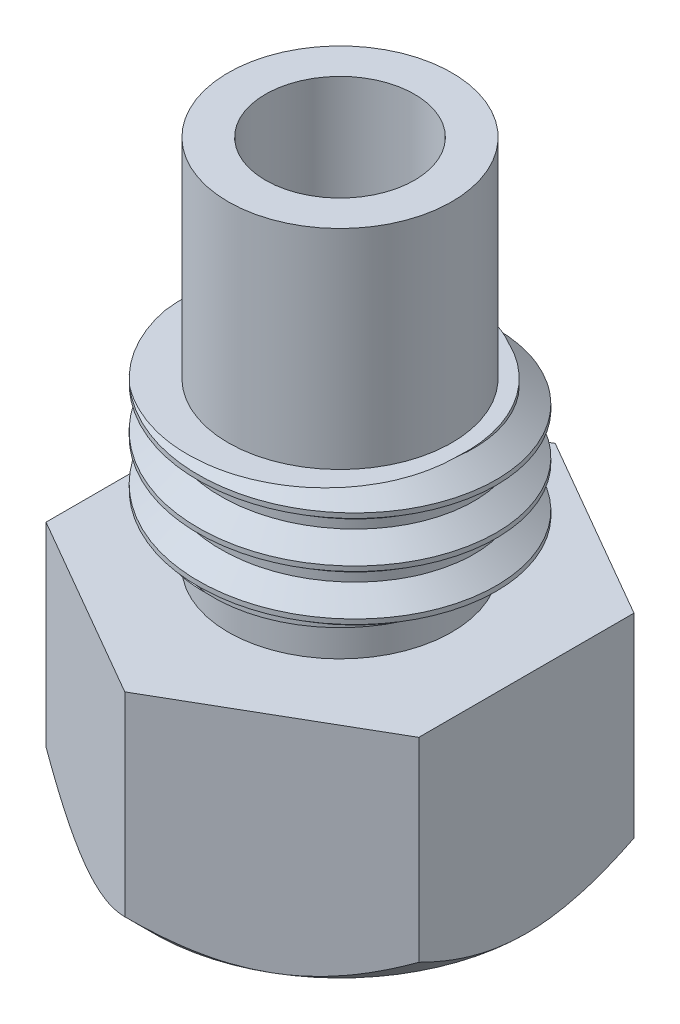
ISO-10303-21;
HEADER;
FILE_DESCRIPTION(('STEP AP214'),'2;1');
FILE_NAME('part.step','',(''),(''),'','','');
FILE_SCHEMA(('AUTOMOTIVE_DESIGN { 1 0 10303 214 1 1 1 1 }'));
ENDSEC;
DATA;
#1=APPLICATION_CONTEXT('core data for automotive mechanical design processes');
#2=APPLICATION_PROTOCOL_DEFINITION('international standard','automotive_design',2000,#1);
#3=PRODUCT_CONTEXT('',#1,'mechanical');
#4=PRODUCT('Part','Part','',(#3));
#5=PRODUCT_RELATED_PRODUCT_CATEGORY('part','',(#4));
#6=PRODUCT_DEFINITION_FORMATION('','',#4);
#7=PRODUCT_DEFINITION_CONTEXT('part definition',#1,'design');
#8=PRODUCT_DEFINITION('design','',#6,#7);
#9=PRODUCT_DEFINITION_SHAPE('','',#8);
#10=(LENGTH_UNIT() NAMED_UNIT(*) SI_UNIT(.MILLI.,.METRE.));
#11=(NAMED_UNIT(*) PLANE_ANGLE_UNIT() SI_UNIT($,.RADIAN.));
#12=(NAMED_UNIT(*) SI_UNIT($,.STERADIAN.) SOLID_ANGLE_UNIT());
#13=UNCERTAINTY_MEASURE_WITH_UNIT(LENGTH_MEASURE(1.E-05),#10,'distance_accuracy_value','');
#14=(GEOMETRIC_REPRESENTATION_CONTEXT(3) GLOBAL_UNCERTAINTY_ASSIGNED_CONTEXT((#13)) GLOBAL_UNIT_ASSIGNED_CONTEXT((#10,
#11,#12)) REPRESENTATION_CONTEXT('',''));
#15=CARTESIAN_POINT('',(0.,0.,0.));
#16=DIRECTION('',(0.,0.,1.));
#17=DIRECTION('',(1.,0.,0.));
#18=AXIS2_PLACEMENT_3D('',#15,#16,#17);
#19=CARTESIAN_POINT('',(-4.76249981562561E-06,7.5692,5.39749999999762));
#20=CARTESIAN_POINT('',(-1.75375882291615,7.66699,5.39749845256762));
#21=CARTESIAN_POINT('',(-3.17257475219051,7.76478,4.3666664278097));
#22=CARTESIAN_POINT('',(-4.59139068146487,7.86257,3.33583440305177));
#23=CARTESIAN_POINT('',(-5.1333290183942,7.96036,1.66791469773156));
#24=CARTESIAN_POINT('',(-5.67526735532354,8.05815,-5.00758864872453E-06));
#25=CARTESIAN_POINT('',(-5.13332607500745,8.15594,-1.66792375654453));
#26=CARTESIAN_POINT('',(-4.59138479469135,8.25373,-3.3358425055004));
#27=CARTESIAN_POINT('',(-3.17256704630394,8.35152,-4.36667202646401));
#28=CARTESIAN_POINT('',(-1.75374929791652,8.44931,-5.39750154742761));
#29=CARTESIAN_POINT('',(4.76249981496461E-06,8.5471,-5.39749999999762));
#30=CARTESIAN_POINT('',(1.75375882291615,8.64489,-5.39749845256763));
#31=CARTESIAN_POINT('',(3.17257475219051,8.74268,-4.3666664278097));
#32=CARTESIAN_POINT('',(4.59139068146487,8.84047,-3.33583440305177));
#33=CARTESIAN_POINT('',(5.1333290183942,8.93826,-1.66791469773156));
#34=CARTESIAN_POINT('',(5.67526735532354,9.03605,5.00758864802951E-06));
#35=CARTESIAN_POINT('',(5.13332607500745,9.13384,1.66792375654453));
#36=CARTESIAN_POINT('',(4.59138479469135,9.23163,3.3358425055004));
#37=CARTESIAN_POINT('',(3.17256704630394,9.32942,4.36667202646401));
#38=CARTESIAN_POINT('',(1.75374929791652,9.42721,5.39750154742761));
#39=CARTESIAN_POINT('',(-4.76249981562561E-06,9.525,5.39749999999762));
#40=CARTESIAN_POINT('',(-1.75375882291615,9.62278999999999,5.39749845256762));
#41=CARTESIAN_POINT('',(-3.17257475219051,9.72058,4.3666664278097));
#42=CARTESIAN_POINT('',(-4.59139068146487,9.81837,3.33583440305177));
#43=CARTESIAN_POINT('',(-5.1333290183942,9.91616,1.66791469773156));
#44=CARTESIAN_POINT('',(-5.67526735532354,10.01395,-5.00758864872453E-06));
#45=CARTESIAN_POINT('',(-5.13332607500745,10.11174,-1.66792375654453));
#46=CARTESIAN_POINT('',(-4.59138479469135,10.20953,-3.3358425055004));
#47=CARTESIAN_POINT('',(-3.17256704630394,10.30732,-4.36667202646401));
#48=CARTESIAN_POINT('',(-1.75374929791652,10.40511,-5.39750154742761));
#49=CARTESIAN_POINT('',(4.76249981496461E-06,10.5029,-5.39749999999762));
#50=CARTESIAN_POINT('',(1.75375882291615,10.60069,-5.39749845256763));
#51=CARTESIAN_POINT('',(3.17257475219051,10.69848,-4.3666664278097));
#52=CARTESIAN_POINT('',(4.59139068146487,10.79627,-3.33583440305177));
#53=CARTESIAN_POINT('',(5.1333290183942,10.89406,-1.66791469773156));
#54=CARTESIAN_POINT('',(5.67526735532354,10.99185,5.00758864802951E-06));
#55=CARTESIAN_POINT('',(5.13332607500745,11.08964,1.66792375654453));
#56=CARTESIAN_POINT('',(4.59138479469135,11.18743,3.3358425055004));
#57=CARTESIAN_POINT('',(3.17256704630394,11.28522,4.36667202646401));
#58=CARTESIAN_POINT('',(1.75374929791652,11.38301,5.39750154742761));
#59=CARTESIAN_POINT('',(-4.76249981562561E-06,11.4808,5.39749999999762));
#60=CARTESIAN_POINT('',(-1.75375882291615,11.57859,5.39749845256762));
#61=CARTESIAN_POINT('',(-3.17257475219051,11.67638,4.3666664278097));
#62=CARTESIAN_POINT('',(-4.59139068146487,11.77417,3.33583440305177));
#63=CARTESIAN_POINT('',(-5.1333290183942,11.87196,1.66791469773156));
#64=CARTESIAN_POINT('',(-5.67526735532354,11.96975,-5.00758864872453E-06));
#65=CARTESIAN_POINT('',(-5.13332607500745,12.06754,-1.66792375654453));
#66=CARTESIAN_POINT('',(-4.59138479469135,12.16533,-3.3358425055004));
#67=CARTESIAN_POINT('',(-3.17256704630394,12.26312,-4.36667202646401));
#68=CARTESIAN_POINT('',(-1.75374929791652,12.36091,-5.39750154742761));
#69=CARTESIAN_POINT('',(4.76249981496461E-06,12.4587,-5.39749999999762));
#70=CARTESIAN_POINT('',(1.75375882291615,12.55649,-5.39749845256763));
#71=CARTESIAN_POINT('',(3.17257475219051,12.65428,-4.3666664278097));
#72=CARTESIAN_POINT('',(4.59139068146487,12.75207,-3.33583440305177));
#73=CARTESIAN_POINT('',(5.1333290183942,12.84986,-1.66791469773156));
#74=CARTESIAN_POINT('',(5.67526735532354,12.94765,5.00758864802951E-06));
#75=CARTESIAN_POINT('',(5.13332607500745,13.04544,1.66792375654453));
#76=CARTESIAN_POINT('',(4.59138479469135,13.14323,3.3358425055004));
#77=CARTESIAN_POINT('',(3.17256704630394,13.24102,4.36667202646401));
#78=CARTESIAN_POINT('',(1.75374929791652,13.33881,5.39750154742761));
#79=CARTESIAN_POINT('',(-4.76249981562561E-06,13.4366,5.39749999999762));
#80=CARTESIAN_POINT('',(-1.75375882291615,13.53439,5.39749845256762));
#81=CARTESIAN_POINT('',(-3.17257475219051,13.63218,4.3666664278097));
#82=CARTESIAN_POINT('',(-4.59139068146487,13.72997,3.33583440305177));
#83=CARTESIAN_POINT('',(-5.1333290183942,13.82776,1.66791469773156));
#84=CARTESIAN_POINT('',(-5.67526735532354,13.92555,-5.00758864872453E-06));
#85=CARTESIAN_POINT('',(-5.13332607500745,14.02334,-1.66792375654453));
#86=CARTESIAN_POINT('',(-4.59138479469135,14.12113,-3.3358425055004));
#87=CARTESIAN_POINT('',(-3.17256704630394,14.21892,-4.36667202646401));
#88=CARTESIAN_POINT('',(-1.75374929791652,14.31671,-5.39750154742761));
#89=CARTESIAN_POINT('',(4.76249981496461E-06,14.4145,-5.39749999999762));
#90=CARTESIAN_POINT('',(1.75375882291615,14.51229,-5.39749845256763));
#91=CARTESIAN_POINT('',(3.17257475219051,14.61008,-4.3666664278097));
#92=CARTESIAN_POINT('',(4.59139068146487,14.70787,-3.33583440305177));
#93=CARTESIAN_POINT('',(5.1333290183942,14.80566,-1.66791469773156));
#94=CARTESIAN_POINT('',(5.67526735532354,14.90345,5.00758864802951E-06));
#95=CARTESIAN_POINT('',(5.13332607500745,15.00124,1.66792375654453));
#96=CARTESIAN_POINT('',(4.59138479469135,15.09903,3.3358425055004));
#97=CARTESIAN_POINT('',(3.17256704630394,15.19682,4.36667202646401));
#98=CARTESIAN_POINT('',(1.75374929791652,15.29461,5.39750154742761));
#99=CARTESIAN_POINT('',(-4.76249981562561E-06,15.3924,5.39749999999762));
#100=CARTESIAN_POINT('',(-1.75375882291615,15.49019,5.39749845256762));
#101=CARTESIAN_POINT('',(-3.17257475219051,15.58798,4.3666664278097));
#102=CARTESIAN_POINT('',(-4.59139068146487,15.68577,3.33583440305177));
#103=CARTESIAN_POINT('',(-5.1333290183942,15.78356,1.66791469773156));
#104=CARTESIAN_POINT('',(-5.67526735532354,15.88135,-5.00758864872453E-06));
#105=CARTESIAN_POINT('',(-5.13332607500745,15.97914,-1.66792375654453));
#106=CARTESIAN_POINT('',(-4.59138479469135,16.07693,-3.3358425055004));
#107=CARTESIAN_POINT('',(-3.17256704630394,16.17472,-4.36667202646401));
#108=CARTESIAN_POINT('',(-1.75374929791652,16.27251,-5.39750154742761));
#109=CARTESIAN_POINT('',(4.76249981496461E-06,16.3703,-5.39749999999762));
#110=CARTESIAN_POINT('',(1.75375882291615,16.46809,-5.39749845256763));
#111=CARTESIAN_POINT('',(3.17257475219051,16.56588,-4.3666664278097));
#112=CARTESIAN_POINT('',(4.59139068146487,16.66367,-3.33583440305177));
#113=CARTESIAN_POINT('',(5.1333290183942,16.76146,-1.66791469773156));
#114=CARTESIAN_POINT('',(5.67526735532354,16.85925,5.00758864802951E-06));
#115=CARTESIAN_POINT('',(5.13332607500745,16.95704,1.66792375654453));
#116=CARTESIAN_POINT('',(4.59138479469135,17.05483,3.3358425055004));
#117=CARTESIAN_POINT('',(3.17256704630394,17.15262,4.36667202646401));
#118=CARTESIAN_POINT('',(1.75374929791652,17.25041,5.39750154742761));
#119=CARTESIAN_POINT('',(-4.76249981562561E-06,17.3482,5.39749999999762));
#120=CARTESIAN_POINT('',(-4.76265924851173E-06,8.25809095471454,6.34999999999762));
#121=CARTESIAN_POINT('',(-2.06324483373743,8.35588095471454,6.34999845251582));
#122=CARTESIAN_POINT('',(-3.73244020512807,8.45367095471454,5.13725511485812));
#123=CARTESIAN_POINT('',(-5.40163557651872,8.55146095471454,3.92451177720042));
#124=CARTESIAN_POINT('',(-6.03921035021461,8.64925095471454,1.96225338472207));
#125=CARTESIAN_POINT('',(-6.67678512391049,8.74704095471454,-5.00775628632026E-06));
#126=CARTESIAN_POINT('',(-6.03920740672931,8.84483095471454,-1.96226244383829));
#127=CARTESIAN_POINT('',(-5.40162968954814,8.94262095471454,-3.9245198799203));
#128=CARTESIAN_POINT('',(-3.73243249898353,9.04041095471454,-5.13726071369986));
#129=CARTESIAN_POINT('',(-2.06323530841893,9.13820095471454,-6.35000154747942));
#130=CARTESIAN_POINT('',(4.76265924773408E-06,9.23599095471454,-6.34999999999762));
#131=CARTESIAN_POINT('',(2.06324483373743,9.33378095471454,-6.34999845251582));
#132=CARTESIAN_POINT('',(3.73244020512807,9.43157095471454,-5.13725511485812));
#133=CARTESIAN_POINT('',(5.40163557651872,9.52936095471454,-3.92451177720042));
#134=CARTESIAN_POINT('',(6.03921035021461,9.62715095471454,-1.96225338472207));
#135=CARTESIAN_POINT('',(6.67678512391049,9.72494095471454,5.00775628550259E-06));
#136=CARTESIAN_POINT('',(6.03920740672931,9.82273095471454,1.96226244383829));
#137=CARTESIAN_POINT('',(5.40162968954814,9.92052095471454,3.9245198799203));
#138=CARTESIAN_POINT('',(3.73243249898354,10.0183109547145,5.13726071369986));
#139=CARTESIAN_POINT('',(2.06323530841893,10.1161009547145,6.35000154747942));
#140=CARTESIAN_POINT('',(-4.76265924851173E-06,10.2138909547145,6.34999999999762));
#141=CARTESIAN_POINT('',(-2.06324483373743,10.3116809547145,6.34999845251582));
#142=CARTESIAN_POINT('',(-3.73244020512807,10.4094709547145,5.13725511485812));
#143=CARTESIAN_POINT('',(-5.40163557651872,10.5072609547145,3.92451177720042));
#144=CARTESIAN_POINT('',(-6.03921035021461,10.6050509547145,1.96225338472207));
#145=CARTESIAN_POINT('',(-6.67678512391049,10.7028409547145,-5.00775628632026E-06));
#146=CARTESIAN_POINT('',(-6.03920740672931,10.8006309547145,-1.96226244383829));
#147=CARTESIAN_POINT('',(-5.40162968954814,10.8984209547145,-3.9245198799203));
#148=CARTESIAN_POINT('',(-3.73243249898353,10.9962109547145,-5.13726071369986));
#149=CARTESIAN_POINT('',(-2.06323530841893,11.0940009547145,-6.35000154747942));
#150=CARTESIAN_POINT('',(4.76265924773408E-06,11.1917909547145,-6.34999999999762));
#151=CARTESIAN_POINT('',(2.06324483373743,11.2895809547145,-6.34999845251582));
#152=CARTESIAN_POINT('',(3.73244020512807,11.3873709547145,-5.13725511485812));
#153=CARTESIAN_POINT('',(5.40163557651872,11.4851609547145,-3.92451177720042));
#154=CARTESIAN_POINT('',(6.03921035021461,11.5829509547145,-1.96225338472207));
#155=CARTESIAN_POINT('',(6.67678512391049,11.6807409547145,5.00775628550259E-06));
#156=CARTESIAN_POINT('',(6.03920740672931,11.7785309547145,1.96226244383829));
#157=CARTESIAN_POINT('',(5.40162968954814,11.8763209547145,3.9245198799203));
#158=CARTESIAN_POINT('',(3.73243249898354,11.9741109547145,5.13726071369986));
#159=CARTESIAN_POINT('',(2.06323530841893,12.0719009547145,6.35000154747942));
#160=CARTESIAN_POINT('',(-4.76265924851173E-06,12.1696909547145,6.34999999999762));
#161=CARTESIAN_POINT('',(-2.06324483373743,12.2674809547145,6.34999845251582));
#162=CARTESIAN_POINT('',(-3.73244020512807,12.3652709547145,5.13725511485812));
#163=CARTESIAN_POINT('',(-5.40163557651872,12.4630609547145,3.92451177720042));
#164=CARTESIAN_POINT('',(-6.03921035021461,12.5608509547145,1.96225338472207));
#165=CARTESIAN_POINT('',(-6.67678512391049,12.6586409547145,-5.00775628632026E-06));
#166=CARTESIAN_POINT('',(-6.03920740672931,12.7564309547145,-1.96226244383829));
#167=CARTESIAN_POINT('',(-5.40162968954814,12.8542209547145,-3.9245198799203));
#168=CARTESIAN_POINT('',(-3.73243249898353,12.9520109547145,-5.13726071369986));
#169=CARTESIAN_POINT('',(-2.06323530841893,13.0498009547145,-6.35000154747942));
#170=CARTESIAN_POINT('',(4.76265924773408E-06,13.1475909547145,-6.34999999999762));
#171=CARTESIAN_POINT('',(2.06324483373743,13.2453809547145,-6.34999845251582));
#172=CARTESIAN_POINT('',(3.73244020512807,13.3431709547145,-5.13725511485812));
#173=CARTESIAN_POINT('',(5.40163557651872,13.4409609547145,-3.92451177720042));
#174=CARTESIAN_POINT('',(6.03921035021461,13.5387509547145,-1.96225338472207));
#175=CARTESIAN_POINT('',(6.67678512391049,13.6365409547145,5.00775628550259E-06));
#176=CARTESIAN_POINT('',(6.03920740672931,13.7343309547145,1.96226244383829));
#177=CARTESIAN_POINT('',(5.40162968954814,13.8321209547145,3.9245198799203));
#178=CARTESIAN_POINT('',(3.73243249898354,13.9299109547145,5.13726071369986));
#179=CARTESIAN_POINT('',(2.06323530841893,14.0277009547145,6.35000154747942));
#180=CARTESIAN_POINT('',(-4.76265924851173E-06,14.1254909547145,6.34999999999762));
#181=CARTESIAN_POINT('',(-2.06324483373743,14.2232809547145,6.34999845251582));
#182=CARTESIAN_POINT('',(-3.73244020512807,14.3210709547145,5.13725511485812));
#183=CARTESIAN_POINT('',(-5.40163557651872,14.4188609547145,3.92451177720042));
#184=CARTESIAN_POINT('',(-6.03921035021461,14.5166509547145,1.96225338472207));
#185=CARTESIAN_POINT('',(-6.67678512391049,14.6144409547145,-5.00775628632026E-06));
#186=CARTESIAN_POINT('',(-6.03920740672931,14.7122309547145,-1.96226244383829));
#187=CARTESIAN_POINT('',(-5.40162968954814,14.8100209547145,-3.9245198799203));
#188=CARTESIAN_POINT('',(-3.73243249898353,14.9078109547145,-5.13726071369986));
#189=CARTESIAN_POINT('',(-2.06323530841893,15.0056009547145,-6.35000154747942));
#190=CARTESIAN_POINT('',(4.76265924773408E-06,15.1033909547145,-6.34999999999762));
#191=CARTESIAN_POINT('',(2.06324483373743,15.2011809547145,-6.34999845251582));
#192=CARTESIAN_POINT('',(3.73244020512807,15.2989709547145,-5.13725511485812));
#193=CARTESIAN_POINT('',(5.40163557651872,15.3967609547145,-3.92451177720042));
#194=CARTESIAN_POINT('',(6.03921035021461,15.4945509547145,-1.96225338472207));
#195=CARTESIAN_POINT('',(6.67678512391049,15.5923409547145,5.00775628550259E-06));
#196=CARTESIAN_POINT('',(6.03920740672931,15.6901309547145,1.96226244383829));
#197=CARTESIAN_POINT('',(5.40162968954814,15.7879209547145,3.9245198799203));
#198=CARTESIAN_POINT('',(3.73243249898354,15.8857109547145,5.13726071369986));
#199=CARTESIAN_POINT('',(2.06323530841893,15.9835009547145,6.35000154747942));
#200=CARTESIAN_POINT('',(-4.76265924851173E-06,16.0812909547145,6.34999999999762));
#201=CARTESIAN_POINT('',(-2.06324483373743,16.1790809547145,6.34999845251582));
#202=CARTESIAN_POINT('',(-3.73244020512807,16.2768709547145,5.13725511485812));
#203=CARTESIAN_POINT('',(-5.40163557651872,16.3746609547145,3.92451177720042));
#204=CARTESIAN_POINT('',(-6.03921035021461,16.4724509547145,1.96225338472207));
#205=CARTESIAN_POINT('',(-6.67678512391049,16.5702409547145,-5.00775628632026E-06));
#206=CARTESIAN_POINT('',(-6.03920740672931,16.6680309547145,-1.96226244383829));
#207=CARTESIAN_POINT('',(-5.40162968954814,16.7658209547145,-3.9245198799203));
#208=CARTESIAN_POINT('',(-3.73243249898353,16.8636109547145,-5.13726071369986));
#209=CARTESIAN_POINT('',(-2.06323530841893,16.9614009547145,-6.35000154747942));
#210=CARTESIAN_POINT('',(4.76265924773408E-06,17.0591909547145,-6.34999999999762));
#211=CARTESIAN_POINT('',(2.06324483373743,17.1569809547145,-6.34999845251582));
#212=CARTESIAN_POINT('',(3.73244020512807,17.2547709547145,-5.13725511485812));
#213=CARTESIAN_POINT('',(5.40163557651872,17.3525609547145,-3.92451177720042));
#214=CARTESIAN_POINT('',(6.03921035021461,17.4503509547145,-1.96225338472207));
#215=CARTESIAN_POINT('',(6.67678512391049,17.5481409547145,5.00775628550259E-06));
#216=CARTESIAN_POINT('',(6.03920740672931,17.6459309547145,1.96226244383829));
#217=CARTESIAN_POINT('',(5.40162968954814,17.7437209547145,3.9245198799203));
#218=CARTESIAN_POINT('',(3.73243249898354,17.8415109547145,5.13726071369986));
#219=CARTESIAN_POINT('',(2.06323530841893,17.9393009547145,6.35000154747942));
#220=CARTESIAN_POINT('',(-4.76265924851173E-06,18.0370909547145,6.34999999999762));
#221=(BOUNDED_SURFACE() B_SPLINE_SURFACE(1,2,((#19,#20,#21,#22,#23,#24,#25,#26,#27,#28,#29,#30,
#31,#32,#33,#34,#35,#36,#37,#38,#39,#40,#41,#42,#43,#44,#45,#46,#47,#48,#49,#50,#51,#52,#53,#54,
#55,#56,#57,#58,#59,#60,#61,#62,#63,#64,#65,#66,#67,#68,#69,#70,#71,#72,#73,#74,#75,#76,#77,#78,
#79,#80,#81,#82,#83,#84,#85,#86,#87,#88,#89,#90,#91,#92,#93,#94,#95,#96,#97,#98,#99,#100,#101,
#102,#103,#104,#105,#106,#107,#108,#109,#110,#111,#112,#113,#114,#115,#116,#117,#118,#119),
(#120,#121,#122,#123,#124,#125,#126,#127,#128,#129,#130,#131,#132,#133,#134,#135,#136,#137,#138,
#139,#140,#141,#142,#143,#144,#145,#146,#147,#148,#149,#150,#151,#152,#153,#154,#155,#156,#157,
#158,#159,#160,#161,#162,#163,#164,#165,#166,#167,#168,#169,#170,#171,#172,#173,#174,#175,#176,
#177,#178,#179,#180,#181,#182,#183,#184,#185,#186,#187,#188,#189,#190,#191,#192,#193,#194,#195,
#196,#197,#198,#199,#200,#201,#202,#203,#204,#205,#206,#207,#208,#209,#210,#211,#212,#213,#214,
#215,#216,#217,#218,#219,#220)),.UNSPECIFIED.,.F.,.F.,.F.) B_SPLINE_SURFACE_WITH_KNOTS((2,2),(3,
2,2,2,2,2,2,2,2,2,2,2,2,2,2,2,2,2,2,2,2,2,2,2,2,2,2,2,2,2,2,2,2,2,2,2,2,2,2,2,2,2,2,2,2,2,2,2,2,
2,3),(0.,1.),(0.,0.02,0.04,0.06,0.08,0.1,0.12,0.14,0.16,0.18,0.2,0.22,0.24,0.26,0.28,0.3,0.32,
0.34,0.36,0.38,0.4,0.42,0.44,0.46,0.48,0.5,0.52,0.54,0.56,0.58,0.6,0.62,0.64,0.66,0.68,0.7,0.72,
0.74,0.76,0.78,0.8,0.82,0.84,0.86,0.88,0.9,0.92,0.94,0.96,0.98,1.),
.UNSPECIFIED.) GEOMETRIC_REPRESENTATION_ITEM() RATIONAL_B_SPLINE_SURFACE(((1.,0.951056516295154,
1.,0.951056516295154,1.,0.951056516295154,1.,0.951056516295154,1.,0.951056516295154,1.,
0.951056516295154,1.,0.951056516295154,1.,0.951056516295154,1.,0.951056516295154,1.,
0.951056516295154,1.,0.951056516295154,1.,0.951056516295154,1.,0.951056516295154,1.,
0.951056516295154,1.,0.951056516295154,1.,0.951056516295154,1.,0.951056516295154,1.,
0.951056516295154,1.,0.951056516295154,1.,0.951056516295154,1.,0.951056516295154,1.,
0.951056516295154,1.,0.951056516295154,1.,0.951056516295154,1.,0.951056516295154,1.,
0.951056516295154,1.,0.951056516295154,1.,0.951056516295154,1.,0.951056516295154,1.,
0.951056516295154,1.,0.951056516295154,1.,0.951056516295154,1.,0.951056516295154,1.,
0.951056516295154,1.,0.951056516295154,1.,0.951056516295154,1.,0.951056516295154,1.,
0.951056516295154,1.,0.951056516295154,1.,0.951056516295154,1.,0.951056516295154,1.,
0.951056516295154,1.,0.951056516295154,1.,0.951056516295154,1.,0.951056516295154,1.,
0.951056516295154,1.,0.951056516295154,1.,0.951056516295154,1.,0.951056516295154,1.,
0.951056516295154,1.),(1.,0.951056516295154,1.,0.951056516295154,1.,0.951056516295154,1.,
0.951056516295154,1.,0.951056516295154,1.,0.951056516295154,1.,0.951056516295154,1.,
0.951056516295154,1.,0.951056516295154,1.,0.951056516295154,1.,0.951056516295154,1.,
0.951056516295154,1.,0.951056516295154,1.,0.951056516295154,1.,0.951056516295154,1.,
0.951056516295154,1.,0.951056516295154,1.,0.951056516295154,1.,0.951056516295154,1.,
0.951056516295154,1.,0.951056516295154,1.,0.951056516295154,1.,0.951056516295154,1.,
0.951056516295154,1.,0.951056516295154,1.,0.951056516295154,1.,0.951056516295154,1.,
0.951056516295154,1.,0.951056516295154,1.,0.951056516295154,1.,0.951056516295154,1.,
0.951056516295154,1.,0.951056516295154,1.,0.951056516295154,1.,0.951056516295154,1.,
0.951056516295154,1.,0.951056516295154,1.,0.951056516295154,1.,0.951056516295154,1.,
0.951056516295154,1.,0.951056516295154,1.,0.951056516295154,1.,0.951056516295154,1.,
0.951056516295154,1.,0.951056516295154,1.,0.951056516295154,1.,0.951056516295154,1.,
0.951056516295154,1.,0.951056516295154,1.,0.951056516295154,1.))) REPRESENTATION_ITEM('') SURFACE());
#222=CARTESIAN_POINT('',(-1.35729296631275,11.1252,-6.20324558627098));
#223=CARTESIAN_POINT('',(-1.17975764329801,11.1252,-6.22956294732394));
#224=CARTESIAN_POINT('',(-1.001071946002,11.1252,-6.24832201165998));
#225=CARTESIAN_POINT('',(-0.642877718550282,11.1252,-6.27071820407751));
#226=CARTESIAN_POINT('',(-0.463369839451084,11.1252,-6.27436573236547));
#227=CARTESIAN_POINT('',(-0.194389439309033,11.1252,-6.26851821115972));
#228=CARTESIAN_POINT('',(-0.10476434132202,11.1252,-6.26468130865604));
#229=CARTESIAN_POINT('',(0.0742287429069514,11.1252,-6.2531681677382));
#230=CARTESIAN_POINT('',(0.163596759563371,11.1252,-6.24549240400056));
#231=CARTESIAN_POINT('',(0.431038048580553,11.1252,-6.21654923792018));
#232=CARTESIAN_POINT('',(0.608507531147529,11.1252,-6.18936481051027));
#233=CARTESIAN_POINT('',(0.960675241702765,11.1252,-6.11945045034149));
#234=CARTESIAN_POINT('',(1.13536765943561,11.1252,-6.07669150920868));
#235=CARTESIAN_POINT('',(1.48032264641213,11.1252,-5.97593452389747));
#236=CARTESIAN_POINT('',(1.65058489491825,11.1252,-5.91793537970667));
#237=CARTESIAN_POINT('',(1.9852875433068,11.1252,-5.78717262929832));
#238=CARTESIAN_POINT('',(2.14972951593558,11.1252,-5.71441304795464));
#239=CARTESIAN_POINT('',(2.47155636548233,11.1252,-5.5546863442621));
#240=CARTESIAN_POINT('',(2.62894130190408,11.1252,-5.46771934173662));
#241=CARTESIAN_POINT('',(2.92881776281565,11.1252,-5.28430202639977));
#242=CARTESIAN_POINT('',(3.07165904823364,11.1252,-5.18842479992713));
#243=CARTESIAN_POINT('',(3.27943528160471,11.1252,-5.0358579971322));
#244=CARTESIAN_POINT('',(3.34761812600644,11.1252,-4.98353949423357));
#245=CARTESIAN_POINT('',(3.48172713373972,11.1252,-4.87608707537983));
#246=CARTESIAN_POINT('',(3.54765334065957,11.1252,-4.82095321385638));
#247=CARTESIAN_POINT('',(3.74164383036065,11.1252,-4.65128653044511));
#248=CARTESIAN_POINT('',(3.86598450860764,11.1252,-4.53244153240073));
#249=CARTESIAN_POINT('',(4.10369294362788,11.1252,-4.28427565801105));
#250=CARTESIAN_POINT('',(4.21706070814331,11.1252,-4.15495478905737));
#251=CARTESIAN_POINT('',(4.42932160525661,11.1252,-3.89009978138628));
#252=CARTESIAN_POINT('',(4.52850113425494,11.1252,-3.75479523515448));
#253=CARTESIAN_POINT('',(4.71484840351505,11.1252,-3.47615652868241));
#254=CARTESIAN_POINT('',(4.80201643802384,11.1252,-3.33282256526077));
#255=CARTESIAN_POINT('',(4.96370883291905,11.1252,-3.03916220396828));
#256=CARTESIAN_POINT('',(5.03823068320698,11.1252,-2.88883442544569));
#257=CARTESIAN_POINT('',(5.1740726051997,11.1252,-2.58229150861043));
#258=CARTESIAN_POINT('',(5.23539193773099,11.1252,-2.42607604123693));
#259=CARTESIAN_POINT('',(5.31655700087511,11.1252,-2.18985250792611));
#260=CARTESIAN_POINT('',(5.34160864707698,11.1252,-2.11159635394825));
#261=CARTESIAN_POINT('',(5.38840065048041,11.1252,-1.95409940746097));
#262=CARTESIAN_POINT('',(5.41014119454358,11.1252,-1.87485867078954));
#263=CARTESIAN_POINT('',(5.45020588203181,11.1252,-1.71552902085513));
#264=CARTESIAN_POINT('',(5.46853055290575,11.1252,-1.63544024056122));
#265=CARTESIAN_POINT('',(5.50159567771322,11.1252,-1.47451614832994));
#266=CARTESIAN_POINT('',(5.51633548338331,11.1252,-1.39368070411));
#267=CARTESIAN_POINT('',(5.55516277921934,11.1252,-1.15037980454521));
#268=CARTESIAN_POINT('',(5.57388243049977,11.1252,-0.987023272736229));
#269=CARTESIAN_POINT('',(5.59680184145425,11.1252,-0.659283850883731));
#270=CARTESIAN_POINT('',(5.60099870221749,11.1252,-0.494900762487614));
#271=CARTESIAN_POINT('',(5.59494630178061,11.1252,-0.171941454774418));
#272=CARTESIAN_POINT('',(5.58517900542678,11.1252,-0.0133561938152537));
#273=CARTESIAN_POINT('',(5.5521312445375,11.1252,0.302318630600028));
#274=CARTESIAN_POINT('',(5.52885776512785,11.1252,0.459408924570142));
#275=CARTESIAN_POINT('',(5.46900419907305,11.1252,0.770914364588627));
#276=CARTESIAN_POINT('',(5.43243336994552,11.1252,0.925331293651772));
#277=CARTESIAN_POINT('',(5.3462323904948,11.1252,1.23043561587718));
#278=CARTESIAN_POINT('',(5.2966073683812,11.1252,1.38112444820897));
#279=CARTESIAN_POINT('',(5.21722775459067,11.1252,1.59163717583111));
#280=CARTESIAN_POINT('',(5.19264929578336,11.1252,1.65345514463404));
#281=CARTESIAN_POINT('',(5.14121646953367,11.1252,1.77612272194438));
#282=CARTESIAN_POINT('',(5.11436274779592,11.1252,1.83697259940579));
#283=CARTESIAN_POINT('',(5.05843140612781,11.1252,1.95749800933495));
#284=CARTESIAN_POINT('',(5.02935816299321,11.1252,2.01717557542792));
#285=CARTESIAN_POINT('',(4.96898029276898,11.1252,2.13541664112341));
#286=CARTESIAN_POINT('',(4.93767491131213,11.1252,2.19397975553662));
#287=CARTESIAN_POINT('',(4.90528215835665,11.1252,2.25193543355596));
#288=B_SPLINE_CURVE_WITH_KNOTS('',3,(#222,#223,#224,#225,#226,#227,#228,#229,#230,#231,#232,
#233,#234,#235,#236,#237,#238,#239,#240,#241,#242,#243,#244,#245,#246,#247,#248,#249,#250,#251,
#252,#253,#254,#255,#256,#257,#258,#259,#260,#261,#262,#263,#264,#265,#266,#267,#268,#269,#270,
#271,#272,#273,#274,#275,#276,#277,#278,#279,#280,#281,#282,#283,#284,#285,#286,#287),
.UNSPECIFIED.,.F.,.F.,(4,2,2,2,2,2,2,2,2,2,2,2,2,2,2,2,2,2,2,2,2,2,2,2,2,2,2,2,2,2,2,2,4),(0.,
0.538329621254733,1.07628868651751,1.34533959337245,1.61435724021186,2.15221620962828,
2.69108213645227,3.22998696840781,3.7687450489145,4.30749858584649,4.82294292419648,
5.08070517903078,5.33846245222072,5.8537382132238,6.36901361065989,6.87167533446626,
7.37432474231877,7.87707380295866,8.37985100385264,8.6262962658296,8.87272761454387,
9.11912087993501,9.36555866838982,9.85813673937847,10.3508131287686,10.8268899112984,
11.3027206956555,11.7782208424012,12.2535344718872,12.4530763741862,12.6525618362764,
12.851663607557,13.0508329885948),.UNSPECIFIED.);
#289=CARTESIAN_POINT('',(-1.35729296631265,11.1252,-6.203245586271));
#290=VERTEX_POINT('',#289);
#291=CARTESIAN_POINT('',(4.90528215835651,11.1252,2.25193543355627));
#292=VERTEX_POINT('',#291);
#293=EDGE_CURVE('E177',#290,#292,#288,.T.);
#294=CARTESIAN_POINT('',(-4.76265924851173E-06,8.25809095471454,6.34999999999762));
#295=CARTESIAN_POINT('',(-2.06324483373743,8.35588095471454,6.34999845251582));
#296=CARTESIAN_POINT('',(-3.73244020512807,8.45367095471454,5.13725511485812));
#297=CARTESIAN_POINT('',(-5.40163557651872,8.55146095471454,3.92451177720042));
#298=CARTESIAN_POINT('',(-6.03921035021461,8.64925095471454,1.96225338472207));
#299=CARTESIAN_POINT('',(-6.67678512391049,8.74704095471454,-5.00775628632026E-06));
#300=CARTESIAN_POINT('',(-6.03920740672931,8.84483095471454,-1.96226244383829));
#301=CARTESIAN_POINT('',(-5.40162968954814,8.94262095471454,-3.9245198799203));
#302=CARTESIAN_POINT('',(-3.73243249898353,9.04041095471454,-5.13726071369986));
#303=CARTESIAN_POINT('',(-2.06323530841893,9.13820095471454,-6.35000154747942));
#304=CARTESIAN_POINT('',(4.76265924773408E-06,9.23599095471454,-6.34999999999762));
#305=CARTESIAN_POINT('',(2.06324483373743,9.33378095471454,-6.34999845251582));
#306=CARTESIAN_POINT('',(3.73244020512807,9.43157095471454,-5.13725511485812));
#307=CARTESIAN_POINT('',(5.40163557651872,9.52936095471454,-3.92451177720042));
#308=CARTESIAN_POINT('',(6.03921035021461,9.62715095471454,-1.96225338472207));
#309=CARTESIAN_POINT('',(6.67678512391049,9.72494095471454,5.00775628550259E-06));
#310=CARTESIAN_POINT('',(6.03920740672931,9.82273095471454,1.96226244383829));
#311=CARTESIAN_POINT('',(5.40162968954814,9.92052095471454,3.9245198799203));
#312=CARTESIAN_POINT('',(3.73243249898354,10.0183109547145,5.13726071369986));
#313=CARTESIAN_POINT('',(2.06323530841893,10.1161009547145,6.35000154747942));
#314=CARTESIAN_POINT('',(-4.76265924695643E-06,10.2138909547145,6.34999999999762));
#315=CARTESIAN_POINT('',(-2.06324483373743,10.3116809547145,6.34999845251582));
#316=CARTESIAN_POINT('',(-3.73244020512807,10.4094709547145,5.13725511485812));
#317=CARTESIAN_POINT('',(-5.40163557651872,10.5072609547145,3.92451177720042));
#318=CARTESIAN_POINT('',(-6.03921035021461,10.6050509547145,1.96225338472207));
#319=CARTESIAN_POINT('',(-6.67678512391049,10.7028409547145,-5.00775628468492E-06));
#320=CARTESIAN_POINT('',(-6.03920740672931,10.8006309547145,-1.96226244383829));
#321=CARTESIAN_POINT('',(-5.40162968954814,10.8984209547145,-3.9245198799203));
#322=CARTESIAN_POINT('',(-3.73243249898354,10.9962109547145,-5.13726071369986));
#323=CARTESIAN_POINT('',(-2.06323530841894,11.0940009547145,-6.35000154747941));
#324=CARTESIAN_POINT('',(4.76265924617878E-06,11.1917909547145,-6.34999999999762));
#325=CARTESIAN_POINT('',(2.06324483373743,11.2895809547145,-6.34999845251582));
#326=CARTESIAN_POINT('',(3.73244020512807,11.3873709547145,-5.13725511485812));
#327=CARTESIAN_POINT('',(5.40163557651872,11.4851609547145,-3.92451177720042));
#328=CARTESIAN_POINT('',(6.03921035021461,11.5829509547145,-1.96225338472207));
#329=CARTESIAN_POINT('',(6.67678512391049,11.6807409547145,5.00775628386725E-06));
#330=CARTESIAN_POINT('',(6.03920740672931,11.7785309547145,1.96226244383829));
#331=CARTESIAN_POINT('',(5.40162968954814,11.8763209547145,3.9245198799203));
#332=CARTESIAN_POINT('',(3.73243249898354,11.9741109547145,5.13726071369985));
#333=CARTESIAN_POINT('',(2.06323530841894,12.0719009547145,6.35000154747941));
#334=CARTESIAN_POINT('',(-4.76265924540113E-06,12.1696909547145,6.34999999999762));
#335=CARTESIAN_POINT('',(-2.06324483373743,12.2674809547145,6.34999845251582));
#336=CARTESIAN_POINT('',(-3.73244020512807,12.3652709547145,5.13725511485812));
#337=CARTESIAN_POINT('',(-5.40163557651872,12.4630609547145,3.92451177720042));
#338=CARTESIAN_POINT('',(-6.03921035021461,12.5608509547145,1.96225338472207));
#339=CARTESIAN_POINT('',(-6.67678512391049,12.6586409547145,-5.00775628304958E-06));
#340=CARTESIAN_POINT('',(-6.03920740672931,12.7564309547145,-1.96226244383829));
#341=CARTESIAN_POINT('',(-5.40162968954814,12.8542209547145,-3.9245198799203));
#342=CARTESIAN_POINT('',(-3.73243249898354,12.9520109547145,-5.13726071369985));
#343=CARTESIAN_POINT('',(-2.06323530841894,13.0498009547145,-6.35000154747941));
#344=CARTESIAN_POINT('',(4.76265924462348E-06,13.1475909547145,-6.34999999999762));
#345=CARTESIAN_POINT('',(2.06324483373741,13.2453809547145,-6.34999845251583));
#346=CARTESIAN_POINT('',(3.73244020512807,13.3431709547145,-5.13725511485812));
#347=CARTESIAN_POINT('',(5.40163557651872,13.4409609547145,-3.92451177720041));
#348=CARTESIAN_POINT('',(6.03921035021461,13.5387509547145,-1.96225338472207));
#349=CARTESIAN_POINT('',(6.67678512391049,13.6365409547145,5.00775627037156E-06));
#350=CARTESIAN_POINT('',(6.03920740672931,13.7343309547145,1.96226244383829));
#351=CARTESIAN_POINT('',(5.40162968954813,13.8321209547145,3.92451987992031));
#352=CARTESIAN_POINT('',(3.73243249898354,13.9299109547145,5.13726071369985));
#353=CARTESIAN_POINT('',(2.06323530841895,14.0277009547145,6.35000154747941));
#354=CARTESIAN_POINT('',(-4.76265924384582E-06,14.1254909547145,6.34999999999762));
#355=CARTESIAN_POINT('',(-2.06324483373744,14.2232809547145,6.34999845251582));
#356=CARTESIAN_POINT('',(-3.73244020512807,14.3210709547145,5.13725511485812));
#357=CARTESIAN_POINT('',(-5.40163557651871,14.4188609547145,3.92451177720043));
#358=CARTESIAN_POINT('',(-6.0392103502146,14.5166509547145,1.96225338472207));
#359=CARTESIAN_POINT('',(-6.67678512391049,14.6144409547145,-5.00775629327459E-06));
#360=CARTESIAN_POINT('',(-6.03920740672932,14.7122309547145,-1.96226244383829));
#361=CARTESIAN_POINT('',(-5.40162968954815,14.8100209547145,-3.92451987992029));
#362=CARTESIAN_POINT('',(-3.73243249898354,14.9078109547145,-5.13726071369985));
#363=CARTESIAN_POINT('',(-2.06323530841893,15.0056009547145,-6.35000154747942));
#364=CARTESIAN_POINT('',(4.76265924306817E-06,15.1033909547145,-6.34999999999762));
#365=CARTESIAN_POINT('',(2.06324483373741,15.2011809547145,-6.34999845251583));
#366=CARTESIAN_POINT('',(3.73244020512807,15.2989709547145,-5.13725511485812));
#367=CARTESIAN_POINT('',(5.40163557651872,15.3967609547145,-3.92451177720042));
#368=CARTESIAN_POINT('',(6.0392103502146,15.4945509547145,-1.96225338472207));
#369=CARTESIAN_POINT('',(6.67678512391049,15.5923409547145,5.00775626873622E-06));
#370=CARTESIAN_POINT('',(6.03920740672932,15.6901309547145,1.96226244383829));
#371=CARTESIAN_POINT('',(5.40162968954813,15.7879209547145,3.9245198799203));
#372=CARTESIAN_POINT('',(3.73243249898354,15.8857109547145,5.13726071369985));
#373=CARTESIAN_POINT('',(2.06323530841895,15.9835009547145,6.35000154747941));
#374=CARTESIAN_POINT('',(-4.76265924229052E-06,16.0812909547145,6.34999999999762));
#375=CARTESIAN_POINT('',(-2.06324483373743,16.1790809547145,6.34999845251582));
#376=CARTESIAN_POINT('',(-3.73244020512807,16.2768709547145,5.13725511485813));
#377=CARTESIAN_POINT('',(-5.40163557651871,16.3746609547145,3.92451177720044));
#378=CARTESIAN_POINT('',(-6.0392103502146,16.4724509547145,1.96225338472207));
#379=CARTESIAN_POINT('',(-6.67678512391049,16.5702409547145,-5.00775629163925E-06));
#380=CARTESIAN_POINT('',(-6.03920740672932,16.6680309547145,-1.96226244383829));
#381=CARTESIAN_POINT('',(-5.40162968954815,16.7658209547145,-3.92451987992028));
#382=CARTESIAN_POINT('',(-3.73243249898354,16.8636109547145,-5.13726071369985));
#383=CARTESIAN_POINT('',(-2.06323530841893,16.9614009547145,-6.35000154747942));
#384=CARTESIAN_POINT('',(4.76265924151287E-06,17.0591909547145,-6.34999999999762));
#385=CARTESIAN_POINT('',(2.06324483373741,17.1569809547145,-6.34999845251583));
#386=CARTESIAN_POINT('',(3.73244020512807,17.2547709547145,-5.13725511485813));
#387=CARTESIAN_POINT('',(5.40163557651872,17.3525609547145,-3.92451177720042));
#388=CARTESIAN_POINT('',(6.0392103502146,17.4503509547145,-1.96225338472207));
#389=CARTESIAN_POINT('',(6.67678512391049,17.5481409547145,5.00775626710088E-06));
#390=CARTESIAN_POINT('',(6.03920740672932,17.6459309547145,1.96226244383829));
#391=CARTESIAN_POINT('',(5.40162968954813,17.7437209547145,3.9245198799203));
#392=CARTESIAN_POINT('',(3.73243249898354,17.8415109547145,5.13726071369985));
#393=CARTESIAN_POINT('',(2.06323530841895,17.9393009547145,6.35000154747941));
#394=CARTESIAN_POINT('',(-4.76265924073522E-06,18.0370909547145,6.34999999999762));
#395=(BOUNDED_CURVE() B_SPLINE_CURVE(2,(#294,#295,#296,#297,#298,#299,#300,#301,#302,#303,#304,
#305,#306,#307,#308,#309,#310,#311,#312,#313,#314,#315,#316,#317,#318,#319,#320,#321,#322,#323,
#324,#325,#326,#327,#328,#329,#330,#331,#332,#333,#334,#335,#336,#337,#338,#339,#340,#341,#342,
#343,#344,#345,#346,#347,#348,#349,#350,#351,#352,#353,#354,#355,#356,#357,#358,#359,#360,#361,
#362,#363,#364,#365,#366,#367,#368,#369,#370,#371,#372,#373,#374,#375,#376,#377,#378,#379,#380,
#381,#382,#383,#384,#385,#386,#387,#388,#389,#390,#391,#392,#393,#394),.UNSPECIFIED.,.F.,
.F.) B_SPLINE_CURVE_WITH_KNOTS((3,2,2,2,2,2,2,2,2,2,2,2,2,2,2,2,2,2,2,2,2,2,2,2,2,2,2,2,2,2,2,2,
2,2,2,2,2,2,2,2,2,2,2,2,2,2,2,2,2,2,3),(0.,0.02,0.04,0.06,0.08,0.1,0.12,0.14,0.16,0.18,0.2,0.22,
0.24,0.26,0.28,0.3,0.32,0.34,0.36,0.38,0.4,0.42,0.44,0.46,0.48,0.5,0.52,0.54,0.56,0.58,0.6,0.62,
0.64,0.66,0.68,0.7,0.72,0.74,0.76,0.78,0.8,0.82,0.84,0.86,0.88,0.9,0.92,0.94,0.96,0.98,1.),
.UNSPECIFIED.) CURVE() GEOMETRIC_REPRESENTATION_ITEM() RATIONAL_B_SPLINE_CURVE((1.,
0.951056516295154,1.,0.951056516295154,1.,0.951056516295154,1.,0.951056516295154,1.,
0.951056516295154,1.,0.951056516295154,1.,0.951056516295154,1.,0.951056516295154,1.,
0.951056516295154,1.,0.951056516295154,1.,0.951056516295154,1.,0.951056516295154,1.,
0.951056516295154,1.,0.951056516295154,1.,0.951056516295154,1.,0.951056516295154,1.,
0.951056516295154,1.,0.951056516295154,1.,0.951056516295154,1.,0.951056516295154,1.,
0.951056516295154,1.,0.951056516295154,1.,0.951056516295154,1.,0.951056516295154,1.,
0.951056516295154,1.,0.951056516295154,1.,0.951056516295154,1.,0.951056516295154,1.,
0.951056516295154,1.,0.951056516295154,1.,0.951056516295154,1.,0.951056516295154,1.,
0.951056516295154,1.,0.951056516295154,1.,0.951056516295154,1.,0.951056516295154,1.,
0.951056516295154,1.,0.951056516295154,1.,0.951056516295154,1.,0.951056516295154,1.,
0.951056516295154,1.,0.951056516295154,1.,0.951056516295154,1.,0.951056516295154,1.,
0.951056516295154,1.,0.951056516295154,1.,0.951056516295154,1.,0.951056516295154,1.,
0.951056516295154,1.,0.951056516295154,1.)) REPRESENTATION_ITEM(''));
#396=CARTESIAN_POINT('',(-6.2338848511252,16.51,1.20879264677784));
#397=VERTEX_POINT('',#396);
#398=EDGE_CURVE('E164',#290,#397,#395,.T.);
#399=CARTESIAN_POINT('',(-6.23388485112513,16.51,1.20879264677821));
#400=CARTESIAN_POINT('',(-6.25563397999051,16.51,1.03443133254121));
#401=CARTESIAN_POINT('',(-6.26999796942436,16.51,0.859153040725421));
#402=CARTESIAN_POINT('',(-6.28393264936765,16.51,0.508031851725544));
#403=CARTESIAN_POINT('',(-6.28350526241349,16.51,0.332189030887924));
#404=CARTESIAN_POINT('',(-6.26783131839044,16.51,-0.0190286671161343));
#405=CARTESIAN_POINT('',(-6.25256864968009,16.51,-0.194402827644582));
#406=CARTESIAN_POINT('',(-6.2073147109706,16.51,-0.543239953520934));
#407=CARTESIAN_POINT('',(-6.17732290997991,16.51,-0.716702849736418));
#408=CARTESIAN_POINT('',(-6.10280145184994,16.51,-1.0605821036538));
#409=CARTESIAN_POINT('',(-6.05826544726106,16.51,-1.2309970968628));
#410=CARTESIAN_POINT('',(-5.98080979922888,16.51,-1.48329762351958));
#411=CARTESIAN_POINT('',(-5.9532124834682,16.51,-1.56685282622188));
#412=CARTESIAN_POINT('',(-5.89453655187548,16.51,-1.73273755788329));
#413=CARTESIAN_POINT('',(-5.86345795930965,16.51,-1.81506709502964));
#414=CARTESIAN_POINT('',(-5.79780115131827,16.51,-1.97824563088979));
#415=CARTESIAN_POINT('',(-5.763225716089,16.51,-2.05909574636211));
#416=CARTESIAN_POINT('',(-5.6905317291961,16.51,-2.2191800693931));
#417=CARTESIAN_POINT('',(-5.65241319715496,16.51,-2.29841428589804));
#418=CARTESIAN_POINT('',(-5.53288387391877,16.51,-2.53347240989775));
#419=CARTESIAN_POINT('',(-5.4462808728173,16.51,-2.68669773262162));
#420=CARTESIAN_POINT('',(-5.26189694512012,16.51,-2.98175255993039));
#421=CARTESIAN_POINT('',(-5.16439047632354,16.51,-3.12375431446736));
#422=CARTESIAN_POINT('',(-4.95749554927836,16.51,-3.39882978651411));
#423=CARTESIAN_POINT('',(-4.84810711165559,16.51,-3.53190351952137));
#424=CARTESIAN_POINT('',(-4.61820785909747,16.51,-3.78818133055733));
#425=CARTESIAN_POINT('',(-4.49769181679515,16.51,-3.91138071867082));
#426=CARTESIAN_POINT('',(-4.24648150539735,16.51,-4.14693125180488));
#427=CARTESIAN_POINT('',(-4.1157867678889,16.51,-4.25928189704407));
#428=CARTESIAN_POINT('',(-3.84817009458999,16.51,-4.46992207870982));
#429=CARTESIAN_POINT('',(-3.71145057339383,16.51,-4.56846821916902));
#430=CARTESIAN_POINT('',(-3.50056849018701,16.51,-4.70739473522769));
#431=CARTESIAN_POINT('',(-3.42930220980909,16.51,-4.75222424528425));
#432=CARTESIAN_POINT('',(-3.28485871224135,16.51,-4.8386916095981));
#433=CARTESIAN_POINT('',(-3.21168151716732,16.51,-4.88032950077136));
#434=CARTESIAN_POINT('',(-2.98958189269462,16.51,-5.00028318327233));
#435=CARTESIAN_POINT('',(-2.8379818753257,16.51,-5.0737112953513));
#436=CARTESIAN_POINT('',(-2.52890699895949,16.51,-5.20689193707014));
#437=CARTESIAN_POINT('',(-2.37143195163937,16.51,-5.26664402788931));
#438=CARTESIAN_POINT('',(-2.05673465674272,16.51,-5.37039399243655));
#439=CARTESIAN_POINT('',(-1.89965347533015,16.51,-5.41481972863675));
#440=CARTESIAN_POINT('',(-1.58226539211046,16.51,-5.49006166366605));
#441=CARTESIAN_POINT('',(-1.42195852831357,16.51,-5.5208780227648));
#442=CARTESIAN_POINT('',(-1.0991809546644,16.51,-5.56869643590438));
#443=CARTESIAN_POINT('',(-0.936708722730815,16.51,-5.58568818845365));
#444=CARTESIAN_POINT('',(-0.610955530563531,16.51,-5.60567910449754));
#445=CARTESIAN_POINT('',(-0.447674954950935,16.51,-5.60868438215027));
#446=CARTESIAN_POINT('',(-0.204160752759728,16.51,-5.60275543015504));
#447=CARTESIAN_POINT('',(-0.123766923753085,16.51,-5.59909916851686));
#448=CARTESIAN_POINT('',(0.0367761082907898,16.51,-5.58835722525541));
#449=CARTESIAN_POINT('',(0.116925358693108,16.51,-5.58127225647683));
#450=CARTESIAN_POINT('',(0.356791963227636,16.51,-5.55466408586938));
#451=CARTESIAN_POINT('',(0.515949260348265,16.51,-5.52978716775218));
#452=CARTESIAN_POINT('',(0.831167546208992,16.51,-5.46610507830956));
#453=CARTESIAN_POINT('',(0.987232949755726,16.51,-5.42732154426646));
#454=CARTESIAN_POINT('',(1.29527418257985,16.51,-5.33610401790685));
#455=CARTESIAN_POINT('',(1.44725150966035,16.51,-5.2836751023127));
#456=CARTESIAN_POINT('',(1.72369364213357,16.51,-5.17438432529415));
#457=CARTESIAN_POINT('',(1.84888380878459,16.51,-5.11934689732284));
#458=CARTESIAN_POINT('',(2.09459610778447,16.51,-5.00009048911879));
#459=CARTESIAN_POINT('',(2.21512449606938,16.51,-4.93588439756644));
#460=CARTESIAN_POINT('',(2.33306840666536,16.51,-4.86721666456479));
#461=B_SPLINE_CURVE_WITH_KNOTS('',3,(#399,#400,#401,#402,#403,#404,#405,#406,#407,#408,#409,
#410,#411,#412,#413,#414,#415,#416,#417,#418,#419,#420,#421,#422,#423,#424,#425,#426,#427,#428,
#429,#430,#431,#432,#433,#434,#435,#436,#437,#438,#439,#440,#441,#442,#443,#444,#445,#446,#447,
#448,#449,#450,#451,#452,#453,#454,#455,#456,#457,#458,#459,#460),.UNSPECIFIED.,.F.,.F.,(4,2,2,
2,2,2,2,2,2,2,2,2,2,2,2,2,2,2,2,2,2,2,2,2,2,2,2,2,2,2,4),(0.,0.52697552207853,1.05388254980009,
1.58136245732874,2.10886138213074,2.63659082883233,2.90051155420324,3.164430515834,
3.42814127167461,3.69185056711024,4.2191211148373,4.7352645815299,5.2514071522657,
5.7677934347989,6.28420349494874,6.7891595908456,7.04167249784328,7.29418248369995,
7.79881005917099,8.30345382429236,8.79258315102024,9.28170671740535,9.77119442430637,
10.2604681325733,10.5018373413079,10.7431563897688,11.2257314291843,11.7075588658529,
12.1892072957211,12.5990913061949,13.0084047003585),.UNSPECIFIED.);
#462=CARTESIAN_POINT('',(2.33306840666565,16.51,-4.86721666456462));
#463=VERTEX_POINT('',#462);
#464=EDGE_CURVE('E423',#397,#463,#461,.T.);
#465=CARTESIAN_POINT('',(-4.76249981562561E-06,7.5692,5.39749999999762));
#466=CARTESIAN_POINT('',(-1.75375882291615,7.66699,5.39749845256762));
#467=CARTESIAN_POINT('',(-3.17257475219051,7.76478,4.3666664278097));
#468=CARTESIAN_POINT('',(-4.59139068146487,7.86257,3.33583440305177));
#469=CARTESIAN_POINT('',(-5.1333290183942,7.96036,1.66791469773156));
#470=CARTESIAN_POINT('',(-5.67526735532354,8.05815,-5.00758864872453E-06));
#471=CARTESIAN_POINT('',(-5.13332607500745,8.15594,-1.66792375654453));
#472=CARTESIAN_POINT('',(-4.59138479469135,8.25373,-3.3358425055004));
#473=CARTESIAN_POINT('',(-3.17256704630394,8.35152,-4.36667202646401));
#474=CARTESIAN_POINT('',(-1.75374929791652,8.44931,-5.39750154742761));
#475=CARTESIAN_POINT('',(4.76249981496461E-06,8.5471,-5.39749999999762));
#476=CARTESIAN_POINT('',(1.75375882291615,8.64489,-5.39749845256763));
#477=CARTESIAN_POINT('',(3.17257475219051,8.74268,-4.3666664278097));
#478=CARTESIAN_POINT('',(4.59139068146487,8.84047,-3.33583440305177));
#479=CARTESIAN_POINT('',(5.1333290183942,8.93826,-1.66791469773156));
#480=CARTESIAN_POINT('',(5.67526735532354,9.03605,5.00758864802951E-06));
#481=CARTESIAN_POINT('',(5.13332607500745,9.13384,1.66792375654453));
#482=CARTESIAN_POINT('',(4.59138479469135,9.23163,3.3358425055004));
#483=CARTESIAN_POINT('',(3.17256704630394,9.32942,4.36667202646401));
#484=CARTESIAN_POINT('',(1.75374929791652,9.42721,5.39750154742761));
#485=CARTESIAN_POINT('',(-4.7624998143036E-06,9.525,5.39749999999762));
#486=CARTESIAN_POINT('',(-1.75375882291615,9.62278999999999,5.39749845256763));
#487=CARTESIAN_POINT('',(-3.17257475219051,9.72058,4.3666664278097));
#488=CARTESIAN_POINT('',(-4.59139068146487,9.81837,3.33583440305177));
#489=CARTESIAN_POINT('',(-5.1333290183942,9.91616,1.66791469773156));
#490=CARTESIAN_POINT('',(-5.67526735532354,10.01395,-5.00758864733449E-06));
#491=CARTESIAN_POINT('',(-5.13332607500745,10.11174,-1.66792375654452));
#492=CARTESIAN_POINT('',(-4.59138479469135,10.20953,-3.3358425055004));
#493=CARTESIAN_POINT('',(-3.17256704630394,10.30732,-4.36667202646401));
#494=CARTESIAN_POINT('',(-1.75374929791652,10.40511,-5.39750154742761));
#495=CARTESIAN_POINT('',(4.7624998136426E-06,10.5029,-5.39749999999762));
#496=CARTESIAN_POINT('',(1.75375882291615,10.60069,-5.39749845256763));
#497=CARTESIAN_POINT('',(3.17257475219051,10.69848,-4.3666664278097));
#498=CARTESIAN_POINT('',(4.59139068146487,10.79627,-3.33583440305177));
#499=CARTESIAN_POINT('',(5.1333290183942,10.89406,-1.66791469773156));
#500=CARTESIAN_POINT('',(5.67526735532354,10.99185,5.00758864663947E-06));
#501=CARTESIAN_POINT('',(5.13332607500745,11.08964,1.66792375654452));
#502=CARTESIAN_POINT('',(4.59138479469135,11.18743,3.3358425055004));
#503=CARTESIAN_POINT('',(3.17256704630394,11.28522,4.366672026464));
#504=CARTESIAN_POINT('',(1.75374929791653,11.38301,5.39750154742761));
#505=CARTESIAN_POINT('',(-4.7624998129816E-06,11.4808,5.39749999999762));
#506=CARTESIAN_POINT('',(-1.75375882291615,11.57859,5.39749845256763));
#507=CARTESIAN_POINT('',(-3.17257475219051,11.67638,4.3666664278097));
#508=CARTESIAN_POINT('',(-4.59139068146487,11.77417,3.33583440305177));
#509=CARTESIAN_POINT('',(-5.1333290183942,11.87196,1.66791469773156));
#510=CARTESIAN_POINT('',(-5.67526735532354,11.96975,-5.00758864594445E-06));
#511=CARTESIAN_POINT('',(-5.13332607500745,12.06754,-1.66792375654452));
#512=CARTESIAN_POINT('',(-4.59138479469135,12.16533,-3.3358425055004));
#513=CARTESIAN_POINT('',(-3.17256704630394,12.26312,-4.366672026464));
#514=CARTESIAN_POINT('',(-1.75374929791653,12.36091,-5.39750154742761));
#515=CARTESIAN_POINT('',(4.76249981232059E-06,12.4587,-5.39749999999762));
#516=CARTESIAN_POINT('',(1.75375882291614,12.55649,-5.39749845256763));
#517=CARTESIAN_POINT('',(3.17257475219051,12.65428,-4.3666664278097));
#518=CARTESIAN_POINT('',(4.59139068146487,12.75207,-3.33583440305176));
#519=CARTESIAN_POINT('',(5.1333290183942,12.84986,-1.66791469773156));
#520=CARTESIAN_POINT('',(5.67526735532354,12.94765,5.00758863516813E-06));
#521=CARTESIAN_POINT('',(5.13332607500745,13.04544,1.66792375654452));
#522=CARTESIAN_POINT('',(4.59138479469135,13.14323,3.33584250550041));
#523=CARTESIAN_POINT('',(3.17256704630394,13.24102,4.366672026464));
#524=CARTESIAN_POINT('',(1.75374929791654,13.33881,5.39750154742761));
#525=CARTESIAN_POINT('',(-4.76249981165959E-06,13.4366,5.39749999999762));
#526=CARTESIAN_POINT('',(-1.75375882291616,13.53439,5.39749845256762));
#527=CARTESIAN_POINT('',(-3.17257475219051,13.63218,4.3666664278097));
#528=CARTESIAN_POINT('',(-4.59139068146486,13.72997,3.33583440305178));
#529=CARTESIAN_POINT('',(-5.1333290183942,13.82776,1.66791469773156));
#530=CARTESIAN_POINT('',(-5.67526735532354,13.92555,-5.00758865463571E-06));
#531=CARTESIAN_POINT('',(-5.13332607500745,14.02334,-1.66792375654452));
#532=CARTESIAN_POINT('',(-4.59138479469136,14.12113,-3.33584250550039));
#533=CARTESIAN_POINT('',(-3.17256704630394,14.21892,-4.366672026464));
#534=CARTESIAN_POINT('',(-1.75374929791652,14.31671,-5.39750154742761));
#535=CARTESIAN_POINT('',(4.76249981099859E-06,14.4145,-5.39749999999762));
#536=CARTESIAN_POINT('',(1.75375882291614,14.51229,-5.39749845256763));
#537=CARTESIAN_POINT('',(3.17257475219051,14.61008,-4.3666664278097));
#538=CARTESIAN_POINT('',(4.59139068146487,14.70787,-3.33583440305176));
#539=CARTESIAN_POINT('',(5.1333290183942,14.80566,-1.66791469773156));
#540=CARTESIAN_POINT('',(5.67526735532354,14.90345,5.00758863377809E-06));
#541=CARTESIAN_POINT('',(5.13332607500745,15.00124,1.66792375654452));
#542=CARTESIAN_POINT('',(4.59138479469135,15.09903,3.33584250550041));
#543=CARTESIAN_POINT('',(3.17256704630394,15.19682,4.366672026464));
#544=CARTESIAN_POINT('',(1.75374929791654,15.29461,5.39750154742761));
#545=CARTESIAN_POINT('',(-4.76249981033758E-06,15.3924,5.39749999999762));
#546=CARTESIAN_POINT('',(-1.75375882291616,15.49019,5.39749845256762));
#547=CARTESIAN_POINT('',(-3.17257475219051,15.58798,4.3666664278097));
#548=CARTESIAN_POINT('',(-4.59139068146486,15.68577,3.33583440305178));
#549=CARTESIAN_POINT('',(-5.1333290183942,15.78356,1.66791469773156));
#550=CARTESIAN_POINT('',(-5.67526735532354,15.88135,-5.00758865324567E-06));
#551=CARTESIAN_POINT('',(-5.13332607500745,15.97914,-1.66792375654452));
#552=CARTESIAN_POINT('',(-4.59138479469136,16.07693,-3.33584250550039));
#553=CARTESIAN_POINT('',(-3.17256704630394,16.17472,-4.366672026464));
#554=CARTESIAN_POINT('',(-1.75374929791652,16.27251,-5.39750154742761));
#555=CARTESIAN_POINT('',(4.76249980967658E-06,16.3703,-5.39749999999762));
#556=CARTESIAN_POINT('',(1.75375882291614,16.46809,-5.39749845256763));
#557=CARTESIAN_POINT('',(3.17257475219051,16.56588,-4.3666664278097));
#558=CARTESIAN_POINT('',(4.59139068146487,16.66367,-3.33583440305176));
#559=CARTESIAN_POINT('',(5.1333290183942,16.76146,-1.66791469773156));
#560=CARTESIAN_POINT('',(5.67526735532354,16.85925,5.00758863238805E-06));
#561=CARTESIAN_POINT('',(5.13332607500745,16.95704,1.66792375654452));
#562=CARTESIAN_POINT('',(4.59138479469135,17.05483,3.33584250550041));
#563=CARTESIAN_POINT('',(3.17256704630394,17.15262,4.366672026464));
#564=CARTESIAN_POINT('',(1.75374929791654,17.25041,5.39750154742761));
#565=CARTESIAN_POINT('',(-4.76249980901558E-06,17.3482,5.39749999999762));
#566=(BOUNDED_CURVE() B_SPLINE_CURVE(2,(#465,#466,#467,#468,#469,#470,#471,#472,#473,#474,#475,
#476,#477,#478,#479,#480,#481,#482,#483,#484,#485,#486,#487,#488,#489,#490,#491,#492,#493,#494,
#495,#496,#497,#498,#499,#500,#501,#502,#503,#504,#505,#506,#507,#508,#509,#510,#511,#512,#513,
#514,#515,#516,#517,#518,#519,#520,#521,#522,#523,#524,#525,#526,#527,#528,#529,#530,#531,#532,
#533,#534,#535,#536,#537,#538,#539,#540,#541,#542,#543,#544,#545,#546,#547,#548,#549,#550,#551,
#552,#553,#554,#555,#556,#557,#558,#559,#560,#561,#562,#563,#564,#565),.UNSPECIFIED.,.F.,
.F.) B_SPLINE_CURVE_WITH_KNOTS((3,2,2,2,2,2,2,2,2,2,2,2,2,2,2,2,2,2,2,2,2,2,2,2,2,2,2,2,2,2,2,2,
2,2,2,2,2,2,2,2,2,2,2,2,2,2,2,2,2,2,3),(0.,0.02,0.04,0.06,0.08,0.1,0.12,0.14,0.16,0.18,0.2,0.22,
0.24,0.26,0.28,0.3,0.32,0.34,0.36,0.38,0.4,0.42,0.44,0.46,0.48,0.5,0.52,0.54,0.56,0.58,0.6,0.62,
0.64,0.66,0.68,0.7,0.72,0.74,0.76,0.78,0.8,0.82,0.84,0.86,0.88,0.9,0.92,0.94,0.96,0.98,1.),
.UNSPECIFIED.) CURVE() GEOMETRIC_REPRESENTATION_ITEM() RATIONAL_B_SPLINE_CURVE((1.,
0.951056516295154,1.,0.951056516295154,1.,0.951056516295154,1.,0.951056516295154,1.,
0.951056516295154,1.,0.951056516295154,1.,0.951056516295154,1.,0.951056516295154,1.,
0.951056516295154,1.,0.951056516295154,1.,0.951056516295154,1.,0.951056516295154,1.,
0.951056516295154,1.,0.951056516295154,1.,0.951056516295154,1.,0.951056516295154,1.,
0.951056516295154,1.,0.951056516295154,1.,0.951056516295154,1.,0.951056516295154,1.,
0.951056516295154,1.,0.951056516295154,1.,0.951056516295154,1.,0.951056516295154,1.,
0.951056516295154,1.,0.951056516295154,1.,0.951056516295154,1.,0.951056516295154,1.,
0.951056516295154,1.,0.951056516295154,1.,0.951056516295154,1.,0.951056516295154,1.,
0.951056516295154,1.,0.951056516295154,1.,0.951056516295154,1.,0.951056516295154,1.,
0.951056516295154,1.,0.951056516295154,1.,0.951056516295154,1.,0.951056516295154,1.,
0.951056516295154,1.,0.951056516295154,1.,0.951056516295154,1.,0.951056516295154,1.,
0.951056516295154,1.,0.951056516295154,1.,0.951056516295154,1.,0.951056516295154,1.,
0.951056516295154,1.,0.951056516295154,1.)) REPRESENTATION_ITEM(''));
#567=EDGE_CURVE('E274',#292,#463,#566,.T.);
#568=ORIENTED_EDGE('',*,*,#293,.F.);
#569=ORIENTED_EDGE('',*,*,#398,.T.);
#570=ORIENTED_EDGE('',*,*,#464,.T.);
#571=ORIENTED_EDGE('',*,*,#567,.F.);
#572=EDGE_LOOP('',(#568,#569,#570,#571));
#573=FACE_BOUND('',#572,.T.);
#574=ADVANCED_FACE('F159',(#573),#221,.T.);
#575=CARTESIAN_POINT('',(0.,9.525,0.));
#576=DIRECTION('',(0.,1.,0.));
#577=DIRECTION('',(0.,0.,1.));
#578=AXIS2_PLACEMENT_3D('',#575,#576,#577);
#579=CYLINDRICAL_SURFACE('',#578,6.3499999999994);
#580=CARTESIAN_POINT('',(0.,11.1252,0.));
#581=DIRECTION('',(0.,1.,0.));
#582=DIRECTION('',(0.,0.,1.));
#583=AXIS2_PLACEMENT_3D('',#580,#581,#582);
#584=CIRCLE('',#583,6.3499999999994);
#585=CARTESIAN_POINT('',(-4.86103418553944,11.1252,-4.08568802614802));
#586=VERTEX_POINT('',#585);
#587=EDGE_CURVE('E268',#586,#290,#584,.F.);
#588=ORIENTED_EDGE('',*,*,#587,.F.);
#589=CARTESIAN_POINT('',(-4.76265924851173E-06,8.46253663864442,6.34999999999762));
#590=CARTESIAN_POINT('',(-2.06324483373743,8.56032663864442,6.34999845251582));
#591=CARTESIAN_POINT('',(-3.73244020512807,8.65811663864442,5.13725511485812));
#592=CARTESIAN_POINT('',(-5.40163557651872,8.75590663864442,3.92451177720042));
#593=CARTESIAN_POINT('',(-6.03921035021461,8.85369663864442,1.96225338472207));
#594=CARTESIAN_POINT('',(-6.67678512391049,8.95148663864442,-5.00775628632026E-06));
#595=CARTESIAN_POINT('',(-6.03920740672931,9.04927663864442,-1.96226244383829));
#596=CARTESIAN_POINT('',(-5.40162968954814,9.14706663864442,-3.9245198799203));
#597=CARTESIAN_POINT('',(-3.73243249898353,9.24485663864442,-5.13726071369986));
#598=CARTESIAN_POINT('',(-2.06323530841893,9.34264663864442,-6.35000154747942));
#599=CARTESIAN_POINT('',(4.76265924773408E-06,9.44043663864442,-6.34999999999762));
#600=CARTESIAN_POINT('',(2.06324483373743,9.53822663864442,-6.34999845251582));
#601=CARTESIAN_POINT('',(3.73244020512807,9.63601663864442,-5.13725511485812));
#602=CARTESIAN_POINT('',(5.40163557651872,9.73380663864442,-3.92451177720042));
#603=CARTESIAN_POINT('',(6.03921035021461,9.83159663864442,-1.96225338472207));
#604=CARTESIAN_POINT('',(6.67678512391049,9.92938663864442,5.00775628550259E-06));
#605=CARTESIAN_POINT('',(6.03920740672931,10.0271766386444,1.96226244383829));
#606=CARTESIAN_POINT('',(5.40162968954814,10.1249666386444,3.9245198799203));
#607=CARTESIAN_POINT('',(3.73243249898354,10.2227566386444,5.13726071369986));
#608=CARTESIAN_POINT('',(2.06323530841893,10.3205466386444,6.35000154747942));
#609=CARTESIAN_POINT('',(-4.76265924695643E-06,10.4183366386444,6.34999999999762));
#610=CARTESIAN_POINT('',(-2.06324483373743,10.5161266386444,6.34999845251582));
#611=CARTESIAN_POINT('',(-3.73244020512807,10.6139166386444,5.13725511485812));
#612=CARTESIAN_POINT('',(-5.40163557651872,10.7117066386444,3.92451177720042));
#613=CARTESIAN_POINT('',(-6.03921035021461,10.8094966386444,1.96225338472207));
#614=CARTESIAN_POINT('',(-6.67678512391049,10.9072866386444,-5.00775628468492E-06));
#615=CARTESIAN_POINT('',(-6.03920740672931,11.0050766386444,-1.96226244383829));
#616=CARTESIAN_POINT('',(-5.40162968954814,11.1028666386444,-3.9245198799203));
#617=CARTESIAN_POINT('',(-3.73243249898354,11.2006566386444,-5.13726071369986));
#618=CARTESIAN_POINT('',(-2.06323530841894,11.2984466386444,-6.35000154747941));
#619=CARTESIAN_POINT('',(4.76265924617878E-06,11.3962366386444,-6.34999999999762));
#620=CARTESIAN_POINT('',(2.06324483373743,11.4940266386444,-6.34999845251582));
#621=CARTESIAN_POINT('',(3.73244020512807,11.5918166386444,-5.13725511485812));
#622=CARTESIAN_POINT('',(5.40163557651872,11.6896066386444,-3.92451177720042));
#623=CARTESIAN_POINT('',(6.03921035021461,11.7873966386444,-1.96225338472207));
#624=CARTESIAN_POINT('',(6.67678512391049,11.8851866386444,5.00775628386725E-06));
#625=CARTESIAN_POINT('',(6.03920740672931,11.9829766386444,1.96226244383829));
#626=CARTESIAN_POINT('',(5.40162968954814,12.0807666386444,3.9245198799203));
#627=CARTESIAN_POINT('',(3.73243249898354,12.1785566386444,5.13726071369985));
#628=CARTESIAN_POINT('',(2.06323530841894,12.2763466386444,6.35000154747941));
#629=CARTESIAN_POINT('',(-4.76265924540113E-06,12.3741366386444,6.34999999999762));
#630=CARTESIAN_POINT('',(-2.06324483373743,12.4719266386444,6.34999845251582));
#631=CARTESIAN_POINT('',(-3.73244020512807,12.5697166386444,5.13725511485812));
#632=CARTESIAN_POINT('',(-5.40163557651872,12.6675066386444,3.92451177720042));
#633=CARTESIAN_POINT('',(-6.03921035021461,12.7652966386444,1.96225338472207));
#634=CARTESIAN_POINT('',(-6.67678512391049,12.8630866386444,-5.00775628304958E-06));
#635=CARTESIAN_POINT('',(-6.03920740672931,12.9608766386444,-1.96226244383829));
#636=CARTESIAN_POINT('',(-5.40162968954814,13.0586666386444,-3.9245198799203));
#637=CARTESIAN_POINT('',(-3.73243249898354,13.1564566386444,-5.13726071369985));
#638=CARTESIAN_POINT('',(-2.06323530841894,13.2542466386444,-6.35000154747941));
#639=CARTESIAN_POINT('',(4.76265924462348E-06,13.3520366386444,-6.34999999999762));
#640=CARTESIAN_POINT('',(2.06324483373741,13.4498266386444,-6.34999845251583));
#641=CARTESIAN_POINT('',(3.73244020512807,13.5476166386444,-5.13725511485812));
#642=CARTESIAN_POINT('',(5.40163557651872,13.6454066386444,-3.92451177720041));
#643=CARTESIAN_POINT('',(6.03921035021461,13.7431966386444,-1.96225338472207));
#644=CARTESIAN_POINT('',(6.67678512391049,13.8409866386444,5.00775627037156E-06));
#645=CARTESIAN_POINT('',(6.03920740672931,13.9387766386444,1.96226244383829));
#646=CARTESIAN_POINT('',(5.40162968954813,14.0365666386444,3.92451987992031));
#647=CARTESIAN_POINT('',(3.73243249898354,14.1343566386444,5.13726071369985));
#648=CARTESIAN_POINT('',(2.06323530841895,14.2321466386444,6.35000154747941));
#649=CARTESIAN_POINT('',(-4.76265924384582E-06,14.3299366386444,6.34999999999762));
#650=CARTESIAN_POINT('',(-2.06324483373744,14.4277266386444,6.34999845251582));
#651=CARTESIAN_POINT('',(-3.73244020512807,14.5255166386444,5.13725511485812));
#652=CARTESIAN_POINT('',(-5.40163557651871,14.6233066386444,3.92451177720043));
#653=CARTESIAN_POINT('',(-6.0392103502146,14.7210966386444,1.96225338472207));
#654=CARTESIAN_POINT('',(-6.67678512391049,14.8188866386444,-5.00775629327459E-06));
#655=CARTESIAN_POINT('',(-6.03920740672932,14.9166766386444,-1.96226244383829));
#656=CARTESIAN_POINT('',(-5.40162968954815,15.0144666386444,-3.92451987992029));
#657=CARTESIAN_POINT('',(-3.73243249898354,15.1122566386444,-5.13726071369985));
#658=CARTESIAN_POINT('',(-2.06323530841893,15.2100466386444,-6.35000154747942));
#659=CARTESIAN_POINT('',(4.76265924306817E-06,15.3078366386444,-6.34999999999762));
#660=CARTESIAN_POINT('',(2.06324483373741,15.4056266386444,-6.34999845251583));
#661=CARTESIAN_POINT('',(3.73244020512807,15.5034166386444,-5.13725511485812));
#662=CARTESIAN_POINT('',(5.40163557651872,15.6012066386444,-3.92451177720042));
#663=CARTESIAN_POINT('',(6.0392103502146,15.6989966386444,-1.96225338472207));
#664=CARTESIAN_POINT('',(6.67678512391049,15.7967866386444,5.00775626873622E-06));
#665=CARTESIAN_POINT('',(6.03920740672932,15.8945766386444,1.96226244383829));
#666=CARTESIAN_POINT('',(5.40162968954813,15.9923666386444,3.9245198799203));
#667=CARTESIAN_POINT('',(3.73243249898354,16.0901566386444,5.13726071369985));
#668=CARTESIAN_POINT('',(2.06323530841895,16.1879466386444,6.35000154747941));
#669=CARTESIAN_POINT('',(-4.76265924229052E-06,16.2857366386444,6.34999999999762));
#670=CARTESIAN_POINT('',(-2.06324483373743,16.3835266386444,6.34999845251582));
#671=CARTESIAN_POINT('',(-3.73244020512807,16.4813166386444,5.13725511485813));
#672=CARTESIAN_POINT('',(-5.40163557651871,16.5791066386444,3.92451177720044));
#673=CARTESIAN_POINT('',(-6.0392103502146,16.6768966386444,1.96225338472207));
#674=CARTESIAN_POINT('',(-6.67678512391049,16.7746866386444,-5.00775629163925E-06));
#675=CARTESIAN_POINT('',(-6.03920740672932,16.8724766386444,-1.96226244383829));
#676=CARTESIAN_POINT('',(-5.40162968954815,16.9702666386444,-3.92451987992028));
#677=CARTESIAN_POINT('',(-3.73243249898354,17.0680566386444,-5.13726071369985));
#678=CARTESIAN_POINT('',(-2.06323530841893,17.1658466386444,-6.35000154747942));
#679=CARTESIAN_POINT('',(4.76265924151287E-06,17.2636366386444,-6.34999999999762));
#680=CARTESIAN_POINT('',(2.06324483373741,17.3614266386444,-6.34999845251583));
#681=CARTESIAN_POINT('',(3.73244020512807,17.4592166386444,-5.13725511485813));
#682=CARTESIAN_POINT('',(5.40163557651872,17.5570066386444,-3.92451177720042));
#683=CARTESIAN_POINT('',(6.0392103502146,17.6547966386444,-1.96225338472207));
#684=CARTESIAN_POINT('',(6.67678512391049,17.7525866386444,5.00775626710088E-06));
#685=CARTESIAN_POINT('',(6.03920740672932,17.8503766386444,1.96226244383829));
#686=CARTESIAN_POINT('',(5.40162968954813,17.9481666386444,3.9245198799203));
#687=CARTESIAN_POINT('',(3.73243249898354,18.0459566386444,5.13726071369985));
#688=CARTESIAN_POINT('',(2.06323530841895,18.1437466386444,6.35000154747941));
#689=CARTESIAN_POINT('',(-4.76265924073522E-06,18.2415366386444,6.34999999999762));
#690=(BOUNDED_CURVE() B_SPLINE_CURVE(2,(#589,#590,#591,#592,#593,#594,#595,#596,#597,#598,#599,
#600,#601,#602,#603,#604,#605,#606,#607,#608,#609,#610,#611,#612,#613,#614,#615,#616,#617,#618,
#619,#620,#621,#622,#623,#624,#625,#626,#627,#628,#629,#630,#631,#632,#633,#634,#635,#636,#637,
#638,#639,#640,#641,#642,#643,#644,#645,#646,#647,#648,#649,#650,#651,#652,#653,#654,#655,#656,
#657,#658,#659,#660,#661,#662,#663,#664,#665,#666,#667,#668,#669,#670,#671,#672,#673,#674,#675,
#676,#677,#678,#679,#680,#681,#682,#683,#684,#685,#686,#687,#688,#689),.UNSPECIFIED.,.F.,
.F.) B_SPLINE_CURVE_WITH_KNOTS((3,2,2,2,2,2,2,2,2,2,2,2,2,2,2,2,2,2,2,2,2,2,2,2,2,2,2,2,2,2,2,2,
2,2,2,2,2,2,2,2,2,2,2,2,2,2,2,2,2,2,3),(0.,0.02,0.04,0.06,0.08,0.1,0.12,0.14,0.16,0.18,0.2,0.22,
0.24,0.26,0.28,0.3,0.32,0.34,0.36,0.38,0.4,0.42,0.44,0.46,0.48,0.5,0.52,0.54,0.56,0.58,0.6,0.62,
0.64,0.66,0.68,0.7,0.72,0.74,0.76,0.78,0.8,0.82,0.84,0.86,0.88,0.9,0.92,0.94,0.96,0.98,1.),
.UNSPECIFIED.) CURVE() GEOMETRIC_REPRESENTATION_ITEM() RATIONAL_B_SPLINE_CURVE((1.,
0.951056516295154,1.,0.951056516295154,1.,0.951056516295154,1.,0.951056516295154,1.,
0.951056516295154,1.,0.951056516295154,1.,0.951056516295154,1.,0.951056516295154,1.,
0.951056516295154,1.,0.951056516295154,1.,0.951056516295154,1.,0.951056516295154,1.,
0.951056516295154,1.,0.951056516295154,1.,0.951056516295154,1.,0.951056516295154,1.,
0.951056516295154,1.,0.951056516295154,1.,0.951056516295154,1.,0.951056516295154,1.,
0.951056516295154,1.,0.951056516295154,1.,0.951056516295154,1.,0.951056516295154,1.,
0.951056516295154,1.,0.951056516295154,1.,0.951056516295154,1.,0.951056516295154,1.,
0.951056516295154,1.,0.951056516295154,1.,0.951056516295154,1.,0.951056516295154,1.,
0.951056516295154,1.,0.951056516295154,1.,0.951056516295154,1.,0.951056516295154,1.,
0.951056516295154,1.,0.951056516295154,1.,0.951056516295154,1.,0.951056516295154,1.,
0.951056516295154,1.,0.951056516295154,1.,0.951056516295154,1.,0.951056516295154,1.,
0.951056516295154,1.,0.951056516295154,1.,0.951056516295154,1.,0.951056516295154,1.,
0.951056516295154,1.,0.951056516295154,1.)) REPRESENTATION_ITEM(''));
#691=CARTESIAN_POINT('',(-4.19819090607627,16.51,4.7642096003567));
#692=VERTEX_POINT('',#691);
#693=EDGE_CURVE('E267',#586,#692,#690,.T.);
#694=ORIENTED_EDGE('',*,*,#693,.T.);
#695=CARTESIAN_POINT('',(0.,16.51,0.));
#696=DIRECTION('',(0.,1.,0.));
#697=DIRECTION('',(0.,0.,1.));
#698=AXIS2_PLACEMENT_3D('',#695,#696,#697);
#699=CIRCLE('',#698,6.3499999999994);
#700=EDGE_CURVE('E430',#692,#397,#699,.F.);
#701=ORIENTED_EDGE('',*,*,#700,.T.);
#702=ORIENTED_EDGE('',*,*,#398,.F.);
#703=EDGE_LOOP('',(#588,#694,#701,#702));
#704=FACE_BOUND('',#703,.T.);
#705=ADVANCED_FACE('F393',(#704),#579,.T.);
#706=CARTESIAN_POINT('',(-4.76265924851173E-06,8.46253663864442,6.34999999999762));
#707=CARTESIAN_POINT('',(-2.06324483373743,8.56032663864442,6.34999845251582));
#708=CARTESIAN_POINT('',(-3.73244020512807,8.65811663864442,5.13725511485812));
#709=CARTESIAN_POINT('',(-5.40163557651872,8.75590663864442,3.92451177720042));
#710=CARTESIAN_POINT('',(-6.03921035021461,8.85369663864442,1.96225338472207));
#711=CARTESIAN_POINT('',(-6.67678512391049,8.95148663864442,-5.00775628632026E-06));
#712=CARTESIAN_POINT('',(-6.03920740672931,9.04927663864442,-1.96226244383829));
#713=CARTESIAN_POINT('',(-5.40162968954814,9.14706663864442,-3.9245198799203));
#714=CARTESIAN_POINT('',(-3.73243249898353,9.24485663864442,-5.13726071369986));
#715=CARTESIAN_POINT('',(-2.06323530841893,9.34264663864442,-6.35000154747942));
#716=CARTESIAN_POINT('',(4.76265924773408E-06,9.44043663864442,-6.34999999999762));
#717=CARTESIAN_POINT('',(2.06324483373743,9.53822663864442,-6.34999845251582));
#718=CARTESIAN_POINT('',(3.73244020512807,9.63601663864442,-5.13725511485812));
#719=CARTESIAN_POINT('',(5.40163557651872,9.73380663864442,-3.92451177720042));
#720=CARTESIAN_POINT('',(6.03921035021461,9.83159663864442,-1.96225338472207));
#721=CARTESIAN_POINT('',(6.67678512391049,9.92938663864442,5.00775628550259E-06));
#722=CARTESIAN_POINT('',(6.03920740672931,10.0271766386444,1.96226244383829));
#723=CARTESIAN_POINT('',(5.40162968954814,10.1249666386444,3.9245198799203));
#724=CARTESIAN_POINT('',(3.73243249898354,10.2227566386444,5.13726071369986));
#725=CARTESIAN_POINT('',(2.06323530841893,10.3205466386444,6.35000154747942));
#726=CARTESIAN_POINT('',(-4.76265924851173E-06,10.4183366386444,6.34999999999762));
#727=CARTESIAN_POINT('',(-2.06324483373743,10.5161266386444,6.34999845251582));
#728=CARTESIAN_POINT('',(-3.73244020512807,10.6139166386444,5.13725511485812));
#729=CARTESIAN_POINT('',(-5.40163557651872,10.7117066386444,3.92451177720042));
#730=CARTESIAN_POINT('',(-6.03921035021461,10.8094966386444,1.96225338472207));
#731=CARTESIAN_POINT('',(-6.67678512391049,10.9072866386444,-5.00775628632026E-06));
#732=CARTESIAN_POINT('',(-6.03920740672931,11.0050766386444,-1.96226244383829));
#733=CARTESIAN_POINT('',(-5.40162968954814,11.1028666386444,-3.9245198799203));
#734=CARTESIAN_POINT('',(-3.73243249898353,11.2006566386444,-5.13726071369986));
#735=CARTESIAN_POINT('',(-2.06323530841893,11.2984466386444,-6.35000154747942));
#736=CARTESIAN_POINT('',(4.76265924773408E-06,11.3962366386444,-6.34999999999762));
#737=CARTESIAN_POINT('',(2.06324483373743,11.4940266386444,-6.34999845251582));
#738=CARTESIAN_POINT('',(3.73244020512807,11.5918166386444,-5.13725511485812));
#739=CARTESIAN_POINT('',(5.40163557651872,11.6896066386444,-3.92451177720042));
#740=CARTESIAN_POINT('',(6.03921035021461,11.7873966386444,-1.96225338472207));
#741=CARTESIAN_POINT('',(6.67678512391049,11.8851866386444,5.00775628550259E-06));
#742=CARTESIAN_POINT('',(6.03920740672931,11.9829766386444,1.96226244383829));
#743=CARTESIAN_POINT('',(5.40162968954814,12.0807666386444,3.9245198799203));
#744=CARTESIAN_POINT('',(3.73243249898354,12.1785566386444,5.13726071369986));
#745=CARTESIAN_POINT('',(2.06323530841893,12.2763466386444,6.35000154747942));
#746=CARTESIAN_POINT('',(-4.76265924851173E-06,12.3741366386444,6.34999999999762));
#747=CARTESIAN_POINT('',(-2.06324483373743,12.4719266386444,6.34999845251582));
#748=CARTESIAN_POINT('',(-3.73244020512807,12.5697166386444,5.13725511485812));
#749=CARTESIAN_POINT('',(-5.40163557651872,12.6675066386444,3.92451177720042));
#750=CARTESIAN_POINT('',(-6.03921035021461,12.7652966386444,1.96225338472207));
#751=CARTESIAN_POINT('',(-6.67678512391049,12.8630866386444,-5.00775628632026E-06));
#752=CARTESIAN_POINT('',(-6.03920740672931,12.9608766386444,-1.96226244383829));
#753=CARTESIAN_POINT('',(-5.40162968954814,13.0586666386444,-3.9245198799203));
#754=CARTESIAN_POINT('',(-3.73243249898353,13.1564566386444,-5.13726071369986));
#755=CARTESIAN_POINT('',(-2.06323530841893,13.2542466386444,-6.35000154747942));
#756=CARTESIAN_POINT('',(4.76265924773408E-06,13.3520366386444,-6.34999999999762));
#757=CARTESIAN_POINT('',(2.06324483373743,13.4498266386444,-6.34999845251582));
#758=CARTESIAN_POINT('',(3.73244020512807,13.5476166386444,-5.13725511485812));
#759=CARTESIAN_POINT('',(5.40163557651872,13.6454066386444,-3.92451177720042));
#760=CARTESIAN_POINT('',(6.03921035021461,13.7431966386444,-1.96225338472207));
#761=CARTESIAN_POINT('',(6.67678512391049,13.8409866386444,5.00775628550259E-06));
#762=CARTESIAN_POINT('',(6.03920740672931,13.9387766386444,1.96226244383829));
#763=CARTESIAN_POINT('',(5.40162968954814,14.0365666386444,3.9245198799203));
#764=CARTESIAN_POINT('',(3.73243249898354,14.1343566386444,5.13726071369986));
#765=CARTESIAN_POINT('',(2.06323530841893,14.2321466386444,6.35000154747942));
#766=CARTESIAN_POINT('',(-4.76265924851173E-06,14.3299366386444,6.34999999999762));
#767=CARTESIAN_POINT('',(-2.06324483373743,14.4277266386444,6.34999845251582));
#768=CARTESIAN_POINT('',(-3.73244020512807,14.5255166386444,5.13725511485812));
#769=CARTESIAN_POINT('',(-5.40163557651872,14.6233066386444,3.92451177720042));
#770=CARTESIAN_POINT('',(-6.03921035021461,14.7210966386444,1.96225338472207));
#771=CARTESIAN_POINT('',(-6.67678512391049,14.8188866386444,-5.00775628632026E-06));
#772=CARTESIAN_POINT('',(-6.03920740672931,14.9166766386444,-1.96226244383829));
#773=CARTESIAN_POINT('',(-5.40162968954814,15.0144666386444,-3.9245198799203));
#774=CARTESIAN_POINT('',(-3.73243249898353,15.1122566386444,-5.13726071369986));
#775=CARTESIAN_POINT('',(-2.06323530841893,15.2100466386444,-6.35000154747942));
#776=CARTESIAN_POINT('',(4.76265924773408E-06,15.3078366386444,-6.34999999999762));
#777=CARTESIAN_POINT('',(2.06324483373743,15.4056266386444,-6.34999845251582));
#778=CARTESIAN_POINT('',(3.73244020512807,15.5034166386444,-5.13725511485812));
#779=CARTESIAN_POINT('',(5.40163557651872,15.6012066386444,-3.92451177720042));
#780=CARTESIAN_POINT('',(6.03921035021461,15.6989966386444,-1.96225338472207));
#781=CARTESIAN_POINT('',(6.67678512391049,15.7967866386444,5.00775628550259E-06));
#782=CARTESIAN_POINT('',(6.03920740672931,15.8945766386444,1.96226244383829));
#783=CARTESIAN_POINT('',(5.40162968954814,15.9923666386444,3.9245198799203));
#784=CARTESIAN_POINT('',(3.73243249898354,16.0901566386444,5.13726071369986));
#785=CARTESIAN_POINT('',(2.06323530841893,16.1879466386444,6.35000154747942));
#786=CARTESIAN_POINT('',(-4.76265924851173E-06,16.2857366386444,6.34999999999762));
#787=CARTESIAN_POINT('',(-2.06324483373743,16.3835266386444,6.34999845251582));
#788=CARTESIAN_POINT('',(-3.73244020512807,16.4813166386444,5.13725511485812));
#789=CARTESIAN_POINT('',(-5.40163557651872,16.5791066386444,3.92451177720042));
#790=CARTESIAN_POINT('',(-6.03921035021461,16.6768966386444,1.96225338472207));
#791=CARTESIAN_POINT('',(-6.67678512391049,16.7746866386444,-5.00775628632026E-06));
#792=CARTESIAN_POINT('',(-6.03920740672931,16.8724766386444,-1.96226244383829));
#793=CARTESIAN_POINT('',(-5.40162968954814,16.9702666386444,-3.9245198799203));
#794=CARTESIAN_POINT('',(-3.73243249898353,17.0680566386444,-5.13726071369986));
#795=CARTESIAN_POINT('',(-2.06323530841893,17.1658466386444,-6.35000154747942));
#796=CARTESIAN_POINT('',(4.76265924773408E-06,17.2636366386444,-6.34999999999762));
#797=CARTESIAN_POINT('',(2.06324483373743,17.3614266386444,-6.34999845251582));
#798=CARTESIAN_POINT('',(3.73244020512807,17.4592166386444,-5.13725511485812));
#799=CARTESIAN_POINT('',(5.40163557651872,17.5570066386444,-3.92451177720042));
#800=CARTESIAN_POINT('',(6.03921035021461,17.6547966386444,-1.96225338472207));
#801=CARTESIAN_POINT('',(6.67678512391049,17.7525866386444,5.00775628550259E-06));
#802=CARTESIAN_POINT('',(6.03920740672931,17.8503766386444,1.96226244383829));
#803=CARTESIAN_POINT('',(5.40162968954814,17.9481666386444,3.9245198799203));
#804=CARTESIAN_POINT('',(3.73243249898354,18.0459566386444,5.13726071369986));
#805=CARTESIAN_POINT('',(2.06323530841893,18.1437466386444,6.35000154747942));
#806=CARTESIAN_POINT('',(-4.76265924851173E-06,18.2415366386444,6.34999999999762));
#807=CARTESIAN_POINT('',(-4.76249981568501E-06,9.15142759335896,5.39749999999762));
#808=CARTESIAN_POINT('',(-1.75375882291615,9.24921759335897,5.39749845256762));
#809=CARTESIAN_POINT('',(-3.17257475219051,9.34700759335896,4.3666664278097));
#810=CARTESIAN_POINT('',(-4.59139068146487,9.44479759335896,3.33583440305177));
#811=CARTESIAN_POINT('',(-5.1333290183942,9.54258759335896,1.66791469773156));
#812=CARTESIAN_POINT('',(-5.67526735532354,9.64037759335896,-5.00758864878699E-06));
#813=CARTESIAN_POINT('',(-5.13332607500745,9.73816759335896,-1.66792375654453));
#814=CARTESIAN_POINT('',(-4.59138479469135,9.83595759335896,-3.3358425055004));
#815=CARTESIAN_POINT('',(-3.17256704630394,9.93374759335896,-4.36667202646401));
#816=CARTESIAN_POINT('',(-1.75374929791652,10.031537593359,-5.39750154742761));
#817=CARTESIAN_POINT('',(4.76249981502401E-06,10.129327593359,-5.39749999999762));
#818=CARTESIAN_POINT('',(1.75375882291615,10.227117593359,-5.39749845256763));
#819=CARTESIAN_POINT('',(3.17257475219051,10.324907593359,-4.3666664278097));
#820=CARTESIAN_POINT('',(4.59139068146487,10.422697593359,-3.33583440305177));
#821=CARTESIAN_POINT('',(5.1333290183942,10.520487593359,-1.66791469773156));
#822=CARTESIAN_POINT('',(5.67526735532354,10.618277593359,5.00758864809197E-06));
#823=CARTESIAN_POINT('',(5.13332607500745,10.716067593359,1.66792375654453));
#824=CARTESIAN_POINT('',(4.59138479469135,10.813857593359,3.3358425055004));
#825=CARTESIAN_POINT('',(3.17256704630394,10.911647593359,4.36667202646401));
#826=CARTESIAN_POINT('',(1.75374929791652,11.009437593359,5.39750154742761));
#827=CARTESIAN_POINT('',(-4.76249981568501E-06,11.107227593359,5.39749999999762));
#828=CARTESIAN_POINT('',(-1.75375882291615,11.205017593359,5.39749845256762));
#829=CARTESIAN_POINT('',(-3.17257475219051,11.302807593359,4.3666664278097));
#830=CARTESIAN_POINT('',(-4.59139068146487,11.400597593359,3.33583440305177));
#831=CARTESIAN_POINT('',(-5.1333290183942,11.498387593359,1.66791469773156));
#832=CARTESIAN_POINT('',(-5.67526735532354,11.596177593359,-5.00758864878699E-06));
#833=CARTESIAN_POINT('',(-5.13332607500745,11.693967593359,-1.66792375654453));
#834=CARTESIAN_POINT('',(-4.59138479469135,11.791757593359,-3.3358425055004));
#835=CARTESIAN_POINT('',(-3.17256704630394,11.889547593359,-4.36667202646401));
#836=CARTESIAN_POINT('',(-1.75374929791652,11.987337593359,-5.39750154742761));
#837=CARTESIAN_POINT('',(4.76249981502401E-06,12.085127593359,-5.39749999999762));
#838=CARTESIAN_POINT('',(1.75375882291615,12.182917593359,-5.39749845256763));
#839=CARTESIAN_POINT('',(3.17257475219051,12.280707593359,-4.3666664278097));
#840=CARTESIAN_POINT('',(4.59139068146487,12.378497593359,-3.33583440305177));
#841=CARTESIAN_POINT('',(5.1333290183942,12.476287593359,-1.66791469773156));
#842=CARTESIAN_POINT('',(5.67526735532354,12.574077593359,5.00758864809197E-06));
#843=CARTESIAN_POINT('',(5.13332607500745,12.671867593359,1.66792375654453));
#844=CARTESIAN_POINT('',(4.59138479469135,12.769657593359,3.3358425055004));
#845=CARTESIAN_POINT('',(3.17256704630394,12.867447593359,4.36667202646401));
#846=CARTESIAN_POINT('',(1.75374929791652,12.965237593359,5.39750154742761));
#847=CARTESIAN_POINT('',(-4.76249981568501E-06,13.063027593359,5.39749999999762));
#848=CARTESIAN_POINT('',(-1.75375882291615,13.160817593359,5.39749845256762));
#849=CARTESIAN_POINT('',(-3.17257475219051,13.258607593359,4.3666664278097));
#850=CARTESIAN_POINT('',(-4.59139068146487,13.356397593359,3.33583440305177));
#851=CARTESIAN_POINT('',(-5.1333290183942,13.454187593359,1.66791469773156));
#852=CARTESIAN_POINT('',(-5.67526735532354,13.551977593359,-5.00758864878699E-06));
#853=CARTESIAN_POINT('',(-5.13332607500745,13.649767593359,-1.66792375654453));
#854=CARTESIAN_POINT('',(-4.59138479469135,13.747557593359,-3.3358425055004));
#855=CARTESIAN_POINT('',(-3.17256704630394,13.845347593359,-4.36667202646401));
#856=CARTESIAN_POINT('',(-1.75374929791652,13.943137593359,-5.39750154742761));
#857=CARTESIAN_POINT('',(4.76249981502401E-06,14.040927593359,-5.39749999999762));
#858=CARTESIAN_POINT('',(1.75375882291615,14.138717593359,-5.39749845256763));
#859=CARTESIAN_POINT('',(3.17257475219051,14.236507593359,-4.3666664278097));
#860=CARTESIAN_POINT('',(4.59139068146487,14.334297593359,-3.33583440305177));
#861=CARTESIAN_POINT('',(5.1333290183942,14.432087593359,-1.66791469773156));
#862=CARTESIAN_POINT('',(5.67526735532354,14.529877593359,5.00758864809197E-06));
#863=CARTESIAN_POINT('',(5.13332607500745,14.627667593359,1.66792375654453));
#864=CARTESIAN_POINT('',(4.59138479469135,14.7254575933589,3.3358425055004));
#865=CARTESIAN_POINT('',(3.17256704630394,14.8232475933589,4.36667202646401));
#866=CARTESIAN_POINT('',(1.75374929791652,14.9210375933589,5.39750154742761));
#867=CARTESIAN_POINT('',(-4.76249981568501E-06,15.018827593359,5.39749999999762));
#868=CARTESIAN_POINT('',(-1.75375882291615,15.1166175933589,5.39749845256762));
#869=CARTESIAN_POINT('',(-3.17257475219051,15.2144075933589,4.3666664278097));
#870=CARTESIAN_POINT('',(-4.59139068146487,15.3121975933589,3.33583440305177));
#871=CARTESIAN_POINT('',(-5.1333290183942,15.4099875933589,1.66791469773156));
#872=CARTESIAN_POINT('',(-5.67526735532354,15.5077775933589,-5.00758864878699E-06));
#873=CARTESIAN_POINT('',(-5.13332607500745,15.605567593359,-1.66792375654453));
#874=CARTESIAN_POINT('',(-4.59138479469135,15.7033575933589,-3.3358425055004));
#875=CARTESIAN_POINT('',(-3.17256704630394,15.8011475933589,-4.36667202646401));
#876=CARTESIAN_POINT('',(-1.75374929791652,15.8989375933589,-5.39750154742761));
#877=CARTESIAN_POINT('',(4.76249981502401E-06,15.9967275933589,-5.39749999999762));
#878=CARTESIAN_POINT('',(1.75375882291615,16.0945175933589,-5.39749845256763));
#879=CARTESIAN_POINT('',(3.17257475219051,16.1923075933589,-4.3666664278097));
#880=CARTESIAN_POINT('',(4.59139068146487,16.2900975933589,-3.33583440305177));
#881=CARTESIAN_POINT('',(5.1333290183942,16.3878875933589,-1.66791469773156));
#882=CARTESIAN_POINT('',(5.67526735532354,16.4856775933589,5.00758864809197E-06));
#883=CARTESIAN_POINT('',(5.13332607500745,16.5834675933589,1.66792375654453));
#884=CARTESIAN_POINT('',(4.59138479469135,16.6812575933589,3.3358425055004));
#885=CARTESIAN_POINT('',(3.17256704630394,16.7790475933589,4.36667202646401));
#886=CARTESIAN_POINT('',(1.75374929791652,16.8768375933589,5.39750154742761));
#887=CARTESIAN_POINT('',(-4.76249981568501E-06,16.9746275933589,5.39749999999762));
#888=CARTESIAN_POINT('',(-1.75375882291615,17.0724175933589,5.39749845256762));
#889=CARTESIAN_POINT('',(-3.17257475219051,17.1702075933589,4.3666664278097));
#890=CARTESIAN_POINT('',(-4.59139068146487,17.2679975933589,3.33583440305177));
#891=CARTESIAN_POINT('',(-5.1333290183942,17.3657875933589,1.66791469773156));
#892=CARTESIAN_POINT('',(-5.67526735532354,17.4635775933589,-5.00758864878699E-06));
#893=CARTESIAN_POINT('',(-5.13332607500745,17.5613675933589,-1.66792375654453));
#894=CARTESIAN_POINT('',(-4.59138479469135,17.6591575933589,-3.3358425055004));
#895=CARTESIAN_POINT('',(-3.17256704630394,17.7569475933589,-4.36667202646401));
#896=CARTESIAN_POINT('',(-1.75374929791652,17.8547375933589,-5.39750154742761));
#897=CARTESIAN_POINT('',(4.76249981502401E-06,17.9525275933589,-5.39749999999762));
#898=CARTESIAN_POINT('',(1.75375882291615,18.0503175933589,-5.39749845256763));
#899=CARTESIAN_POINT('',(3.17257475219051,18.1481075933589,-4.3666664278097));
#900=CARTESIAN_POINT('',(4.59139068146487,18.2458975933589,-3.33583440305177));
#901=CARTESIAN_POINT('',(5.1333290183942,18.3436875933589,-1.66791469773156));
#902=CARTESIAN_POINT('',(5.67526735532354,18.4414775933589,5.00758864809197E-06));
#903=CARTESIAN_POINT('',(5.13332607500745,18.5392675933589,1.66792375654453));
#904=CARTESIAN_POINT('',(4.59138479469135,18.6370575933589,3.3358425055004));
#905=CARTESIAN_POINT('',(3.17256704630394,18.7348475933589,4.36667202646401));
#906=CARTESIAN_POINT('',(1.75374929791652,18.8326375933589,5.39750154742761));
#907=CARTESIAN_POINT('',(-4.76249981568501E-06,18.9304275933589,5.39749999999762));
#908=(BOUNDED_SURFACE() B_SPLINE_SURFACE(1,2,((#706,#707,#708,#709,#710,#711,#712,#713,#714,
#715,#716,#717,#718,#719,#720,#721,#722,#723,#724,#725,#726,#727,#728,#729,#730,#731,#732,#733,
#734,#735,#736,#737,#738,#739,#740,#741,#742,#743,#744,#745,#746,#747,#748,#749,#750,#751,#752,
#753,#754,#755,#756,#757,#758,#759,#760,#761,#762,#763,#764,#765,#766,#767,#768,#769,#770,#771,
#772,#773,#774,#775,#776,#777,#778,#779,#780,#781,#782,#783,#784,#785,#786,#787,#788,#789,#790,
#791,#792,#793,#794,#795,#796,#797,#798,#799,#800,#801,#802,#803,#804,#805,#806),(#807,#808,
#809,#810,#811,#812,#813,#814,#815,#816,#817,#818,#819,#820,#821,#822,#823,#824,#825,#826,#827,
#828,#829,#830,#831,#832,#833,#834,#835,#836,#837,#838,#839,#840,#841,#842,#843,#844,#845,#846,
#847,#848,#849,#850,#851,#852,#853,#854,#855,#856,#857,#858,#859,#860,#861,#862,#863,#864,#865,
#866,#867,#868,#869,#870,#871,#872,#873,#874,#875,#876,#877,#878,#879,#880,#881,#882,#883,#884,
#885,#886,#887,#888,#889,#890,#891,#892,#893,#894,#895,#896,#897,#898,#899,#900,#901,#902,#903,
#904,#905,#906,#907)),.UNSPECIFIED.,.F.,.F.,.F.) B_SPLINE_SURFACE_WITH_KNOTS((2,2),(3,2,2,2,2,2,
2,2,2,2,2,2,2,2,2,2,2,2,2,2,2,2,2,2,2,2,2,2,2,2,2,2,2,2,2,2,2,2,2,2,2,2,2,2,2,2,2,2,2,2,3),(0.,
1.),(0.,0.02,0.04,0.06,0.08,0.1,0.12,0.14,0.16,0.18,0.2,0.22,0.24,0.26,0.28,0.3,0.32,0.34,0.36,
0.38,0.4,0.42,0.44,0.46,0.48,0.5,0.52,0.54,0.56,0.58,0.6,0.62,0.64,0.66,0.68,0.7,0.72,0.74,0.76,
0.78,0.8,0.82,0.84,0.86,0.88,0.9,0.92,0.94,0.96,0.98,1.),
.UNSPECIFIED.) GEOMETRIC_REPRESENTATION_ITEM() RATIONAL_B_SPLINE_SURFACE(((1.,0.951056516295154,
1.,0.951056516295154,1.,0.951056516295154,1.,0.951056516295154,1.,0.951056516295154,1.,
0.951056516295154,1.,0.951056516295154,1.,0.951056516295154,1.,0.951056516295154,1.,
0.951056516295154,1.,0.951056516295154,1.,0.951056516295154,1.,0.951056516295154,1.,
0.951056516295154,1.,0.951056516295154,1.,0.951056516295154,1.,0.951056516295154,1.,
0.951056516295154,1.,0.951056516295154,1.,0.951056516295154,1.,0.951056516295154,1.,
0.951056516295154,1.,0.951056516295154,1.,0.951056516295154,1.,0.951056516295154,1.,
0.951056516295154,1.,0.951056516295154,1.,0.951056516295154,1.,0.951056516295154,1.,
0.951056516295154,1.,0.951056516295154,1.,0.951056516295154,1.,0.951056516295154,1.,
0.951056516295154,1.,0.951056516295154,1.,0.951056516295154,1.,0.951056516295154,1.,
0.951056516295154,1.,0.951056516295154,1.,0.951056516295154,1.,0.951056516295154,1.,
0.951056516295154,1.,0.951056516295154,1.,0.951056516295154,1.,0.951056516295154,1.,
0.951056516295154,1.,0.951056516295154,1.,0.951056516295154,1.,0.951056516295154,1.,
0.951056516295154,1.),(1.,0.951056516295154,1.,0.951056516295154,1.,0.951056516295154,1.,
0.951056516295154,1.,0.951056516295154,1.,0.951056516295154,1.,0.951056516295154,1.,
0.951056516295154,1.,0.951056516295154,1.,0.951056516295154,1.,0.951056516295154,1.,
0.951056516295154,1.,0.951056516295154,1.,0.951056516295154,1.,0.951056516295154,1.,
0.951056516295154,1.,0.951056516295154,1.,0.951056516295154,1.,0.951056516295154,1.,
0.951056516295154,1.,0.951056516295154,1.,0.951056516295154,1.,0.951056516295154,1.,
0.951056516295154,1.,0.951056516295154,1.,0.951056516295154,1.,0.951056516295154,1.,
0.951056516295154,1.,0.951056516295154,1.,0.951056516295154,1.,0.951056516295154,1.,
0.951056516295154,1.,0.951056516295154,1.,0.951056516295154,1.,0.951056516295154,1.,
0.951056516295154,1.,0.951056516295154,1.,0.951056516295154,1.,0.951056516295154,1.,
0.951056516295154,1.,0.951056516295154,1.,0.951056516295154,1.,0.951056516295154,1.,
0.951056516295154,1.,0.951056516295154,1.,0.951056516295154,1.,0.951056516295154,1.,
0.951056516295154,1.,0.951056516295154,1.,0.951056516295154,1.))) REPRESENTATION_ITEM('') SURFACE());
#909=CARTESIAN_POINT('',(-0.319249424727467,11.1252,5.38805030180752));
#910=CARTESIAN_POINT('',(-0.473791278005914,11.1252,5.39101978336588));
#911=CARTESIAN_POINT('',(-0.628456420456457,11.1252,5.38743157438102));
#912=CARTESIAN_POINT('',(-0.936923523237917,11.1252,5.36723819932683));
#913=CARTESIAN_POINT('',(-1.09072554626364,11.1252,5.35063399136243));
#914=CARTESIAN_POINT('',(-1.39600464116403,11.1252,5.30456405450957));
#915=CARTESIAN_POINT('',(-1.5474864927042,11.1252,5.27512999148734));
#916=CARTESIAN_POINT('',(-1.84743898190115,11.1252,5.20362040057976));
#917=CARTESIAN_POINT('',(-1.99590959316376,11.1252,5.16154476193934));
#918=CARTESIAN_POINT('',(-2.288911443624,11.1252,5.06501292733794));
#919=CARTESIAN_POINT('',(-2.4334390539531,11.1252,5.01054573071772));
#920=CARTESIAN_POINT('',(-2.71738432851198,11.1252,4.88963662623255));
#921=CARTESIAN_POINT('',(-2.85680295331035,11.1252,4.82319698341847));
#922=CARTESIAN_POINT('',(-3.06138284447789,11.1252,4.71492713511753));
#923=CARTESIAN_POINT('',(-3.12884486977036,11.1252,4.6773849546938));
#924=CARTESIAN_POINT('',(-3.26210053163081,11.1252,4.59948504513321));
#925=CARTESIAN_POINT('',(-3.32789456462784,11.1252,4.55912799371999));
#926=CARTESIAN_POINT('',(-3.52278619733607,11.1252,4.4341279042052));
#927=CARTESIAN_POINT('',(-3.64939236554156,11.1252,4.34555644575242));
#928=CARTESIAN_POINT('',(-3.89670169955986,11.1252,4.15730283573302));
#929=CARTESIAN_POINT('',(-4.01730430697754,11.1252,4.05748890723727));
#930=CARTESIAN_POINT('',(-4.24998507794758,11.1252,3.8483853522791));
#931=CARTESIAN_POINT('',(-4.36206382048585,11.1252,3.73909637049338));
#932=CARTESIAN_POINT('',(-4.57693803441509,11.1252,3.51178419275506));
#933=CARTESIAN_POINT('',(-4.67973522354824,11.1252,3.39376262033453));
#934=CARTESIAN_POINT('',(-4.87539182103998,11.1252,3.14975029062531));
#935=CARTESIAN_POINT('',(-4.96825114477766,11.1252,3.02375946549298));
#936=CARTESIAN_POINT('',(-5.14650606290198,11.1252,2.76006825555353));
#937=CARTESIAN_POINT('',(-5.2315227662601,11.1252,2.62211157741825));
#938=CARTESIAN_POINT('',(-5.3896565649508,11.1252,2.33953957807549));
#939=CARTESIAN_POINT('',(-5.46277389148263,11.1252,2.19492438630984));
#940=CARTESIAN_POINT('',(-5.59656253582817,11.1252,1.89998115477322));
#941=CARTESIAN_POINT('',(-5.6572282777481,11.1252,1.74965059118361));
#942=CARTESIAN_POINT('',(-5.76632873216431,11.1252,1.44461322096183));
#943=CARTESIAN_POINT('',(-5.81476241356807,11.1252,1.28990604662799));
#944=CARTESIAN_POINT('',(-5.89970788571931,11.1252,0.974503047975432));
#945=CARTESIAN_POINT('',(-5.93600956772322,11.1252,0.81375051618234));
#946=CARTESIAN_POINT('',(-5.99534567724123,11.1252,0.489825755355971));
#947=CARTESIAN_POINT('',(-6.01838072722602,11.1252,0.326653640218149));
#948=CARTESIAN_POINT('',(-6.05102162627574,11.1252,-0.000975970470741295));
#949=CARTESIAN_POINT('',(-6.06063193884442,11.1252,-0.16543302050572));
#950=CARTESIAN_POINT('',(-6.06637790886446,11.1252,-0.494577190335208));
#951=CARTESIAN_POINT('',(-6.06251338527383,11.1252,-0.659264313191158));
#952=CARTESIAN_POINT('',(-6.04101440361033,11.1252,-0.99270292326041));
#953=CARTESIAN_POINT('',(-6.02297223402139,11.1252,-1.16142893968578));
#954=CARTESIAN_POINT('',(-5.985320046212,11.1252,-1.4128895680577));
#955=CARTESIAN_POINT('',(-5.97100170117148,11.1252,-1.49645016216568));
#956=CARTESIAN_POINT('',(-5.93885734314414,11.1252,-1.66289909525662));
#957=CARTESIAN_POINT('',(-5.92103136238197,11.1252,-1.74578744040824));
#958=CARTESIAN_POINT('',(-5.88190708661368,11.1252,-1.91076236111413));
#959=CARTESIAN_POINT('',(-5.86060786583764,11.1252,-1.9928487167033));
#960=CARTESIAN_POINT('',(-5.81474261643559,11.1252,-2.15609870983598));
#961=CARTESIAN_POINT('',(-5.79017649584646,11.1252,-2.23726232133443));
#962=CARTESIAN_POINT('',(-5.71159502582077,11.1252,-2.47914253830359));
#963=CARTESIAN_POINT('',(-5.65268277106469,11.1252,-2.63830655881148));
#964=CARTESIAN_POINT('',(-5.53981676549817,11.1252,-2.90916410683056));
#965=CARTESIAN_POINT('',(-5.48879982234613,11.1252,-3.02209893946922));
#966=CARTESIAN_POINT('',(-5.38020848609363,11.1252,-3.24475207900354));
#967=CARTESIAN_POINT('',(-5.3226354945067,11.1252,-3.35447106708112));
#968=CARTESIAN_POINT('',(-5.20126633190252,11.1252,-3.57007586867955));
#969=CARTESIAN_POINT('',(-5.13748478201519,11.1252,-3.67596991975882));
#970=CARTESIAN_POINT('',(-5.00379587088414,11.1252,-3.88385458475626));
#971=CARTESIAN_POINT('',(-4.93388700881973,11.1252,-3.98584423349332));
#972=CARTESIAN_POINT('',(-4.86103418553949,11.1252,-4.08568802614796));
#973=B_SPLINE_CURVE_WITH_KNOTS('',3,(#909,#910,#911,#912,#913,#914,#915,#916,#917,#918,#919,
#920,#921,#922,#923,#924,#925,#926,#927,#928,#929,#930,#931,#932,#933,#934,#935,#936,#937,#938,
#939,#940,#941,#942,#943,#944,#945,#946,#947,#948,#949,#950,#951,#952,#953,#954,#955,#956,#957,
#958,#959,#960,#961,#962,#963,#964,#965,#966,#967,#968,#969,#970,#971,#972),.UNSPECIFIED.,.F.,
.F.,(4,2,2,2,2,2,2,2,2,2,2,2,2,2,2,2,2,2,2,2,2,2,2,2,2,2,2,2,2,2,2,4),(0.,0.463570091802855,
0.927106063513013,1.38950438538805,1.85190675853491,2.31472124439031,2.77744826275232,
3.00900179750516,3.24049977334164,3.70349899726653,4.17263877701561,4.64174666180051,
5.1107675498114,5.57979243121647,6.06536419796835,6.55092652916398,7.03670582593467,
7.52252605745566,8.01636992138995,8.51019061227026,9.0038470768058,9.49751017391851,
10.0059135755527,10.2601877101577,10.5144595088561,10.7687991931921,11.0231460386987,
11.5316612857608,11.9032396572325,12.2747387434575,12.6453831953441,13.0161186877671),.UNSPECIFIED.);
#974=CARTESIAN_POINT('',(-0.319249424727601,11.1252,5.38805030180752));
#975=VERTEX_POINT('',#974);
#976=EDGE_CURVE('E261',#975,#586,#973,.T.);
#977=CARTESIAN_POINT('',(-4.76249981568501E-06,9.15142759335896,5.39749999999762));
#978=CARTESIAN_POINT('',(-1.75375882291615,9.24921759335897,5.39749845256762));
#979=CARTESIAN_POINT('',(-3.17257475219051,9.34700759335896,4.3666664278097));
#980=CARTESIAN_POINT('',(-4.59139068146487,9.44479759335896,3.33583440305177));
#981=CARTESIAN_POINT('',(-5.1333290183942,9.54258759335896,1.66791469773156));
#982=CARTESIAN_POINT('',(-5.67526735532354,9.64037759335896,-5.00758864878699E-06));
#983=CARTESIAN_POINT('',(-5.13332607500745,9.73816759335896,-1.66792375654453));
#984=CARTESIAN_POINT('',(-4.59138479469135,9.83595759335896,-3.3358425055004));
#985=CARTESIAN_POINT('',(-3.17256704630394,9.93374759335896,-4.36667202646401));
#986=CARTESIAN_POINT('',(-1.75374929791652,10.031537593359,-5.39750154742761));
#987=CARTESIAN_POINT('',(4.76249981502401E-06,10.129327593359,-5.39749999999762));
#988=CARTESIAN_POINT('',(1.75375882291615,10.227117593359,-5.39749845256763));
#989=CARTESIAN_POINT('',(3.17257475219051,10.324907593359,-4.3666664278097));
#990=CARTESIAN_POINT('',(4.59139068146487,10.422697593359,-3.33583440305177));
#991=CARTESIAN_POINT('',(5.1333290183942,10.520487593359,-1.66791469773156));
#992=CARTESIAN_POINT('',(5.67526735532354,10.618277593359,5.00758864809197E-06));
#993=CARTESIAN_POINT('',(5.13332607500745,10.716067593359,1.66792375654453));
#994=CARTESIAN_POINT('',(4.59138479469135,10.813857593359,3.3358425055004));
#995=CARTESIAN_POINT('',(3.17256704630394,10.911647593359,4.36667202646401));
#996=CARTESIAN_POINT('',(1.75374929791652,11.009437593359,5.39750154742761));
#997=CARTESIAN_POINT('',(-4.762499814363E-06,11.107227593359,5.39749999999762));
#998=CARTESIAN_POINT('',(-1.75375882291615,11.205017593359,5.39749845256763));
#999=CARTESIAN_POINT('',(-3.17257475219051,11.302807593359,4.3666664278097));
#1000=CARTESIAN_POINT('',(-4.59139068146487,11.400597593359,3.33583440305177));
#1001=CARTESIAN_POINT('',(-5.1333290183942,11.498387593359,1.66791469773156));
#1002=CARTESIAN_POINT('',(-5.67526735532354,11.596177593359,-5.00758864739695E-06));
#1003=CARTESIAN_POINT('',(-5.13332607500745,11.693967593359,-1.66792375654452));
#1004=CARTESIAN_POINT('',(-4.59138479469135,11.791757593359,-3.3358425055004));
#1005=CARTESIAN_POINT('',(-3.17256704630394,11.889547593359,-4.36667202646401));
#1006=CARTESIAN_POINT('',(-1.75374929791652,11.987337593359,-5.39750154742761));
#1007=CARTESIAN_POINT('',(4.762499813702E-06,12.085127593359,-5.39749999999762));
#1008=CARTESIAN_POINT('',(1.75375882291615,12.182917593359,-5.39749845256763));
#1009=CARTESIAN_POINT('',(3.17257475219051,12.280707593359,-4.3666664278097));
#1010=CARTESIAN_POINT('',(4.59139068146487,12.378497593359,-3.33583440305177));
#1011=CARTESIAN_POINT('',(5.1333290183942,12.476287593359,-1.66791469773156));
#1012=CARTESIAN_POINT('',(5.67526735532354,12.574077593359,5.00758864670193E-06));
#1013=CARTESIAN_POINT('',(5.13332607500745,12.671867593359,1.66792375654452));
#1014=CARTESIAN_POINT('',(4.59138479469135,12.769657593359,3.3358425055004));
#1015=CARTESIAN_POINT('',(3.17256704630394,12.867447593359,4.366672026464));
#1016=CARTESIAN_POINT('',(1.75374929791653,12.965237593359,5.39750154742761));
#1017=CARTESIAN_POINT('',(-4.762499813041E-06,13.063027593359,5.39749999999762));
#1018=CARTESIAN_POINT('',(-1.75375882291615,13.160817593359,5.39749845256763));
#1019=CARTESIAN_POINT('',(-3.17257475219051,13.258607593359,4.3666664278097));
#1020=CARTESIAN_POINT('',(-4.59139068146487,13.356397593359,3.33583440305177));
#1021=CARTESIAN_POINT('',(-5.1333290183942,13.454187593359,1.66791469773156));
#1022=CARTESIAN_POINT('',(-5.67526735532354,13.551977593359,-5.00758864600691E-06));
#1023=CARTESIAN_POINT('',(-5.13332607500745,13.649767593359,-1.66792375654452));
#1024=CARTESIAN_POINT('',(-4.59138479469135,13.747557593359,-3.3358425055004));
#1025=CARTESIAN_POINT('',(-3.17256704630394,13.845347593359,-4.366672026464));
#1026=CARTESIAN_POINT('',(-1.75374929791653,13.943137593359,-5.39750154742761));
#1027=CARTESIAN_POINT('',(4.76249981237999E-06,14.040927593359,-5.39749999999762));
#1028=CARTESIAN_POINT('',(1.75375882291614,14.138717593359,-5.39749845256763));
#1029=CARTESIAN_POINT('',(3.17257475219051,14.236507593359,-4.3666664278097));
#1030=CARTESIAN_POINT('',(4.59139068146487,14.334297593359,-3.33583440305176));
#1031=CARTESIAN_POINT('',(5.1333290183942,14.432087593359,-1.66791469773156));
#1032=CARTESIAN_POINT('',(5.67526735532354,14.529877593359,5.00758863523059E-06));
#1033=CARTESIAN_POINT('',(5.13332607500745,14.627667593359,1.66792375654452));
#1034=CARTESIAN_POINT('',(4.59138479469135,14.7254575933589,3.33584250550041));
#1035=CARTESIAN_POINT('',(3.17256704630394,14.8232475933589,4.366672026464));
#1036=CARTESIAN_POINT('',(1.75374929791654,14.9210375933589,5.39750154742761));
#1037=CARTESIAN_POINT('',(-4.76249981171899E-06,15.018827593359,5.39749999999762));
#1038=CARTESIAN_POINT('',(-1.75375882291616,15.1166175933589,5.39749845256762));
#1039=CARTESIAN_POINT('',(-3.17257475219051,15.2144075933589,4.3666664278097));
#1040=CARTESIAN_POINT('',(-4.59139068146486,15.3121975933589,3.33583440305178));
#1041=CARTESIAN_POINT('',(-5.1333290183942,15.4099875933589,1.66791469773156));
#1042=CARTESIAN_POINT('',(-5.67526735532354,15.5077775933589,-5.00758865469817E-06));
#1043=CARTESIAN_POINT('',(-5.13332607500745,15.605567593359,-1.66792375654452));
#1044=CARTESIAN_POINT('',(-4.59138479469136,15.7033575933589,-3.33584250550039));
#1045=CARTESIAN_POINT('',(-3.17256704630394,15.8011475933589,-4.366672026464));
#1046=CARTESIAN_POINT('',(-1.75374929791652,15.8989375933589,-5.39750154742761));
#1047=CARTESIAN_POINT('',(4.76249981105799E-06,15.9967275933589,-5.39749999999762));
#1048=CARTESIAN_POINT('',(1.75375882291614,16.0945175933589,-5.39749845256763));
#1049=CARTESIAN_POINT('',(3.17257475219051,16.1923075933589,-4.3666664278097));
#1050=CARTESIAN_POINT('',(4.59139068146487,16.2900975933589,-3.33583440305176));
#1051=CARTESIAN_POINT('',(5.1333290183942,16.3878875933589,-1.66791469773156));
#1052=CARTESIAN_POINT('',(5.67526735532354,16.4856775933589,5.00758863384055E-06));
#1053=CARTESIAN_POINT('',(5.13332607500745,16.5834675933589,1.66792375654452));
#1054=CARTESIAN_POINT('',(4.59138479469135,16.6812575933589,3.33584250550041));
#1055=CARTESIAN_POINT('',(3.17256704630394,16.7790475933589,4.366672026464));
#1056=CARTESIAN_POINT('',(1.75374929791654,16.8768375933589,5.39750154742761));
#1057=CARTESIAN_POINT('',(-4.76249981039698E-06,16.9746275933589,5.39749999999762));
#1058=CARTESIAN_POINT('',(-1.75375882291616,17.0724175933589,5.39749845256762));
#1059=CARTESIAN_POINT('',(-3.17257475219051,17.1702075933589,4.3666664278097));
#1060=CARTESIAN_POINT('',(-4.59139068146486,17.2679975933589,3.33583440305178));
#1061=CARTESIAN_POINT('',(-5.1333290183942,17.3657875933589,1.66791469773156));
#1062=CARTESIAN_POINT('',(-5.67526735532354,17.4635775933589,-5.00758865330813E-06));
#1063=CARTESIAN_POINT('',(-5.13332607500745,17.5613675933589,-1.66792375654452));
#1064=CARTESIAN_POINT('',(-4.59138479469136,17.6591575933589,-3.33584250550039));
#1065=CARTESIAN_POINT('',(-3.17256704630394,17.7569475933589,-4.366672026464));
#1066=CARTESIAN_POINT('',(-1.75374929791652,17.8547375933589,-5.39750154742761));
#1067=CARTESIAN_POINT('',(4.76249980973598E-06,17.9525275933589,-5.39749999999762));
#1068=CARTESIAN_POINT('',(1.75375882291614,18.0503175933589,-5.39749845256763));
#1069=CARTESIAN_POINT('',(3.17257475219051,18.1481075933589,-4.3666664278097));
#1070=CARTESIAN_POINT('',(4.59139068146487,18.2458975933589,-3.33583440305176));
#1071=CARTESIAN_POINT('',(5.1333290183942,18.3436875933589,-1.66791469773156));
#1072=CARTESIAN_POINT('',(5.67526735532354,18.4414775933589,5.00758863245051E-06));
#1073=CARTESIAN_POINT('',(5.13332607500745,18.5392675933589,1.66792375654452));
#1074=CARTESIAN_POINT('',(4.59138479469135,18.6370575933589,3.33584250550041));
#1075=CARTESIAN_POINT('',(3.17256704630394,18.7348475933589,4.366672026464));
#1076=CARTESIAN_POINT('',(1.75374929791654,18.8326375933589,5.39750154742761));
#1077=CARTESIAN_POINT('',(-4.76249980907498E-06,18.9304275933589,5.39749999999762));
#1078=(BOUNDED_CURVE() B_SPLINE_CURVE(2,(#977,#978,#979,#980,#981,#982,#983,#984,#985,#986,#987,
#988,#989,#990,#991,#992,#993,#994,#995,#996,#997,#998,#999,#1000,#1001,#1002,#1003,#1004,#1005,
#1006,#1007,#1008,#1009,#1010,#1011,#1012,#1013,#1014,#1015,#1016,#1017,#1018,#1019,#1020,#1021,
#1022,#1023,#1024,#1025,#1026,#1027,#1028,#1029,#1030,#1031,#1032,#1033,#1034,#1035,#1036,#1037,
#1038,#1039,#1040,#1041,#1042,#1043,#1044,#1045,#1046,#1047,#1048,#1049,#1050,#1051,#1052,#1053,
#1054,#1055,#1056,#1057,#1058,#1059,#1060,#1061,#1062,#1063,#1064,#1065,#1066,#1067,#1068,#1069,
#1070,#1071,#1072,#1073,#1074,#1075,#1076,#1077),.UNSPECIFIED.,.F.,
.F.) B_SPLINE_CURVE_WITH_KNOTS((3,2,2,2,2,2,2,2,2,2,2,2,2,2,2,2,2,2,2,2,2,2,2,2,2,2,2,2,2,2,2,2,
2,2,2,2,2,2,2,2,2,2,2,2,2,2,2,2,2,2,3),(0.,0.02,0.04,0.06,0.08,0.1,0.12,0.14,0.16,0.18,0.2,0.22,
0.24,0.26,0.28,0.3,0.32,0.34,0.36,0.38,0.4,0.42,0.44,0.46,0.48,0.5,0.52,0.54,0.56,0.58,0.6,0.62,
0.64,0.66,0.68,0.7,0.72,0.74,0.76,0.78,0.8,0.82,0.84,0.86,0.88,0.9,0.92,0.94,0.96,0.98,1.),
.UNSPECIFIED.) CURVE() GEOMETRIC_REPRESENTATION_ITEM() RATIONAL_B_SPLINE_CURVE((1.,
0.951056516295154,1.,0.951056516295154,1.,0.951056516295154,1.,0.951056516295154,1.,
0.951056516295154,1.,0.951056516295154,1.,0.951056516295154,1.,0.951056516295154,1.,
0.951056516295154,1.,0.951056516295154,1.,0.951056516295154,1.,0.951056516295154,1.,
0.951056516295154,1.,0.951056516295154,1.,0.951056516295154,1.,0.951056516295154,1.,
0.951056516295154,1.,0.951056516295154,1.,0.951056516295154,1.,0.951056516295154,1.,
0.951056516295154,1.,0.951056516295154,1.,0.951056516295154,1.,0.951056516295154,1.,
0.951056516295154,1.,0.951056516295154,1.,0.951056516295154,1.,0.951056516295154,1.,
0.951056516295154,1.,0.951056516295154,1.,0.951056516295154,1.,0.951056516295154,1.,
0.951056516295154,1.,0.951056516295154,1.,0.951056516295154,1.,0.951056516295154,1.,
0.951056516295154,1.,0.951056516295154,1.,0.951056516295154,1.,0.951056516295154,1.,
0.951056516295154,1.,0.951056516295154,1.,0.951056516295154,1.,0.951056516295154,1.,
0.951056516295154,1.,0.951056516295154,1.,0.951056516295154,1.,0.951056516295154,1.,
0.951056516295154,1.,0.951056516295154,1.)) REPRESENTATION_ITEM(''));
#1079=CARTESIAN_POINT('',(5.38153369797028,16.51,0.414850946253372));
#1080=VERTEX_POINT('',#1079);
#1081=EDGE_CURVE('E185',#975,#1080,#1078,.T.);
#1082=CARTESIAN_POINT('',(5.38153369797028,16.51,0.414850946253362));
#1083=CARTESIAN_POINT('',(5.38211922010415,16.51,0.565309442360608));
#1084=CARTESIAN_POINT('',(5.37630523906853,16.51,0.715820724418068));
#1085=CARTESIAN_POINT('',(5.35203253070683,16.51,1.01574120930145));
#1086=CARTESIAN_POINT('',(5.33358046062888,16.51,1.16515095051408));
#1087=CARTESIAN_POINT('',(5.29654030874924,16.51,1.3876202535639));
#1088=CARTESIAN_POINT('',(5.28263745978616,16.51,1.46148592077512));
#1089=CARTESIAN_POINT('',(5.25170815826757,16.51,1.60856472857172));
#1090=CARTESIAN_POINT('',(5.23468166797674,16.51,1.68177786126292));
#1091=CARTESIAN_POINT('',(5.19768438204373,16.51,1.82746498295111));
#1092=CARTESIAN_POINT('',(5.17771319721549,16.51,1.89993887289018));
#1093=CARTESIAN_POINT('',(5.13488611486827,16.51,2.04402597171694));
#1094=CARTESIAN_POINT('',(5.11203017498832,16.51,2.1156391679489));
#1095=CARTESIAN_POINT('',(5.03856092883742,16.51,2.33081677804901));
#1096=CARTESIAN_POINT('',(4.98350875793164,16.51,2.47289487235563));
#1097=CARTESIAN_POINT('',(4.8620600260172,16.51,2.75208368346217));
#1098=CARTESIAN_POINT('',(4.79566422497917,16.51,2.88919473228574));
#1099=CARTESIAN_POINT('',(4.65196583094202,16.51,3.15755696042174));
#1100=CARTESIAN_POINT('',(4.57466486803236,16.51,3.28880901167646));
#1101=CARTESIAN_POINT('',(4.4096636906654,16.51,3.54460399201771));
#1102=CARTESIAN_POINT('',(4.32196337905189,16.51,3.66914685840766));
#1103=CARTESIAN_POINT('',(4.1333011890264,16.51,3.91518187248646));
#1104=CARTESIAN_POINT('',(4.03196810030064,16.51,4.03638956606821));
#1105=CARTESIAN_POINT('',(3.81947623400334,16.51,4.26986107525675));
#1106=CARTESIAN_POINT('',(3.7083176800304,16.51,4.38212509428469));
#1107=CARTESIAN_POINT('',(3.476850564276,16.51,4.596894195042));
#1108=CARTESIAN_POINT('',(3.35653740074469,16.51,4.69939430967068));
#1109=CARTESIAN_POINT('',(3.10807993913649,16.51,4.89442047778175));
#1110=CARTESIAN_POINT('',(2.97993492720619,16.51,4.98694561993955));
#1111=CARTESIAN_POINT('',(2.71451035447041,16.51,5.16278942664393));
#1112=CARTESIAN_POINT('',(2.57711753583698,16.51,5.24593731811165));
#1113=CARTESIAN_POINT('',(2.29601128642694,16.51,5.40073275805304));
#1114=CARTESIAN_POINT('',(2.15229820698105,16.51,5.47238094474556));
#1115=CARTESIAN_POINT('',(1.85955233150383,16.51,5.60368021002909));
#1116=CARTESIAN_POINT('',(1.71052141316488,16.51,5.66333547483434));
#1117=CARTESIAN_POINT('',(1.40808318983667,16.51,5.77028600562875));
#1118=CARTESIAN_POINT('',(1.25467574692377,16.51,5.81758088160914));
#1119=CARTESIAN_POINT('',(0.939629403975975,16.51,5.90078271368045));
#1120=CARTESIAN_POINT('',(0.777883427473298,16.51,5.93628406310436));
#1121=CARTESIAN_POINT('',(0.451956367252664,16.51,5.99356125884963));
#1122=CARTESIAN_POINT('',(0.287775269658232,16.51,6.01533702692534));
#1123=CARTESIAN_POINT('',(0.0405765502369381,16.51,6.03756206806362));
#1124=CARTESIAN_POINT('',(-0.0420034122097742,16.51,6.04323078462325));
#1125=CARTESIAN_POINT('',(-0.207324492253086,16.51,6.05125120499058));
#1126=CARTESIAN_POINT('',(-0.290065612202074,16.51,6.05360286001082));
#1127=CARTESIAN_POINT('',(-0.538331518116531,16.51,6.05564826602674));
#1128=CARTESIAN_POINT('',(-0.703925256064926,16.51,6.05033480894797));
#1129=CARTESIAN_POINT('',(-1.03729369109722,16.51,6.02616324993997));
#1130=CARTESIAN_POINT('',(-1.20504938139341,16.51,6.00704757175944));
#1131=CARTESIAN_POINT('',(-1.53843205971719,16.51,5.95511124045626));
#1132=CARTESIAN_POINT('',(-1.70405903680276,16.51,5.92229051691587));
#1133=CARTESIAN_POINT('',(-2.03199410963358,16.51,5.8431828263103));
#1134=CARTESIAN_POINT('',(-2.19430345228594,16.51,5.79690102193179));
#1135=CARTESIAN_POINT('',(-2.51457502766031,16.51,5.69117970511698));
#1136=CARTESIAN_POINT('',(-2.67253760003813,16.51,5.63174122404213));
#1137=CARTESIAN_POINT('',(-2.9499877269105,16.51,5.51412811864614));
#1138=CARTESIAN_POINT('',(-3.0705095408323,16.51,5.45837620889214));
#1139=CARTESIAN_POINT('',(-3.30769792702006,16.51,5.33922121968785));
#1140=CARTESIAN_POINT('',(-3.42436494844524,16.51,5.27581903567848));
#1141=CARTESIAN_POINT('',(-3.65326006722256,16.51,5.14163697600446));
#1142=CARTESIAN_POINT('',(-3.76549147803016,16.51,5.07086275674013));
#1143=CARTESIAN_POINT('',(-3.93040193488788,16.51,4.95963644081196));
#1144=CARTESIAN_POINT('',(-3.98480481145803,16.51,4.92171261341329));
#1145=CARTESIAN_POINT('',(-4.09240993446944,16.51,4.84420254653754));
#1146=CARTESIAN_POINT('',(-4.14561222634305,16.51,4.80461637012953));
#1147=CARTESIAN_POINT('',(-4.19819090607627,16.51,4.7642096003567));
#1148=B_SPLINE_CURVE_WITH_KNOTS('',3,(#1082,#1083,#1084,#1085,#1086,#1087,#1088,#1089,#1090,
#1091,#1092,#1093,#1094,#1095,#1096,#1097,#1098,#1099,#1100,#1101,#1102,#1103,#1104,#1105,#1106,
#1107,#1108,#1109,#1110,#1111,#1112,#1113,#1114,#1115,#1116,#1117,#1118,#1119,#1120,#1121,#1122,
#1123,#1124,#1125,#1126,#1127,#1128,#1129,#1130,#1131,#1132,#1133,#1134,#1135,#1136,#1137,#1138,
#1139,#1140,#1141,#1142,#1143,#1144,#1145,#1146,#1147),.UNSPECIFIED.,.F.,.F.,(4,2,2,2,2,2,2,2,2,
2,2,2,2,2,2,2,2,2,2,2,2,2,2,2,2,2,2,2,2,2,2,2,4),(0.,0.451303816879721,0.902370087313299,
1.12780109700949,1.35323483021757,1.57869838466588,1.80416525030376,2.26072873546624,
2.71726164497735,3.173726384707,3.63019538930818,4.10359383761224,4.57698151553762,
5.05060874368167,5.52427920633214,6.00551994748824,6.4867339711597,6.96777973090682,
7.44884066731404,7.94505364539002,8.44126945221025,8.68953212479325,8.93779844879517,
9.43425179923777,9.94021762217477,10.4461860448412,10.9519606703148,11.4576956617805,
11.8558089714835,12.2538757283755,12.6516392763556,12.8505625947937,13.0494783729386),.UNSPECIFIED.);
#1149=EDGE_CURVE('E702',#1080,#692,#1148,.T.);
#1150=ORIENTED_EDGE('',*,*,#976,.F.);
#1151=ORIENTED_EDGE('',*,*,#1081,.T.);
#1152=ORIENTED_EDGE('',*,*,#1149,.T.);
#1153=ORIENTED_EDGE('',*,*,#693,.F.);
#1154=EDGE_LOOP('',(#1150,#1151,#1152,#1153));
#1155=FACE_BOUND('',#1154,.T.);
#1156=ADVANCED_FACE('F266',(#1155),#908,.T.);
#1157=CARTESIAN_POINT('',(0.,9.525,0.));
#1158=DIRECTION('',(0.,1.,0.));
#1159=DIRECTION('',(0.,0.,1.));
#1160=AXIS2_PLACEMENT_3D('',#1157,#1158,#1159);
#1161=CYLINDRICAL_SURFACE('',#1160,5.39749999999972);
#1162=CARTESIAN_POINT('',(0.,11.1252,0.));
#1163=DIRECTION('',(0.,1.,0.));
#1164=DIRECTION('',(0.,0.,1.));
#1165=AXIS2_PLACEMENT_3D('',#1162,#1163,#1164);
#1166=CIRCLE('',#1165,5.39749999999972);
#1167=EDGE_CURVE('E13',#292,#975,#1166,.F.);
#1168=ORIENTED_EDGE('',*,*,#1167,.F.);
#1169=ORIENTED_EDGE('',*,*,#567,.T.);
#1170=CARTESIAN_POINT('',(0.,16.51,0.));
#1171=DIRECTION('',(0.,1.,0.));
#1172=DIRECTION('',(0.,0.,1.));
#1173=AXIS2_PLACEMENT_3D('',#1170,#1171,#1172);
#1174=CIRCLE('',#1173,5.39749999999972);
#1175=EDGE_CURVE('E170',#463,#1080,#1174,.F.);
#1176=ORIENTED_EDGE('',*,*,#1175,.T.);
#1177=ORIENTED_EDGE('',*,*,#1081,.F.);
#1178=EDGE_LOOP('',(#1168,#1169,#1176,#1177));
#1179=FACE_BOUND('',#1178,.T.);
#1180=ADVANCED_FACE('F272',(#1179),#1161,.T.);
#1181=CARTESIAN_POINT('',(0.,16.51,0.));
#1182=DIRECTION('',(0.,1.,0.));
#1183=DIRECTION('',(0.,0.,1.));
#1184=AXIS2_PLACEMENT_3D('',#1181,#1182,#1183);
#1185=PLANE('',#1184);
#1186=ORIENTED_EDGE('',*,*,#700,.F.);
#1187=ORIENTED_EDGE('',*,*,#1149,.F.);
#1188=ORIENTED_EDGE('',*,*,#1175,.F.);
#1189=ORIENTED_EDGE('',*,*,#464,.F.);
#1190=EDGE_LOOP('',(#1186,#1187,#1188,#1189));
#1191=FACE_BOUND('',#1190,.T.);
#1192=CARTESIAN_POINT('',(0.,16.51,0.));
#1193=DIRECTION('',(0.,1.,0.));
#1194=DIRECTION('',(0.,0.,1.));
#1195=AXIS2_PLACEMENT_3D('',#1192,#1193,#1194);
#1196=CIRCLE('',#1195,4.7625);
#1197=CARTESIAN_POINT('',(0.,16.51,4.7625));
#1198=VERTEX_POINT('',#1197);
#1199=EDGE_CURVE('E700',#1198,#1198,#1196,.T.);
#1200=ORIENTED_EDGE('',*,*,#1199,.F.);
#1201=EDGE_LOOP('',(#1200));
#1202=FACE_BOUND('',#1201,.T.);
#1203=ADVANCED_FACE('F405',(#1191,#1202),#1185,.T.);
#1204=CARTESIAN_POINT('',(0.,15.875,0.));
#1205=DIRECTION('',(0.,1.,0.));
#1206=DIRECTION('',(0.,0.,1.));
#1207=AXIS2_PLACEMENT_3D('',#1204,#1205,#1206);
#1208=CONICAL_SURFACE('',#1207,3.175,1.02974425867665);
#1209=CARTESIAN_POINT('',(0.,13.9672675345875,0.));
#1210=VERTEX_POINT('',#1209);
#1211=VERTEX_LOOP('',#1210);
#1212=FACE_BOUND('',#1211,.T.);
#1213=CARTESIAN_POINT('',(0.,15.875,0.));
#1214=DIRECTION('',(0.,1.,0.));
#1215=DIRECTION('',(0.,0.,1.));
#1216=AXIS2_PLACEMENT_3D('',#1213,#1214,#1215);
#1217=CIRCLE('',#1216,3.175);
#1218=CARTESIAN_POINT('',(0.,15.875,3.175));
#1219=VERTEX_POINT('',#1218);
#1220=EDGE_CURVE('E351',#1219,#1219,#1217,.T.);
#1221=ORIENTED_EDGE('',*,*,#1220,.T.);
#1222=EDGE_LOOP('',(#1221));
#1223=FACE_BOUND('',#1222,.T.);
#1224=ADVANCED_FACE('F601',(#1212,#1223),#1208,.F.);
#1225=CARTESIAN_POINT('',(0.,25.4,0.));
#1226=DIRECTION('',(0.,1.,0.));
#1227=DIRECTION('',(0.,0.,1.));
#1228=AXIS2_PLACEMENT_3D('',#1225,#1226,#1227);
#1229=CYLINDRICAL_SURFACE('',#1228,3.175);
#1230=ORIENTED_EDGE('',*,*,#1220,.F.);
#1231=EDGE_LOOP('',(#1230));
#1232=FACE_BOUND('',#1231,.T.);
#1233=CARTESIAN_POINT('',(0.,25.4,0.));
#1234=DIRECTION('',(0.,1.,0.));
#1235=DIRECTION('',(0.,0.,1.));
#1236=AXIS2_PLACEMENT_3D('',#1233,#1234,#1235);
#1237=CIRCLE('',#1236,3.175);
#1238=CARTESIAN_POINT('',(0.,25.4,3.175));
#1239=VERTEX_POINT('',#1238);
#1240=EDGE_CURVE('E354',#1239,#1239,#1237,.T.);
#1241=ORIENTED_EDGE('',*,*,#1240,.T.);
#1242=EDGE_LOOP('',(#1241));
#1243=FACE_BOUND('',#1242,.T.);
#1244=ADVANCED_FACE('F646',(#1232,#1243),#1229,.F.);
#1245=CARTESIAN_POINT('',(0.,25.4,0.));
#1246=DIRECTION('',(0.,1.,0.));
#1247=DIRECTION('',(0.,0.,1.));
#1248=AXIS2_PLACEMENT_3D('',#1245,#1246,#1247);
#1249=PLANE('',#1248);
#1250=ORIENTED_EDGE('',*,*,#1240,.F.);
#1251=EDGE_LOOP('',(#1250));
#1252=FACE_BOUND('',#1251,.T.);
#1253=CARTESIAN_POINT('',(0.,25.4,0.));
#1254=DIRECTION('',(0.,1.,0.));
#1255=DIRECTION('',(0.,0.,1.));
#1256=AXIS2_PLACEMENT_3D('',#1253,#1254,#1255);
#1257=CIRCLE('',#1256,4.7625);
#1258=CARTESIAN_POINT('',(0.,25.4,4.7625));
#1259=VERTEX_POINT('',#1258);
#1260=EDGE_CURVE('E348',#1259,#1259,#1257,.T.);
#1261=ORIENTED_EDGE('',*,*,#1260,.T.);
#1262=EDGE_LOOP('',(#1261));
#1263=FACE_BOUND('',#1262,.T.);
#1264=ADVANCED_FACE('F610',(#1252,#1263),#1249,.T.);
#1265=CARTESIAN_POINT('',(0.,25.4,0.));
#1266=DIRECTION('',(0.,-1.,0.));
#1267=DIRECTION('',(0.,0.,-1.));
#1268=AXIS2_PLACEMENT_3D('',#1265,#1266,#1267);
#1269=CYLINDRICAL_SURFACE('',#1268,4.7625);
#1270=ORIENTED_EDGE('',*,*,#1260,.F.);
#1271=EDGE_LOOP('',(#1270));
#1272=FACE_BOUND('',#1271,.T.);
#1273=ORIENTED_EDGE('',*,*,#1199,.T.);
#1274=EDGE_LOOP('',(#1273));
#1275=FACE_BOUND('',#1274,.T.);
#1276=ADVANCED_FACE('F604',(#1272,#1275),#1269,.T.);
#1277=CARTESIAN_POINT('',(0.,11.1252,0.));
#1278=DIRECTION('',(0.,1.,0.));
#1279=DIRECTION('',(0.,0.,1.));
#1280=AXIS2_PLACEMENT_3D('',#1277,#1278,#1279);
#1281=PLANE('',#1280);
#1282=ORIENTED_EDGE('',*,*,#293,.T.);
#1283=ORIENTED_EDGE('',*,*,#1167,.T.);
#1284=ORIENTED_EDGE('',*,*,#976,.T.);
#1285=ORIENTED_EDGE('',*,*,#587,.T.);
#1286=EDGE_LOOP('',(#1282,#1283,#1284,#1285));
#1287=FACE_BOUND('',#1286,.T.);
#1288=CARTESIAN_POINT('',(0.,11.1252,0.));
#1289=DIRECTION('',(0.,1.,0.));
#1290=DIRECTION('',(0.,0.,1.));
#1291=AXIS2_PLACEMENT_3D('',#1288,#1289,#1290);
#1292=CIRCLE('',#1291,4.7625);
#1293=CARTESIAN_POINT('',(0.,11.1252,4.7625));
#1294=VERTEX_POINT('',#1293);
#1295=EDGE_CURVE('E269',#1294,#1294,#1292,.T.);
#1296=ORIENTED_EDGE('',*,*,#1295,.T.);
#1297=EDGE_LOOP('',(#1296));
#1298=FACE_BOUND('',#1297,.T.);
#1299=ADVANCED_FACE('F259',(#1287,#1298),#1281,.F.);
#1300=CARTESIAN_POINT('',(0.,11.1252,0.));
#1301=DIRECTION('',(0.,-1.,0.));
#1302=DIRECTION('',(0.,0.,-1.));
#1303=AXIS2_PLACEMENT_3D('',#1300,#1301,#1302);
#1304=CYLINDRICAL_SURFACE('',#1303,4.7625);
#1305=ORIENTED_EDGE('',*,*,#1295,.F.);
#1306=EDGE_LOOP('',(#1305));
#1307=FACE_BOUND('',#1306,.T.);
#1308=CARTESIAN_POINT('',(0.,9.525,0.));
#1309=DIRECTION('',(0.,1.,0.));
#1310=DIRECTION('',(0.,0.,1.));
#1311=AXIS2_PLACEMENT_3D('',#1308,#1309,#1310);
#1312=CIRCLE('',#1311,4.7625);
#1313=CARTESIAN_POINT('',(0.,9.525,4.7625));
#1314=VERTEX_POINT('',#1313);
#1315=EDGE_CURVE('E720',#1314,#1314,#1312,.T.);
#1316=ORIENTED_EDGE('',*,*,#1315,.T.);
#1317=EDGE_LOOP('',(#1316));
#1318=FACE_BOUND('',#1317,.T.);
#1319=ADVANCED_FACE('F521',(#1307,#1318),#1304,.T.);
#1320=CARTESIAN_POINT('',(0.,0.,-9.16543552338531));
#1321=DIRECTION('',(0.,1.,0.));
#1322=DIRECTION('',(0.,0.,1.));
#1323=AXIS2_PLACEMENT_3D('',#1320,#1321,#1322);
#1324=PLANE('',#1323);
#1325=CARTESIAN_POINT('',(0.,0.,0.));
#1326=DIRECTION('',(0.,1.,0.));
#1327=DIRECTION('',(0.,0.,1.));
#1328=AXIS2_PLACEMENT_3D('',#1325,#1326,#1327);
#1329=CIRCLE('',#1328,7.93749999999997);
#1330=CARTESIAN_POINT('',(3.96874999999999,0.,6.87407664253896));
#1331=VERTEX_POINT('',#1330);
#1332=CARTESIAN_POINT('',(7.93749999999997,0.,0.));
#1333=VERTEX_POINT('',#1332);
#1334=EDGE_CURVE('E299',#1331,#1333,#1329,.T.);
#1335=ORIENTED_EDGE('',*,*,#1334,.F.);
#1336=CARTESIAN_POINT('',(-3.96874999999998,0.,6.87407664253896));
#1337=VERTEX_POINT('',#1336);
#1338=EDGE_CURVE('E302',#1337,#1331,#1329,.T.);
#1339=ORIENTED_EDGE('',*,*,#1338,.F.);
#1340=CARTESIAN_POINT('',(-7.93749999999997,0.,0.));
#1341=VERTEX_POINT('',#1340);
#1342=EDGE_CURVE('E310',#1341,#1337,#1329,.T.);
#1343=ORIENTED_EDGE('',*,*,#1342,.F.);
#1344=CARTESIAN_POINT('',(-3.96874999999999,0.,-6.87407664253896));
#1345=VERTEX_POINT('',#1344);
#1346=EDGE_CURVE('E307',#1345,#1341,#1329,.T.);
#1347=ORIENTED_EDGE('',*,*,#1346,.F.);
#1348=CARTESIAN_POINT('',(3.96874999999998,0.,-6.87407664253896));
#1349=VERTEX_POINT('',#1348);
#1350=EDGE_CURVE('E301',#1349,#1345,#1329,.T.);
#1351=ORIENTED_EDGE('',*,*,#1350,.F.);
#1352=CARTESIAN_POINT('',(0.,0.,0.));
#1353=DIRECTION('',(0.,-1.,0.));
#1354=DIRECTION('',(0.,0.,-1.));
#1355=AXIS2_PLACEMENT_3D('',#1352,#1353,#1354);
#1356=CIRCLE('',#1355,7.93749999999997);
#1357=EDGE_CURVE('E276',#1349,#1333,#1356,.T.);
#1358=ORIENTED_EDGE('',*,*,#1357,.T.);
#1359=EDGE_LOOP('',(#1335,#1339,#1343,#1347,#1351,#1358));
#1360=FACE_BOUND('',#1359,.T.);
#1361=ADVANCED_FACE('F460',(#1360),#1324,.F.);
#1362=CARTESIAN_POINT('',(0.,0.,0.));
#1363=DIRECTION('',(0.,1.,0.));
#1364=DIRECTION('',(0.,0.,-1.));
#1365=AXIS2_PLACEMENT_3D('',#1362,#1363,#1364);
#1366=CONICAL_SURFACE('',#1365,7.93749999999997,0.785398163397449);
#1367=CARTESIAN_POINT('',(7.93769999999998,1.22805099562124,4.58260229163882));
#1368=CARTESIAN_POINT('',(7.80122177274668,1.1492641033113,4.66139803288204));
#1369=CARTESIAN_POINT('',(7.66369451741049,1.0728950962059,4.7407994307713));
#1370=CARTESIAN_POINT('',(7.38633615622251,0.925728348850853,4.90093235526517));
#1371=CARTESIAN_POINT('',(7.24650384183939,0.854933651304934,4.98166457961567));
#1372=CARTESIAN_POINT('',(6.82194161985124,0.651410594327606,5.22678569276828));
#1373=CARTESIAN_POINT('',(6.53361764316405,0.528411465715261,5.39324961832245));
#1374=CARTESIAN_POINT('',(5.95218933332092,0.317784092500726,5.72893740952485));
#1375=CARTESIAN_POINT('',(5.65923359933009,0.229625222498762,5.8980754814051));
#1376=CARTESIAN_POINT('',(5.21498385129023,0.127647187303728,6.15456319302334));
#1377=CARTESIAN_POINT('',(5.06624656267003,0.0987115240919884,6.24043670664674));
#1378=CARTESIAN_POINT('',(4.76751265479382,0.0515817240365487,6.41291080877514));
#1379=CARTESIAN_POINT('',(4.61751622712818,0.0333859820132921,6.49951128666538));
#1380=CARTESIAN_POINT('',(4.25199266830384,0.00287803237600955,6.71054641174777));
#1381=CARTESIAN_POINT('',(4.0360716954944,-0.00352291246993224,6.83520844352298));
#1382=CARTESIAN_POINT('',(3.60461894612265,0.00722204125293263,7.08430780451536));
#1383=CARTESIAN_POINT('',(3.38908733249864,0.0243761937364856,7.20874503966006));
#1384=CARTESIAN_POINT('',(2.96005613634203,0.0812201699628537,7.45644631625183));
#1385=CARTESIAN_POINT('',(2.74655909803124,0.120935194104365,7.57970888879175));
#1386=CARTESIAN_POINT('',(2.32323452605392,0.220741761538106,7.82411544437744));
#1387=CARTESIAN_POINT('',(2.11340671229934,0.280831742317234,7.94525958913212));
#1388=CARTESIAN_POINT('',(1.74093054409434,0.404453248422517,8.16030880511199));
#1389=CARTESIAN_POINT('',(1.57745730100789,0.464733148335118,8.25469012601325));
#1390=CARTESIAN_POINT('',(1.25344524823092,0.595006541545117,8.44175857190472));
#1391=CARTESIAN_POINT('',(1.09290652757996,0.665000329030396,8.53444564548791));
#1392=CARTESIAN_POINT('',(0.775269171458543,0.813132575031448,8.71783365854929));
#1393=CARTESIAN_POINT('',(0.618161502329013,0.891245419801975,8.80853981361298));
#1394=CARTESIAN_POINT('',(0.30685525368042,1.05459032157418,8.98827256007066));
#1395=CARTESIAN_POINT('',(0.152654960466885,1.1398180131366,9.07730014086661));
#1396=CARTESIAN_POINT('',(-0.000200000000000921,1.22805099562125,9.16555099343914));
#1397=B_SPLINE_CURVE_WITH_KNOTS('',3,(#1367,#1368,#1369,#1370,#1371,#1372,#1373,#1374,#1375,
#1376,#1377,#1378,#1379,#1380,#1381,#1382,#1383,#1384,#1385,#1386,#1387,#1388,#1389,#1390,#1391,
#1392,#1393,#1394,#1395,#1396),.UNSPECIFIED.,.F.,.F.,(4,2,2,2,2,2,2,2,2,2,2,2,2,2,4),(0.,
0.528535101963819,1.05735673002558,2.1207090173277,3.16717685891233,3.68938453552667,
4.21151414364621,4.95857023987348,5.70588817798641,6.45404251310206,7.20213948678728,
7.79632255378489,8.39052361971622,8.98290395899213,9.57492346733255),.UNSPECIFIED.);
#1398=CARTESIAN_POINT('',(7.93749999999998,1.22793552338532,4.58271776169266));
#1399=VERTEX_POINT('',#1398);
#1400=EDGE_CURVE('E448',#1399,#1331,#1397,.T.);
#1401=ORIENTED_EDGE('',*,*,#1400,.T.);
#1402=ORIENTED_EDGE('',*,*,#1334,.T.);
#1403=CARTESIAN_POINT('',(7.93749999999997,4.50414583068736,-9.58074343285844));
#1404=CARTESIAN_POINT('',(7.93749999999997,4.32599452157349,-9.34934249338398));
#1405=CARTESIAN_POINT('',(7.93749999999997,4.14943483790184,-9.11669665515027));
#1406=CARTESIAN_POINT('',(7.93749999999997,3.80022644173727,-8.64840565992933));
#1407=CARTESIAN_POINT('',(7.93749999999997,3.62757866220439,-8.41275980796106));
#1408=CARTESIAN_POINT('',(7.93749999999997,3.28569321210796,-7.93623743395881));
#1409=CARTESIAN_POINT('',(7.93749999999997,3.11649211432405,-7.69533458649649));
#1410=CARTESIAN_POINT('',(7.93749999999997,2.78396199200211,-7.20952289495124));
#1411=CARTESIAN_POINT('',(7.93749999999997,2.62063256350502,-6.96461432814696));
#1412=CARTESIAN_POINT('',(7.93749999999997,2.29101609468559,-6.45437538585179));
#1413=CARTESIAN_POINT('',(7.93749999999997,2.12520270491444,-6.18873748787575));
#1414=CARTESIAN_POINT('',(7.93749999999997,1.80384428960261,-5.65122249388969));
#1415=CARTESIAN_POINT('',(7.93749999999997,1.64830099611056,-5.37934435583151));
#1416=CARTESIAN_POINT('',(7.93749999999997,1.35079351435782,-4.82927058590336));
#1417=CARTESIAN_POINT('',(7.93749999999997,1.20878946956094,-4.55109668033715));
#1418=CARTESIAN_POINT('',(7.93749999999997,0.941542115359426,-3.98687461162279));
#1419=CARTESIAN_POINT('',(7.93749999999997,0.816290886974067,-3.700830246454));
#1420=CARTESIAN_POINT('',(7.93749999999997,0.598480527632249,-3.14908100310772));
#1421=CARTESIAN_POINT('',(7.93749999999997,0.503909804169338,-2.88417837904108));
#1422=CARTESIAN_POINT('',(7.93749999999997,0.335970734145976,-2.34760969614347));
#1423=CARTESIAN_POINT('',(7.93749999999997,0.262603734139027,-2.07594320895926));
#1424=CARTESIAN_POINT('',(7.93749999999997,0.142272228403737,-1.53220950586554));
#1425=CARTESIAN_POINT('',(7.93749999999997,0.0948270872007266,-1.26025047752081));
#1426=CARTESIAN_POINT('',(7.93749999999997,0.0273315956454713,-0.712935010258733));
#1427=CARTESIAN_POINT('',(7.93749999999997,0.00727551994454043,-0.437579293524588));
#1428=CARTESIAN_POINT('',(7.93749999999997,-0.00372484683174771,0.101586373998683));
#1429=CARTESIAN_POINT('',(7.93749999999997,0.00408867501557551,0.365371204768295));
#1430=CARTESIAN_POINT('',(7.93749999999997,0.0455405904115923,0.890890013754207));
#1431=CARTESIAN_POINT('',(7.93749999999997,0.0791813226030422,1.15262380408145));
#1432=CARTESIAN_POINT('',(7.93749999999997,0.170954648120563,1.67658263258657));
#1433=CARTESIAN_POINT('',(7.93749999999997,0.229520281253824,1.93873052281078));
#1434=CARTESIAN_POINT('',(7.93749999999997,0.367889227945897,2.45725060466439));
#1435=CARTESIAN_POINT('',(7.93749999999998,0.447691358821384,2.71362311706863));
#1436=CARTESIAN_POINT('',(7.93749999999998,0.630014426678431,3.23438434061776));
#1437=CARTESIAN_POINT('',(7.93749999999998,0.733563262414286,3.4984090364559));
#1438=CARTESIAN_POINT('',(7.93749999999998,0.95666167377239,4.01966931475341));
#1439=CARTESIAN_POINT('',(7.93749999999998,1.07621845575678,4.27690177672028));
#1440=CARTESIAN_POINT('',(7.93749999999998,1.32849774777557,4.78579097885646));
#1441=CARTESIAN_POINT('',(7.93749999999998,1.46126077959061,5.03742746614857));
#1442=CARTESIAN_POINT('',(7.93749999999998,1.73703141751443,5.53493510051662));
#1443=CARTESIAN_POINT('',(7.93749999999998,1.88003744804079,5.78080712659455));
#1444=CARTESIAN_POINT('',(7.93749999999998,2.16703101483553,6.25552453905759));
#1445=CARTESIAN_POINT('',(7.93749999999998,2.31062151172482,6.48461123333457));
#1446=CARTESIAN_POINT('',(7.93749999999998,2.60391673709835,6.93884866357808));
#1447=CARTESIAN_POINT('',(7.93749999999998,2.75362192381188,7.16399910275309));
#1448=CARTESIAN_POINT('',(7.93749999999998,3.05683809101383,7.6090693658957));
#1449=CARTESIAN_POINT('',(7.93749999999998,3.21030888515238,7.82901666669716));
#1450=CARTESIAN_POINT('',(7.93749999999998,3.52136622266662,8.26589354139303));
#1451=CARTESIAN_POINT('',(7.93749999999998,3.67895161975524,8.48282393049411));
#1452=CARTESIAN_POINT('',(7.93749999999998,3.838221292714,8.69848870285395));
#1453=B_SPLINE_CURVE_WITH_KNOTS('',3,(#1403,#1404,#1405,#1406,#1407,#1408,#1409,#1410,#1411,
#1412,#1413,#1414,#1415,#1416,#1417,#1418,#1419,#1420,#1421,#1422,#1423,#1424,#1425,#1426,#1427,
#1428,#1429,#1430,#1431,#1432,#1433,#1434,#1435,#1436,#1437,#1438,#1439,#1440,#1441,#1442,#1443,
#1444,#1445,#1446,#1447,#1448,#1449,#1450,#1451,#1452),.UNSPECIFIED.,.F.,.F.,(4,2,2,2,2,2,2,2,2,
2,2,2,2,2,2,2,2,2,2,2,2,2,2,2,4),(0.,0.876120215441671,1.75244722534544,2.63553330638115,
3.51855851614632,4.4577982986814,5.39719608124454,6.33373708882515,7.26983382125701,
8.11293951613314,8.95609874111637,9.78304236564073,10.6098131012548,11.4002029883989,
12.1906644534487,12.9954590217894,13.8002087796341,14.6503702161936,15.5009156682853,
16.3541565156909,17.2072663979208,18.0182571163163,18.8293087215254,19.6338511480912,
20.4381717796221),.UNSPECIFIED.);
#1454=EDGE_CURVE('E441',#1333,#1399,#1453,.T.);
#1455=ORIENTED_EDGE('',*,*,#1454,.T.);
#1456=EDGE_LOOP('',(#1401,#1402,#1455));
#1457=FACE_BOUND('',#1456,.T.);
#1458=ADVANCED_FACE('F511',(#1457),#1366,.T.);
#1459=CARTESIAN_POINT('',(0.000199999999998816,1.22805099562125,9.16555099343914));
#1460=CARTESIAN_POINT('',(-0.136278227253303,1.1492641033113,9.08675525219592));
#1461=CARTESIAN_POINT('',(-0.273805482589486,1.07289509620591,9.00735385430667));
#1462=CARTESIAN_POINT('',(-0.551163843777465,0.925728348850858,8.84722092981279));
#1463=CARTESIAN_POINT('',(-0.690996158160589,0.854933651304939,8.76648870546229));
#1464=CARTESIAN_POINT('',(-1.11555838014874,0.65141059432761,8.52136759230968));
#1465=CARTESIAN_POINT('',(-1.40388235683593,0.528411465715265,8.35490366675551));
#1466=CARTESIAN_POINT('',(-1.98531066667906,0.317784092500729,8.01921587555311));
#1467=CARTESIAN_POINT('',(-2.2782664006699,0.229625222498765,7.85007780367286));
#1468=CARTESIAN_POINT('',(-2.72251614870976,0.127647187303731,7.59359009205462));
#1469=CARTESIAN_POINT('',(-2.87125343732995,0.0987115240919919,7.50771657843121));
#1470=CARTESIAN_POINT('',(-3.16998734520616,0.0515817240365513,7.33524247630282));
#1471=CARTESIAN_POINT('',(-3.3199837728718,0.0333859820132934,7.24864199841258));
#1472=CARTESIAN_POINT('',(-3.68550733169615,0.00287803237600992,7.03760687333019));
#1473=CARTESIAN_POINT('',(-3.90142830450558,-0.0035229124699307,6.91294484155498));
#1474=CARTESIAN_POINT('',(-4.33288105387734,0.007222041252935,6.66384548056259));
#1475=CARTESIAN_POINT('',(-4.54841266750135,0.0243761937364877,6.53940824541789));
#1476=CARTESIAN_POINT('',(-4.97744386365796,0.0812201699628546,6.29170696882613));
#1477=CARTESIAN_POINT('',(-5.19094090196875,0.120935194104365,6.16844439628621));
#1478=CARTESIAN_POINT('',(-5.61426547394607,0.220741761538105,5.92403784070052));
#1479=CARTESIAN_POINT('',(-5.82409328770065,0.280831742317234,5.80289369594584));
#1480=CARTESIAN_POINT('',(-6.19656945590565,0.404453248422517,5.58784447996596));
#1481=CARTESIAN_POINT('',(-6.3600426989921,0.464733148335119,5.4934631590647));
#1482=CARTESIAN_POINT('',(-6.68405475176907,0.595006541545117,5.30639471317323));
#1483=CARTESIAN_POINT('',(-6.84459347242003,0.665000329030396,5.21370763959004));
#1484=CARTESIAN_POINT('',(-7.16223082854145,0.813132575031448,5.03031962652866));
#1485=CARTESIAN_POINT('',(-7.31933849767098,0.891245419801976,4.93961347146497));
#1486=CARTESIAN_POINT('',(-7.63064474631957,1.05459032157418,4.7598807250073));
#1487=CARTESIAN_POINT('',(-7.7848450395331,1.1398180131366,4.67085314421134));
#1488=CARTESIAN_POINT('',(-7.93769999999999,1.22805099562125,4.58260229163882));
#1489=B_SPLINE_CURVE_WITH_KNOTS('',3,(#1459,#1460,#1461,#1462,#1463,#1464,#1465,#1466,#1467,
#1468,#1469,#1470,#1471,#1472,#1473,#1474,#1475,#1476,#1477,#1478,#1479,#1480,#1481,#1482,#1483,
#1484,#1485,#1486,#1487,#1488),.UNSPECIFIED.,.F.,.F.,(4,2,2,2,2,2,2,2,2,2,2,2,2,2,4),(0.,
0.528535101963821,1.05735673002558,2.12070901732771,3.16717685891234,3.68938453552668,
4.21151414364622,4.95857023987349,5.70588817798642,6.45404251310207,7.20213948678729,
7.7963225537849,8.39052361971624,8.98290395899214,9.57492346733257),.UNSPECIFIED.);
#1490=CARTESIAN_POINT('',(0.,1.22793552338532,9.1654355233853));
#1491=VERTEX_POINT('',#1490);
#1492=EDGE_CURVE('E486',#1491,#1337,#1489,.T.);
#1493=ORIENTED_EDGE('',*,*,#1492,.T.);
#1494=ORIENTED_EDGE('',*,*,#1338,.T.);
#1495=EDGE_CURVE('E474',#1331,#1491,#1397,.T.);
#1496=ORIENTED_EDGE('',*,*,#1495,.T.);
#1497=EDGE_LOOP('',(#1493,#1494,#1496));
#1498=FACE_BOUND('',#1497,.T.);
#1499=ADVANCED_FACE('F510',(#1498),#1366,.T.);
#1500=CARTESIAN_POINT('',(-7.93749999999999,4.50414583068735,-9.58074343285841));
#1501=CARTESIAN_POINT('',(-7.93749999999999,4.32599452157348,-9.34934249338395));
#1502=CARTESIAN_POINT('',(-7.93749999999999,4.14943483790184,-9.11669665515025));
#1503=CARTESIAN_POINT('',(-7.93749999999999,3.80022644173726,-8.6484056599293));
#1504=CARTESIAN_POINT('',(-7.93749999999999,3.62757866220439,-8.41275980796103));
#1505=CARTESIAN_POINT('',(-7.93749999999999,3.28569321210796,-7.93623743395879));
#1506=CARTESIAN_POINT('',(-7.93749999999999,3.11649211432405,-7.69533458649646));
#1507=CARTESIAN_POINT('',(-7.93749999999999,2.78396199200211,-7.20952289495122));
#1508=CARTESIAN_POINT('',(-7.93749999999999,2.62063256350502,-6.96461432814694));
#1509=CARTESIAN_POINT('',(-7.93749999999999,2.29101609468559,-6.45437538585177));
#1510=CARTESIAN_POINT('',(-7.93749999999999,2.12520270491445,-6.18873748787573));
#1511=CARTESIAN_POINT('',(-7.93749999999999,1.80384428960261,-5.65122249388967));
#1512=CARTESIAN_POINT('',(-7.93749999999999,1.64830099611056,-5.37934435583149));
#1513=CARTESIAN_POINT('',(-7.93749999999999,1.35079351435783,-4.82927058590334));
#1514=CARTESIAN_POINT('',(-7.93749999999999,1.20878946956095,-4.55109668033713));
#1515=CARTESIAN_POINT('',(-7.93749999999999,0.941542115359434,-3.98687461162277));
#1516=CARTESIAN_POINT('',(-7.93749999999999,0.816290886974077,-3.70083024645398));
#1517=CARTESIAN_POINT('',(-7.93749999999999,0.598480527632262,-3.14908100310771));
#1518=CARTESIAN_POINT('',(-7.93749999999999,0.503909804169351,-2.88417837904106));
#1519=CARTESIAN_POINT('',(-7.93749999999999,0.335970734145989,-2.34760969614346));
#1520=CARTESIAN_POINT('',(-7.93749999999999,0.262603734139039,-2.07594320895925));
#1521=CARTESIAN_POINT('',(-7.93749999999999,0.142272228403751,-1.53220950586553));
#1522=CARTESIAN_POINT('',(-7.93749999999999,0.0948270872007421,-1.2602504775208));
#1523=CARTESIAN_POINT('',(-7.93749999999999,0.0273315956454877,-0.712935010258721));
#1524=CARTESIAN_POINT('',(-7.93749999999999,0.00727551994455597,-0.437579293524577));
#1525=CARTESIAN_POINT('',(-7.93749999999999,-0.00372484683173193,0.101586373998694));
#1526=CARTESIAN_POINT('',(-7.93749999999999,0.00408867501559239,0.365371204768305));
#1527=CARTESIAN_POINT('',(-7.93749999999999,0.0455405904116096,0.890890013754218));
#1528=CARTESIAN_POINT('',(-7.93749999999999,0.079181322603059,1.15262380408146));
#1529=CARTESIAN_POINT('',(-7.93749999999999,0.17095464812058,1.67658263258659));
#1530=CARTESIAN_POINT('',(-7.93749999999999,0.229520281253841,1.93873052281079));
#1531=CARTESIAN_POINT('',(-7.93749999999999,0.367889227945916,2.4572506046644));
#1532=CARTESIAN_POINT('',(-7.93749999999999,0.447691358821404,2.71362311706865));
#1533=CARTESIAN_POINT('',(-7.93749999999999,0.630014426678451,3.23438434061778));
#1534=CARTESIAN_POINT('',(-7.93749999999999,0.733563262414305,3.49840903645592));
#1535=CARTESIAN_POINT('',(-7.93749999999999,0.95666167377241,4.01966931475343));
#1536=CARTESIAN_POINT('',(-7.93749999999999,1.07621845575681,4.2769017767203));
#1537=CARTESIAN_POINT('',(-7.93749999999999,1.32849774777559,4.78579097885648));
#1538=CARTESIAN_POINT('',(-7.93749999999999,1.46126077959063,5.03742746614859));
#1539=CARTESIAN_POINT('',(-7.93749999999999,1.73703141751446,5.53493510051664));
#1540=CARTESIAN_POINT('',(-7.93749999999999,1.88003744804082,5.78080712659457));
#1541=CARTESIAN_POINT('',(-7.93749999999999,2.16703101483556,6.25552453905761));
#1542=CARTESIAN_POINT('',(-7.93749999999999,2.31062151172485,6.4846112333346));
#1543=CARTESIAN_POINT('',(-7.93749999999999,2.60391673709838,6.93884866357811));
#1544=CARTESIAN_POINT('',(-7.93749999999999,2.75362192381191,7.16399910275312));
#1545=CARTESIAN_POINT('',(-7.93749999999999,3.05683809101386,7.60906936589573));
#1546=CARTESIAN_POINT('',(-7.93749999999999,3.21030888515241,7.8290166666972));
#1547=CARTESIAN_POINT('',(-7.93749999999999,3.52136622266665,8.26589354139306));
#1548=CARTESIAN_POINT('',(-7.93749999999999,3.67895161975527,8.48282393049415));
#1549=CARTESIAN_POINT('',(-7.93749999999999,3.83822129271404,8.69848870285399));
#1550=B_SPLINE_CURVE_WITH_KNOTS('',3,(#1500,#1501,#1502,#1503,#1504,#1505,#1506,#1507,#1508,
#1509,#1510,#1511,#1512,#1513,#1514,#1515,#1516,#1517,#1518,#1519,#1520,#1521,#1522,#1523,#1524,
#1525,#1526,#1527,#1528,#1529,#1530,#1531,#1532,#1533,#1534,#1535,#1536,#1537,#1538,#1539,#1540,
#1541,#1542,#1543,#1544,#1545,#1546,#1547,#1548,#1549),.UNSPECIFIED.,.F.,.F.,(4,2,2,2,2,2,2,2,2,
2,2,2,2,2,2,2,2,2,2,2,2,2,2,2,4),(0.,0.876120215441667,1.75244722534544,2.63553330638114,
3.51855851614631,4.45779829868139,5.39719608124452,6.33373708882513,7.26983382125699,
8.11293951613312,8.95609874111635,9.78304236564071,10.6098131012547,11.4002029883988,
12.1906644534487,12.9954590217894,13.8002087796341,14.6503702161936,15.5009156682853,
16.3541565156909,17.2072663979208,18.0182571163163,18.8293087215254,19.6338511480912,
20.4381717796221),.UNSPECIFIED.);
#1551=CARTESIAN_POINT('',(-7.93749999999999,1.22793552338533,4.58271776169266));
#1552=VERTEX_POINT('',#1551);
#1553=EDGE_CURVE('E357',#1552,#1341,#1550,.F.);
#1554=ORIENTED_EDGE('',*,*,#1553,.T.);
#1555=ORIENTED_EDGE('',*,*,#1342,.T.);
#1556=EDGE_CURVE('E365',#1337,#1552,#1489,.T.);
#1557=ORIENTED_EDGE('',*,*,#1556,.T.);
#1558=EDGE_LOOP('',(#1554,#1555,#1557));
#1559=FACE_BOUND('',#1558,.T.);
#1560=ADVANCED_FACE('F371',(#1559),#1366,.T.);
#1561=CARTESIAN_POINT('',(-7.93749999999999,1.22793552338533,-4.58271776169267));
#1562=VERTEX_POINT('',#1561);
#1563=EDGE_CURVE('E358',#1341,#1562,#1550,.F.);
#1564=ORIENTED_EDGE('',*,*,#1563,.T.);
#1565=CARTESIAN_POINT('',(-7.93769999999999,1.22805099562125,-4.58260229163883));
#1566=CARTESIAN_POINT('',(-7.80122177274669,1.14926410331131,-4.66139803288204));
#1567=CARTESIAN_POINT('',(-7.66369451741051,1.07289509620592,-4.7407994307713));
#1568=CARTESIAN_POINT('',(-7.38633615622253,0.925728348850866,-4.90093235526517));
#1569=CARTESIAN_POINT('',(-7.2465038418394,0.854933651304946,-4.98166457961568));
#1570=CARTESIAN_POINT('',(-6.82194161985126,0.651410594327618,-5.22678569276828));
#1571=CARTESIAN_POINT('',(-6.53361764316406,0.528411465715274,-5.39324961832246));
#1572=CARTESIAN_POINT('',(-5.95218933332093,0.317784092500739,-5.72893740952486));
#1573=CARTESIAN_POINT('',(-5.6592335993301,0.229625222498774,-5.89807548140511));
#1574=CARTESIAN_POINT('',(-5.21498385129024,0.12764718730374,-6.15456319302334));
#1575=CARTESIAN_POINT('',(-5.06624656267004,0.0987115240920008,-6.24043670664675));
#1576=CARTESIAN_POINT('',(-4.76751265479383,0.0515817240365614,-6.41291080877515));
#1577=CARTESIAN_POINT('',(-4.61751622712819,0.0333859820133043,-6.49951128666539));
#1578=CARTESIAN_POINT('',(-4.25199266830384,0.00287803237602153,-6.71054641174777));
#1579=CARTESIAN_POINT('',(-4.03607169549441,-0.00352291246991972,-6.83520844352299));
#1580=CARTESIAN_POINT('',(-3.60461894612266,0.00722204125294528,-7.08430780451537));
#1581=CARTESIAN_POINT('',(-3.38908733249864,0.0243761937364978,-7.20874503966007));
#1582=CARTESIAN_POINT('',(-2.96005613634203,0.0812201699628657,-7.45644631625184));
#1583=CARTESIAN_POINT('',(-2.74655909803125,0.120935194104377,-7.57970888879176));
#1584=CARTESIAN_POINT('',(-2.32323452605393,0.220741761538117,-7.82411544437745));
#1585=CARTESIAN_POINT('',(-2.11340671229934,0.280831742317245,-7.94525958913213));
#1586=CARTESIAN_POINT('',(-1.74093054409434,0.404453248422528,-8.160308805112));
#1587=CARTESIAN_POINT('',(-1.5774573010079,0.46473314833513,-8.25469012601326));
#1588=CARTESIAN_POINT('',(-1.25344524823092,0.595006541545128,-8.44175857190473));
#1589=CARTESIAN_POINT('',(-1.09290652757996,0.665000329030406,-8.53444564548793));
#1590=CARTESIAN_POINT('',(-0.775269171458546,0.813132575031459,-8.7178336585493));
#1591=CARTESIAN_POINT('',(-0.618161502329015,0.891245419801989,-8.80853981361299));
#1592=CARTESIAN_POINT('',(-0.306855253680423,1.0545903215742,-8.98827256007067));
#1593=CARTESIAN_POINT('',(-0.152654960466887,1.13981801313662,-9.07730014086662));
#1594=CARTESIAN_POINT('',(0.000199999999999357,1.22805099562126,-9.16555099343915));
#1595=B_SPLINE_CURVE_WITH_KNOTS('',3,(#1565,#1566,#1567,#1568,#1569,#1570,#1571,#1572,#1573,
#1574,#1575,#1576,#1577,#1578,#1579,#1580,#1581,#1582,#1583,#1584,#1585,#1586,#1587,#1588,#1589,
#1590,#1591,#1592,#1593,#1594),.UNSPECIFIED.,.F.,.F.,(4,2,2,2,2,2,2,2,2,2,2,2,2,2,4),(0.,
0.52853510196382,1.05735673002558,2.12070901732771,3.16717685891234,3.68938453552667,
4.21151414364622,4.95857023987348,5.70588817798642,6.45404251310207,7.20213948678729,
7.7963225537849,8.39052361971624,8.98290395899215,9.57492346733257),.UNSPECIFIED.);
#1596=EDGE_CURVE('E487',#1562,#1345,#1595,.T.);
#1597=ORIENTED_EDGE('',*,*,#1596,.T.);
#1598=ORIENTED_EDGE('',*,*,#1346,.T.);
#1599=EDGE_LOOP('',(#1564,#1597,#1598));
#1600=FACE_BOUND('',#1599,.T.);
#1601=ADVANCED_FACE('F496',(#1600),#1366,.T.);
#1602=CARTESIAN_POINT('',(-0.000200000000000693,1.22805099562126,-9.16555099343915));
#1603=CARTESIAN_POINT('',(0.1362782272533,1.14926410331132,-9.08675525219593));
#1604=CARTESIAN_POINT('',(0.273805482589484,1.07289509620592,-9.00735385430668));
#1605=CARTESIAN_POINT('',(0.551163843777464,0.925728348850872,-8.84722092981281));
#1606=CARTESIAN_POINT('',(0.690996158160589,0.854933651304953,-8.7664887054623));
#1607=CARTESIAN_POINT('',(1.11555838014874,0.651410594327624,-8.5213675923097));
#1608=CARTESIAN_POINT('',(1.40388235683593,0.528411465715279,-8.35490366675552));
#1609=CARTESIAN_POINT('',(1.98531066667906,0.317784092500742,-8.01921587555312));
#1610=CARTESIAN_POINT('',(2.2782664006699,0.229625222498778,-7.85007780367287));
#1611=CARTESIAN_POINT('',(2.72251614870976,0.127647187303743,-7.59359009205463));
#1612=CARTESIAN_POINT('',(2.87125343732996,0.098711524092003,-7.50771657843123));
#1613=CARTESIAN_POINT('',(3.16998734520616,0.0515817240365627,-7.33524247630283));
#1614=CARTESIAN_POINT('',(3.31998377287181,0.0333859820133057,-7.24864199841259));
#1615=CARTESIAN_POINT('',(3.68550733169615,0.00287803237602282,-7.0376068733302));
#1616=CARTESIAN_POINT('',(3.90142830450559,-0.00352291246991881,-6.91294484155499));
#1617=CARTESIAN_POINT('',(4.33288105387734,0.00722204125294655,-6.6638454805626));
#1618=CARTESIAN_POINT('',(4.54841266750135,0.0243761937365,-6.5394082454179));
#1619=CARTESIAN_POINT('',(4.97744386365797,0.081220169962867,-6.29170696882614));
#1620=CARTESIAN_POINT('',(5.19094090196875,0.120935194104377,-6.16844439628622));
#1621=CARTESIAN_POINT('',(5.61426547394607,0.220741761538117,-5.92403784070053));
#1622=CARTESIAN_POINT('',(5.82409328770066,0.280831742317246,-5.80289369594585));
#1623=CARTESIAN_POINT('',(6.19656945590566,0.404453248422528,-5.58784447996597));
#1624=CARTESIAN_POINT('',(6.3600426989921,0.464733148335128,-5.49346315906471));
#1625=CARTESIAN_POINT('',(6.68405475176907,0.595006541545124,-5.30639471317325));
#1626=CARTESIAN_POINT('',(6.84459347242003,0.665000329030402,-5.21370763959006));
#1627=CARTESIAN_POINT('',(7.16223082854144,0.813132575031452,-5.03031962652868));
#1628=CARTESIAN_POINT('',(7.31933849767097,0.89124541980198,-4.93961347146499));
#1629=CARTESIAN_POINT('',(7.63064474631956,1.05459032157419,-4.75988072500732));
#1630=CARTESIAN_POINT('',(7.78484503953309,1.1398180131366,-4.67085314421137));
#1631=CARTESIAN_POINT('',(7.93769999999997,1.22805099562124,-4.58260229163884));
#1632=B_SPLINE_CURVE_WITH_KNOTS('',3,(#1602,#1603,#1604,#1605,#1606,#1607,#1608,#1609,#1610,
#1611,#1612,#1613,#1614,#1615,#1616,#1617,#1618,#1619,#1620,#1621,#1622,#1623,#1624,#1625,#1626,
#1627,#1628,#1629,#1630,#1631),.UNSPECIFIED.,.F.,.F.,(4,2,2,2,2,2,2,2,2,2,2,2,2,2,4),(0.,
0.528535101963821,1.05735673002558,2.12070901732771,3.16717685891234,3.68938453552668,
4.21151414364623,4.95857023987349,5.70588817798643,6.45404251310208,7.2021394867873,
7.7963225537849,8.39052361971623,8.98290395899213,9.57492346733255),.UNSPECIFIED.);
#1633=CARTESIAN_POINT('',(7.93749999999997,1.22793552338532,-4.58271776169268));
#1634=VERTEX_POINT('',#1633);
#1635=EDGE_CURVE('E475',#1349,#1634,#1632,.T.);
#1636=ORIENTED_EDGE('',*,*,#1635,.T.);
#1637=EDGE_CURVE('E447',#1634,#1333,#1453,.T.);
#1638=ORIENTED_EDGE('',*,*,#1637,.T.);
#1639=ORIENTED_EDGE('',*,*,#1357,.F.);
#1640=EDGE_LOOP('',(#1636,#1638,#1639));
#1641=FACE_BOUND('',#1640,.T.);
#1642=ADVANCED_FACE('F516',(#1641),#1366,.T.);
#1643=CARTESIAN_POINT('',(0.,1.22793552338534,-9.16543552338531));
#1644=VERTEX_POINT('',#1643);
#1645=EDGE_CURVE('E366',#1345,#1644,#1595,.T.);
#1646=ORIENTED_EDGE('',*,*,#1645,.T.);
#1647=EDGE_CURVE('E488',#1644,#1349,#1632,.T.);
#1648=ORIENTED_EDGE('',*,*,#1647,.T.);
#1649=ORIENTED_EDGE('',*,*,#1350,.T.);
#1650=EDGE_LOOP('',(#1646,#1648,#1649));
#1651=FACE_BOUND('',#1650,.T.);
#1652=ADVANCED_FACE('F458',(#1651),#1366,.T.);
#1653=CARTESIAN_POINT('',(7.93749999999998,9.525,4.58271776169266));
#1654=DIRECTION('',(-1.,0.,0.));
#1655=DIRECTION('',(0.,0.,1.));
#1656=AXIS2_PLACEMENT_3D('',#1653,#1654,#1655);
#1657=PLANE('',#1656);
#1658=ORIENTED_EDGE('',*,*,#1637,.F.);
#1659=DIRECTION('',(0.,-1.,0.));
#1660=VECTOR('',#1659,1.);
#1661=CARTESIAN_POINT('',(7.93749999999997,9.525,-4.58271776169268));
#1662=LINE('',#1661,#1660);
#1663=CARTESIAN_POINT('',(7.93749999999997,9.525,-4.58271776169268));
#1664=VERTEX_POINT('',#1663);
#1665=EDGE_CURVE('E332',#1664,#1634,#1662,.T.);
#1666=ORIENTED_EDGE('',*,*,#1665,.F.);
#1667=DIRECTION('',(0.,0.,-1.));
#1668=VECTOR('',#1667,1.);
#1669=CARTESIAN_POINT('',(7.93749999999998,9.525,4.58271776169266));
#1670=LINE('',#1669,#1668);
#1671=CARTESIAN_POINT('',(7.93749999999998,9.525,4.58271776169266));
#1672=VERTEX_POINT('',#1671);
#1673=EDGE_CURVE('E335',#1672,#1664,#1670,.T.);
#1674=ORIENTED_EDGE('',*,*,#1673,.F.);
#1675=DIRECTION('',(0.,-1.,0.));
#1676=VECTOR('',#1675,1.);
#1677=CARTESIAN_POINT('',(7.93749999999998,9.525,4.58271776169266));
#1678=LINE('',#1677,#1676);
#1679=EDGE_CURVE('E329',#1672,#1399,#1678,.T.);
#1680=ORIENTED_EDGE('',*,*,#1679,.T.);
#1681=ORIENTED_EDGE('',*,*,#1454,.F.);
#1682=EDGE_LOOP('',(#1658,#1666,#1674,#1680,#1681));
#1683=FACE_BOUND('',#1682,.T.);
#1684=ADVANCED_FACE('F453',(#1683),#1657,.F.);
#1685=CARTESIAN_POINT('',(0.,9.525,9.1654355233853));
#1686=DIRECTION('',(-0.5,0.,-0.866025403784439));
#1687=DIRECTION('',(-0.866025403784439,0.,0.5));
#1688=AXIS2_PLACEMENT_3D('',#1685,#1686,#1687);
#1689=PLANE('',#1688);
#1690=ORIENTED_EDGE('',*,*,#1400,.F.);
#1691=ORIENTED_EDGE('',*,*,#1679,.F.);
#1692=DIRECTION('',(0.866025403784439,0.,-0.5));
#1693=VECTOR('',#1692,1.);
#1694=CARTESIAN_POINT('',(0.,9.525,9.1654355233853));
#1695=LINE('',#1694,#1693);
#1696=CARTESIAN_POINT('',(0.,9.525,9.1654355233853));
#1697=VERTEX_POINT('',#1696);
#1698=EDGE_CURVE('E337',#1697,#1672,#1695,.T.);
#1699=ORIENTED_EDGE('',*,*,#1698,.F.);
#1700=DIRECTION('',(0.,-1.,0.));
#1701=VECTOR('',#1700,1.);
#1702=CARTESIAN_POINT('',(0.,9.525,9.1654355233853));
#1703=LINE('',#1702,#1701);
#1704=EDGE_CURVE('E326',#1697,#1491,#1703,.T.);
#1705=ORIENTED_EDGE('',*,*,#1704,.T.);
#1706=ORIENTED_EDGE('',*,*,#1495,.F.);
#1707=EDGE_LOOP('',(#1690,#1691,#1699,#1705,#1706));
#1708=FACE_BOUND('',#1707,.T.);
#1709=ADVANCED_FACE('F457',(#1708),#1689,.F.);
#1710=CARTESIAN_POINT('',(-7.93749999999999,9.525,4.58271776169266));
#1711=DIRECTION('',(0.5,0.,-0.866025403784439));
#1712=DIRECTION('',(-0.866025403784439,0.,-0.5));
#1713=AXIS2_PLACEMENT_3D('',#1710,#1711,#1712);
#1714=PLANE('',#1713);
#1715=ORIENTED_EDGE('',*,*,#1492,.F.);
#1716=ORIENTED_EDGE('',*,*,#1704,.F.);
#1717=DIRECTION('',(0.866025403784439,0.,0.5));
#1718=VECTOR('',#1717,1.);
#1719=CARTESIAN_POINT('',(-7.93749999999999,9.525,4.58271776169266));
#1720=LINE('',#1719,#1718);
#1721=CARTESIAN_POINT('',(-7.93749999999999,9.525,4.58271776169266));
#1722=VERTEX_POINT('',#1721);
#1723=EDGE_CURVE('E339',#1722,#1697,#1720,.T.);
#1724=ORIENTED_EDGE('',*,*,#1723,.F.);
#1725=DIRECTION('',(0.,-1.,0.));
#1726=VECTOR('',#1725,1.);
#1727=CARTESIAN_POINT('',(-7.93749999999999,9.525,4.58271776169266));
#1728=LINE('',#1727,#1726);
#1729=EDGE_CURVE('E321',#1722,#1552,#1728,.T.);
#1730=ORIENTED_EDGE('',*,*,#1729,.T.);
#1731=ORIENTED_EDGE('',*,*,#1556,.F.);
#1732=EDGE_LOOP('',(#1715,#1716,#1724,#1730,#1731));
#1733=FACE_BOUND('',#1732,.T.);
#1734=ADVANCED_FACE('F380',(#1733),#1714,.F.);
#1735=CARTESIAN_POINT('',(-7.93749999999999,9.525,-4.58271776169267));
#1736=DIRECTION('',(1.,0.,0.));
#1737=DIRECTION('',(0.,0.,-1.));
#1738=AXIS2_PLACEMENT_3D('',#1735,#1736,#1737);
#1739=PLANE('',#1738);
#1740=ORIENTED_EDGE('',*,*,#1553,.F.);
#1741=ORIENTED_EDGE('',*,*,#1729,.F.);
#1742=DIRECTION('',(0.,0.,1.));
#1743=VECTOR('',#1742,1.);
#1744=CARTESIAN_POINT('',(-7.93749999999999,9.525,-4.58271776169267));
#1745=LINE('',#1744,#1743);
#1746=CARTESIAN_POINT('',(-7.93749999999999,9.525,-4.58271776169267));
#1747=VERTEX_POINT('',#1746);
#1748=EDGE_CURVE('E341',#1747,#1722,#1745,.T.);
#1749=ORIENTED_EDGE('',*,*,#1748,.F.);
#1750=DIRECTION('',(0.,-1.,0.));
#1751=VECTOR('',#1750,1.);
#1752=CARTESIAN_POINT('',(-7.93749999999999,9.525,-4.58271776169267));
#1753=LINE('',#1752,#1751);
#1754=EDGE_CURVE('E316',#1747,#1562,#1753,.T.);
#1755=ORIENTED_EDGE('',*,*,#1754,.T.);
#1756=ORIENTED_EDGE('',*,*,#1563,.F.);
#1757=EDGE_LOOP('',(#1740,#1741,#1749,#1755,#1756));
#1758=FACE_BOUND('',#1757,.T.);
#1759=ADVANCED_FACE('F375',(#1758),#1739,.F.);
#1760=CARTESIAN_POINT('',(0.,9.525,-9.16543552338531));
#1761=DIRECTION('',(0.5,0.,0.866025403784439));
#1762=DIRECTION('',(0.866025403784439,0.,-0.5));
#1763=AXIS2_PLACEMENT_3D('',#1760,#1761,#1762);
#1764=PLANE('',#1763);
#1765=ORIENTED_EDGE('',*,*,#1596,.F.);
#1766=ORIENTED_EDGE('',*,*,#1754,.F.);
#1767=DIRECTION('',(-0.866025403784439,0.,0.5));
#1768=VECTOR('',#1767,1.);
#1769=CARTESIAN_POINT('',(0.,9.525,-9.16543552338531));
#1770=LINE('',#1769,#1768);
#1771=CARTESIAN_POINT('',(0.,9.525,-9.16543552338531));
#1772=VERTEX_POINT('',#1771);
#1773=EDGE_CURVE('E343',#1772,#1747,#1770,.T.);
#1774=ORIENTED_EDGE('',*,*,#1773,.F.);
#1775=DIRECTION('',(0.,-1.,0.));
#1776=VECTOR('',#1775,1.);
#1777=CARTESIAN_POINT('',(0.,9.525,-9.16543552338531));
#1778=LINE('',#1777,#1776);
#1779=EDGE_CURVE('E311',#1772,#1644,#1778,.T.);
#1780=ORIENTED_EDGE('',*,*,#1779,.T.);
#1781=ORIENTED_EDGE('',*,*,#1645,.F.);
#1782=EDGE_LOOP('',(#1765,#1766,#1774,#1780,#1781));
#1783=FACE_BOUND('',#1782,.T.);
#1784=ADVANCED_FACE('F379',(#1783),#1764,.F.);
#1785=CARTESIAN_POINT('',(7.93749999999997,9.525,-4.58271776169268));
#1786=DIRECTION('',(-0.5,0.,0.866025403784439));
#1787=DIRECTION('',(0.866025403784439,0.,0.5));
#1788=AXIS2_PLACEMENT_3D('',#1785,#1786,#1787);
#1789=PLANE('',#1788);
#1790=ORIENTED_EDGE('',*,*,#1647,.F.);
#1791=ORIENTED_EDGE('',*,*,#1779,.F.);
#1792=DIRECTION('',(-0.866025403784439,0.,-0.5));
#1793=VECTOR('',#1792,1.);
#1794=CARTESIAN_POINT('',(7.93749999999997,9.525,-4.58271776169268));
#1795=LINE('',#1794,#1793);
#1796=EDGE_CURVE('E345',#1664,#1772,#1795,.T.);
#1797=ORIENTED_EDGE('',*,*,#1796,.F.);
#1798=ORIENTED_EDGE('',*,*,#1665,.T.);
#1799=ORIENTED_EDGE('',*,*,#1635,.F.);
#1800=EDGE_LOOP('',(#1790,#1791,#1797,#1798,#1799));
#1801=FACE_BOUND('',#1800,.T.);
#1802=ADVANCED_FACE('F161',(#1801),#1789,.F.);
#1803=CARTESIAN_POINT('',(0.,9.525,-9.16543552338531));
#1804=DIRECTION('',(0.,1.,0.));
#1805=DIRECTION('',(0.,0.,1.));
#1806=AXIS2_PLACEMENT_3D('',#1803,#1804,#1805);
#1807=PLANE('',#1806);
#1808=ORIENTED_EDGE('',*,*,#1796,.T.);
#1809=ORIENTED_EDGE('',*,*,#1773,.T.);
#1810=ORIENTED_EDGE('',*,*,#1748,.T.);
#1811=ORIENTED_EDGE('',*,*,#1723,.T.);
#1812=ORIENTED_EDGE('',*,*,#1698,.T.);
#1813=ORIENTED_EDGE('',*,*,#1673,.T.);
#1814=EDGE_LOOP('',(#1808,#1809,#1810,#1811,#1812,#1813));
#1815=FACE_BOUND('',#1814,.T.);
#1816=ORIENTED_EDGE('',*,*,#1315,.F.);
#1817=EDGE_LOOP('',(#1816));
#1818=FACE_BOUND('',#1817,.T.);
#1819=ADVANCED_FACE('F389',(#1815,#1818),#1807,.T.);
#1820=CLOSED_SHELL('',(#574,#705,#1156,#1180,#1203,#1224,#1244,#1264,#1276,#1299,#1319,#1361,
#1458,#1499,#1560,#1601,#1642,#1652,#1684,#1709,#1734,#1759,#1784,#1802,#1819));
#1821=MANIFOLD_SOLID_BREP('B2',#1820);
#1822=ADVANCED_BREP_SHAPE_REPRESENTATION('',(#18,#1821),#14);
#1823=SHAPE_DEFINITION_REPRESENTATION(#9,#1822);
ENDSEC;
END-ISO-10303-21;
